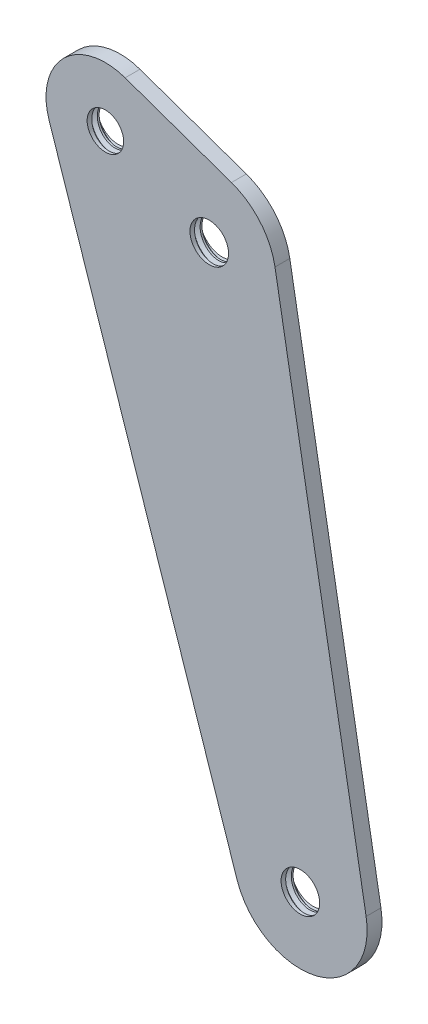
ISO-10303-21;
HEADER;
FILE_DESCRIPTION(('STEP AP214'),'2;1');
FILE_NAME('part.step','',(''),(''),'','','');
FILE_SCHEMA(('AUTOMOTIVE_DESIGN { 1 0 10303 214 1 1 1 1 }'));
ENDSEC;
DATA;
#1=APPLICATION_CONTEXT('core data for automotive mechanical design processes');
#2=APPLICATION_PROTOCOL_DEFINITION('international standard','automotive_design',2000,#1);
#3=PRODUCT_CONTEXT('',#1,'mechanical');
#4=PRODUCT('Part','Part','',(#3));
#5=PRODUCT_RELATED_PRODUCT_CATEGORY('part','',(#4));
#6=PRODUCT_DEFINITION_FORMATION('','',#4);
#7=PRODUCT_DEFINITION_CONTEXT('part definition',#1,'design');
#8=PRODUCT_DEFINITION('design','',#6,#7);
#9=PRODUCT_DEFINITION_SHAPE('','',#8);
#10=(LENGTH_UNIT() NAMED_UNIT(*) SI_UNIT(.MILLI.,.METRE.));
#11=(NAMED_UNIT(*) PLANE_ANGLE_UNIT() SI_UNIT($,.RADIAN.));
#12=(NAMED_UNIT(*) SI_UNIT($,.STERADIAN.) SOLID_ANGLE_UNIT());
#13=UNCERTAINTY_MEASURE_WITH_UNIT(LENGTH_MEASURE(1.E-05),#10,'distance_accuracy_value','');
#14=(GEOMETRIC_REPRESENTATION_CONTEXT(3) GLOBAL_UNCERTAINTY_ASSIGNED_CONTEXT((#13)) GLOBAL_UNIT_ASSIGNED_CONTEXT((#10,
#11,#12)) REPRESENTATION_CONTEXT('',''));
#15=CARTESIAN_POINT('',(0.,0.,0.));
#16=DIRECTION('',(0.,0.,1.));
#17=DIRECTION('',(1.,0.,0.));
#18=AXIS2_PLACEMENT_3D('',#15,#16,#17);
#19=CARTESIAN_POINT('',(-36.,-62.,4.2));
#20=DIRECTION('',(0.,0.,1.));
#21=DIRECTION('',(1.,0.,0.));
#22=AXIS2_PLACEMENT_3D('',#19,#20,#21);
#23=PLANE('',#22);
#24=CARTESIAN_POINT('',(-12.616542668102,-136.473038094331,4.2));
#25=CARTESIAN_POINT('',(-12.5757810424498,-136.395197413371,4.2));
#26=CARTESIAN_POINT('',(-12.5317230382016,-136.319083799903,4.2));
#27=CARTESIAN_POINT('',(-12.4373702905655,-136.170837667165,4.2));
#28=CARTESIAN_POINT('',(-12.3870762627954,-136.098704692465,4.2));
#29=CARTESIAN_POINT('',(-12.2804782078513,-135.958771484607,4.2));
#30=CARTESIAN_POINT('',(-12.2241609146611,-135.890981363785,4.2));
#31=CARTESIAN_POINT('',(-12.1059982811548,-135.760384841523,4.2));
#32=CARTESIAN_POINT('',(-12.0441527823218,-135.697578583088,4.2));
#33=CARTESIAN_POINT('',(-11.9475356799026,-135.607383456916,4.2));
#34=CARTESIAN_POINT('',(-11.9146465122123,-135.577954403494,4.2));
#35=CARTESIAN_POINT('',(-11.847647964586,-135.520539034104,4.2));
#36=CARTESIAN_POINT('',(-11.8135389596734,-135.492552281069,4.2));
#37=CARTESIAN_POINT('',(-11.7093459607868,-135.410977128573,4.2));
#38=CARTESIAN_POINT('',(-11.6373809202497,-135.35975964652,4.2));
#39=CARTESIAN_POINT('',(-11.4892434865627,-135.264128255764,4.2));
#40=CARTESIAN_POINT('',(-11.4130779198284,-135.219703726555,4.2));
#41=CARTESIAN_POINT('',(-11.2570221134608,-135.137932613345,4.2));
#42=CARTESIAN_POINT('',(-11.1771315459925,-135.100586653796,4.2));
#43=CARTESIAN_POINT('',(-11.0191384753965,-135.035288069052,4.2));
#44=CARTESIAN_POINT('',(-10.9412116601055,-135.006909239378,4.2));
#45=CARTESIAN_POINT('',(-10.7832226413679,-134.956900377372,4.2));
#46=CARTESIAN_POINT('',(-10.7031605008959,-134.93527014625,4.2));
#47=CARTESIAN_POINT('',(-10.5414067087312,-134.898899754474,4.2));
#48=CARTESIAN_POINT('',(-10.4597135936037,-134.88416610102,4.2));
#49=CARTESIAN_POINT('',(-10.2953600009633,-134.86172425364,4.2));
#50=CARTESIAN_POINT('',(-10.2126994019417,-134.854016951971,4.2));
#51=CARTESIAN_POINT('',(-10.0479556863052,-134.845734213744,4.2));
#52=CARTESIAN_POINT('',(-9.96587671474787,-134.84507855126,4.2));
#53=CARTESIAN_POINT('',(-9.84296113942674,-134.849285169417,4.2));
#54=CARTESIAN_POINT('',(-9.80202062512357,-134.851552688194,4.2));
#55=CARTESIAN_POINT('',(-9.72027216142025,-134.857813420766,4.2));
#56=CARTESIAN_POINT('',(-9.67946420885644,-134.861806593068,4.2));
#57=CARTESIAN_POINT('',(-9.55745155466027,-134.876580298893,4.2));
#58=CARTESIAN_POINT('',(-9.4765639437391,-134.890157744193,4.2));
#59=CARTESIAN_POINT('',(-9.31639097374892,-134.924583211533,4.2));
#60=CARTESIAN_POINT('',(-9.23710557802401,-134.94543106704,4.2));
#61=CARTESIAN_POINT('',(-9.00917706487,-135.016639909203,4.2));
#62=CARTESIAN_POINT('',(-8.86339619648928,-135.07655734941,4.2));
#63=CARTESIAN_POINT('',(-8.58451619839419,-135.22084222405,4.2));
#64=CARTESIAN_POINT('',(-8.45141725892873,-135.305210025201,4.2));
#65=CARTESIAN_POINT('',(-8.24334736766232,-135.464126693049,4.2));
#66=CARTESIAN_POINT('',(-8.1637246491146,-135.532672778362,4.2));
#67=CARTESIAN_POINT('',(-8.01314242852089,-135.678408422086,4.2));
#68=CARTESIAN_POINT('',(-7.94216561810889,-135.755580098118,4.2));
#69=CARTESIAN_POINT('',(-7.87591379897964,-135.836670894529,4.2));
#70=B_SPLINE_CURVE_WITH_KNOTS('',3,(#24,#25,#26,#27,#28,#29,#30,#31,#32,#33,#34,#35,#36,#37,#38,
#39,#40,#41,#42,#43,#44,#45,#46,#47,#48,#49,#50,#51,#52,#53,#54,#55,#56,#57,#58,#59,#60,#61,#62,
#63,#64,#65,#66,#67,#68,#69),.UNSPECIFIED.,.F.,.F.,(4,2,2,2,2,2,2,2,2,2,2,2,2,2,2,2,2,2,2,2,2,2,
4),(0.,0.26352396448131,0.52701771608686,0.791104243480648,1.0551983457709,1.1875650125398,
1.31989132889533,1.58448211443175,1.8486548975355,2.11285097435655,2.36135324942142,
2.60984820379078,2.85857715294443,3.10733768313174,3.35326505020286,3.47624360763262,
3.59921920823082,3.84488899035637,4.09055314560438,4.56082097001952,5.03109584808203,
5.34561345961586,5.65949070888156),.UNSPECIFIED.);
#71=CARTESIAN_POINT('',(-12.616542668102,-136.473038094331,4.2));
#72=VERTEX_POINT('',#71);
#73=CARTESIAN_POINT('',(-7.87591379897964,-135.836670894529,4.2));
#74=VERTEX_POINT('',#73);
#75=EDGE_CURVE('E275',#72,#74,#70,.T.);
#76=ORIENTED_EDGE('',*,*,#75,.F.);
#77=CARTESIAN_POINT('',(-12.6165426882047,-138.877258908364,4.2));
#78=CARTESIAN_POINT('',(-12.64847396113,-138.800195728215,4.20000000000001));
#79=CARTESIAN_POINT('',(-12.6773209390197,-138.721847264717,4.2));
#80=CARTESIAN_POINT('',(-12.7287607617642,-138.562901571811,4.2));
#81=CARTESIAN_POINT('',(-12.7513374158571,-138.482299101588,4.2));
#82=CARTESIAN_POINT('',(-12.7900110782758,-138.319461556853,4.2));
#83=CARTESIAN_POINT('',(-12.8060996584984,-138.237224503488,4.20000000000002));
#84=CARTESIAN_POINT('',(-12.8447410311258,-137.986867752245,4.20000000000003));
#85=CARTESIAN_POINT('',(-12.8570369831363,-137.817055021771,4.20000000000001));
#86=CARTESIAN_POINT('',(-12.8540323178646,-137.477723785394,4.19999999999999));
#87=CARTESIAN_POINT('',(-12.8387440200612,-137.308205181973,4.2));
#88=CARTESIAN_POINT('',(-12.8001300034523,-137.084284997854,4.2));
#89=CARTESIAN_POINT('',(-12.7887427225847,-137.027649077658,4.2));
#90=CARTESIAN_POINT('',(-12.7628757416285,-136.915136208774,4.2));
#91=CARTESIAN_POINT('',(-12.748399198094,-136.859258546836,4.2));
#92=CARTESIAN_POINT('',(-12.7161912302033,-136.747698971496,4.2));
#93=CARTESIAN_POINT('',(-12.6984215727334,-136.692028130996,4.2));
#94=CARTESIAN_POINT('',(-12.6597881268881,-136.581708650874,4.2));
#95=CARTESIAN_POINT('',(-12.6389212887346,-136.527061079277,4.2));
#96=CARTESIAN_POINT('',(-12.616542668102,-136.473038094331,4.2));
#97=B_SPLINE_CURVE_WITH_KNOTS('',3,(#77,#78,#79,#80,#81,#82,#83,#84,#85,#86,#87,#88,#89,#90,#91,
#92,#93,#94,#95,#96),.UNSPECIFIED.,.F.,.F.,(4,2,2,2,2,2,2,2,2,4),(0.,0.250198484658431,
0.501037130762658,0.752200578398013,1.26061318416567,1.76879878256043,1.94204752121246,
2.11512007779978,2.29034462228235,2.46574286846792),.UNSPECIFIED.);
#98=CARTESIAN_POINT('',(-12.6165426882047,-138.877258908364,4.2));
#99=VERTEX_POINT('',#98);
#100=EDGE_CURVE('E50',#99,#72,#97,.T.);
#101=ORIENTED_EDGE('',*,*,#100,.F.);
#102=CARTESIAN_POINT('',(-7.87591383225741,-139.513626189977,4.2));
#103=CARTESIAN_POINT('',(-7.92388464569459,-139.572320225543,4.2));
#104=CARTESIAN_POINT('',(-7.97431150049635,-139.628963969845,4.2));
#105=CARTESIAN_POINT('',(-8.07975242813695,-139.737805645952,4.2));
#106=CARTESIAN_POINT('',(-8.13476642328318,-139.790003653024,4.2));
#107=CARTESIAN_POINT('',(-8.30605381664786,-139.939282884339,4.2));
#108=CARTESIAN_POINT('',(-8.42870075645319,-140.029205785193,4.2));
#109=CARTESIAN_POINT('',(-8.68742817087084,-140.187178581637,4.2));
#110=CARTESIAN_POINT('',(-8.82351432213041,-140.255219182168,4.2));
#111=CARTESIAN_POINT('',(-9.03457070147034,-140.339385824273,4.2));
#112=CARTESIAN_POINT('',(-9.10608694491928,-140.364461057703,4.2));
#113=CARTESIAN_POINT('',(-9.25098179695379,-140.408507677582,4.2));
#114=CARTESIAN_POINT('',(-9.32436018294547,-140.427479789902,4.2));
#115=CARTESIAN_POINT('',(-9.47237089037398,-140.459183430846,4.2));
#116=CARTESIAN_POINT('',(-9.54700167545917,-140.471922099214,4.2));
#117=CARTESIAN_POINT('',(-9.65953761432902,-140.486258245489,4.2));
#118=CARTESIAN_POINT('',(-9.69715240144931,-140.490241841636,4.2));
#119=CARTESIAN_POINT('',(-9.77251624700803,-140.496716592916,4.2));
#120=CARTESIAN_POINT('',(-9.81026533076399,-140.499207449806,4.2));
#121=CARTESIAN_POINT('',(-9.92366611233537,-140.504479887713,4.2));
#122=CARTESIAN_POINT('',(-9.99943487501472,-140.505056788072,4.20000000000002));
#123=CARTESIAN_POINT('',(-10.1507820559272,-140.500306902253,4.19999999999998));
#124=CARTESIAN_POINT('',(-10.2263604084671,-140.494978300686,4.19999999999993));
#125=CARTESIAN_POINT('',(-10.4598231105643,-140.469309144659,4.19999999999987));
#126=CARTESIAN_POINT('',(-10.6167340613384,-140.438900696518,4.19999999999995));
#127=CARTESIAN_POINT('',(-10.9232196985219,-140.352939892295,4.20000000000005));
#128=CARTESIAN_POINT('',(-11.0728010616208,-140.297410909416,4.20000000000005));
#129=CARTESIAN_POINT('',(-11.3651032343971,-140.160704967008,4.20000000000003));
#130=CARTESIAN_POINT('',(-11.5075117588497,-140.078849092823,4.2));
#131=CARTESIAN_POINT('',(-11.6755349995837,-139.962495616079,4.2));
#132=CARTESIAN_POINT('',(-11.7087010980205,-139.938475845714,4.2));
#133=CARTESIAN_POINT('',(-11.7739916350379,-139.889058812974,4.2));
#134=CARTESIAN_POINT('',(-11.8061162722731,-139.863661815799,4.2));
#135=CARTESIAN_POINT('',(-11.8692847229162,-139.811550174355,4.2));
#136=CARTESIAN_POINT('',(-11.9003283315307,-139.784835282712,4.2));
#137=CARTESIAN_POINT('',(-11.9613588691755,-139.730224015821,4.2));
#138=CARTESIAN_POINT('',(-11.9913457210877,-139.702327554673,4.2));
#139=CARTESIAN_POINT('',(-12.0806566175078,-139.615902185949,4.2));
#140=CARTESIAN_POINT('',(-12.1382315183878,-139.555544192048,4.2));
#141=CARTESIAN_POINT('',(-12.2483711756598,-139.430442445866,4.2));
#142=CARTESIAN_POINT('',(-12.3009364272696,-139.36569912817,4.2));
#143=CARTESIAN_POINT('',(-12.4006241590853,-139.232362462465,4.2));
#144=CARTESIAN_POINT('',(-12.4477580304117,-139.163777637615,4.2));
#145=CARTESIAN_POINT('',(-12.5364264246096,-139.023063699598,4.2));
#146=CARTESIAN_POINT('',(-12.5779600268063,-138.950934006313,4.2));
#147=CARTESIAN_POINT('',(-12.6165426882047,-138.877258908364,4.2));
#148=B_SPLINE_CURVE_WITH_KNOTS('',3,(#102,#103,#104,#105,#106,#107,#108,#109,#110,#111,#112,
#113,#114,#115,#116,#117,#118,#119,#120,#121,#122,#123,#124,#125,#126,#127,#128,#129,#130,#131,
#132,#133,#134,#135,#136,#137,#138,#139,#140,#141,#142,#143,#144,#145,#146,#147),.UNSPECIFIED.,
.F.,.F.,(4,2,2,2,2,2,2,2,2,2,2,2,2,2,2,2,2,2,2,2,2,2,4),(0.,0.22727729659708,0.454550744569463,
0.908498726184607,1.36263927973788,1.58976767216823,1.81686904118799,2.04370967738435,
2.15715701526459,2.27062701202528,2.49767695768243,2.72479671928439,3.20191091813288,
3.67858210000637,4.16869118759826,4.29152662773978,4.41433849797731,4.53717350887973,
4.66001746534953,4.90996915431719,5.15989610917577,5.40928897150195,5.65872278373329),.UNSPECIFIED.);
#149=CARTESIAN_POINT('',(-7.87591383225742,-139.513626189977,4.2));
#150=VERTEX_POINT('',#149);
#151=EDGE_CURVE('E268',#150,#99,#148,.T.);
#152=ORIENTED_EDGE('',*,*,#151,.F.);
#153=CARTESIAN_POINT('',(-9.71439143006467,-137.675148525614,4.2));
#154=DIRECTION('',(0.,0.,1.));
#155=DIRECTION('',(1.,0.,0.));
#156=AXIS2_PLACEMENT_3D('',#153,#154,#155);
#157=CIRCLE('',#156,2.6);
#158=EDGE_CURVE('E491',#150,#74,#157,.T.);
#159=ORIENTED_EDGE('',*,*,#158,.T.);
#160=EDGE_LOOP('',(#76,#101,#152,#159));
#161=FACE_BOUND('',#160,.T.);
#162=CARTESIAN_POINT('',(-36.,-62.,4.2));
#163=DIRECTION('',(0.,0.,1.));
#164=DIRECTION('',(1.,0.,0.));
#165=AXIS2_PLACEMENT_3D('',#162,#163,#164);
#166=CIRCLE('',#165,8.);
#167=CARTESIAN_POINT('',(-33.3382032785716,-54.4558076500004,4.2));
#168=VERTEX_POINT('',#167);
#169=CARTESIAN_POINT('',(-43.5892726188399,-64.5304033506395,4.2));
#170=VERTEX_POINT('',#169);
#171=EDGE_CURVE('E435',#168,#170,#166,.T.);
#172=ORIENTED_EDGE('',*,*,#171,.F.);
#173=DIRECTION('',(-0.943024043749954,0.332724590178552,0.));
#174=VECTOR('',#173,1.);
#175=CARTESIAN_POINT('',(-19.005478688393,-59.5127836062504,4.2));
#176=LINE('',#175,#174);
#177=CARTESIAN_POINT('',(-19.005478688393,-59.5127836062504,4.2));
#178=VERTEX_POINT('',#177);
#179=EDGE_CURVE('E507',#178,#168,#176,.T.);
#180=ORIENTED_EDGE('',*,*,#179,.F.);
#181=CARTESIAN_POINT('',(-22.,-68.,4.2));
#182=DIRECTION('',(0.,0.,1.));
#183=DIRECTION('',(1.,0.,0.));
#184=AXIS2_PLACEMENT_3D('',#181,#182,#183);
#185=CIRCLE('',#184,9.00000000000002);
#186=CARTESIAN_POINT('',(-13.1367302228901,-66.4371664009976,4.2));
#187=VERTEX_POINT('',#186);
#188=EDGE_CURVE('E525',#187,#178,#185,.T.);
#189=ORIENTED_EDGE('',*,*,#188,.F.);
#190=DIRECTION('',(-0.17364817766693,0.984807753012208,0.));
#191=VECTOR('',#190,1.);
#192=CARTESIAN_POINT('',(-0.851121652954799,-136.112314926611,4.2));
#193=LINE('',#192,#191);
#194=CARTESIAN_POINT('',(-0.851121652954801,-136.112314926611,4.2));
#195=VERTEX_POINT('',#194);
#196=EDGE_CURVE('E523',#195,#187,#193,.T.);
#197=ORIENTED_EDGE('',*,*,#196,.F.);
#198=CARTESIAN_POINT('',(-9.71439143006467,-137.675148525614,4.2));
#199=DIRECTION('',(0.,0.,1.));
#200=DIRECTION('',(1.,0.,0.));
#201=AXIS2_PLACEMENT_3D('',#198,#199,#200);
#202=CIRCLE('',#201,9.);
#203=CARTESIAN_POINT('',(-18.2523231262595,-140.521852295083,4.2));
#204=VERTEX_POINT('',#203);
#205=EDGE_CURVE('E521',#204,#195,#202,.T.);
#206=ORIENTED_EDGE('',*,*,#205,.F.);
#207=DIRECTION('',(0.316300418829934,-0.948659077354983,0.));
#208=VECTOR('',#207,1.);
#209=CARTESIAN_POINT('',(-43.5892726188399,-64.5304033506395,4.2));
#210=LINE('',#209,#208);
#211=EDGE_CURVE('E519',#170,#204,#210,.T.);
#212=ORIENTED_EDGE('',*,*,#211,.F.);
#213=EDGE_LOOP('',(#172,#180,#189,#197,#206,#212));
#214=FACE_BOUND('',#213,.T.);
#215=CARTESIAN_POINT('',(-38.7728081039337,-60.8514652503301,4.2));
#216=CARTESIAN_POINT('',(-38.7335715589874,-60.7772903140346,4.2));
#217=CARTESIAN_POINT('',(-38.6911940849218,-60.7047777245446,4.2));
#218=CARTESIAN_POINT('',(-38.6004994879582,-60.5635792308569,4.2));
#219=CARTESIAN_POINT('',(-38.5521830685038,-60.4948928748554,4.2));
#220=CARTESIAN_POINT('',(-38.4498205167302,-60.3616711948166,4.2));
#221=CARTESIAN_POINT('',(-38.3957608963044,-60.2971462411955,4.2));
#222=CARTESIAN_POINT('',(-38.2823807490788,-60.1728788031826,4.2));
#223=CARTESIAN_POINT('',(-38.223060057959,-60.1131364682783,4.2));
#224=CARTESIAN_POINT('',(-38.1304119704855,-60.0273654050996,4.2));
#225=CARTESIAN_POINT('',(-38.0988739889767,-59.999381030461,4.2));
#226=CARTESIAN_POINT('',(-38.0346369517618,-59.9447968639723,4.2));
#227=CARTESIAN_POINT('',(-38.0019382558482,-59.9181966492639,4.2));
#228=CARTESIAN_POINT('',(-37.902062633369,-59.8406916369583,4.2));
#229=CARTESIAN_POINT('',(-37.8330912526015,-59.7920685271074,4.2));
#230=CARTESIAN_POINT('',(-37.6911497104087,-59.7013670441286,4.2));
#231=CARTESIAN_POINT('',(-37.6181863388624,-59.6592779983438,4.2));
#232=CARTESIAN_POINT('',(-37.4687215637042,-59.5819038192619,4.2));
#233=CARTESIAN_POINT('',(-37.3922198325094,-59.546619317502,4.2));
#234=CARTESIAN_POINT('',(-37.2411887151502,-59.4851335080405,4.2));
#235=CARTESIAN_POINT('',(-37.1668334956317,-59.458503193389,4.2));
#236=CARTESIAN_POINT('',(-37.0161226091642,-59.4116847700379,4.2));
#237=CARTESIAN_POINT('',(-36.9397670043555,-59.391496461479,4.2));
#238=CARTESIAN_POINT('',(-36.785535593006,-59.3576937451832,4.2));
#239=CARTESIAN_POINT('',(-36.7076583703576,-59.34408579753,4.2));
#240=CARTESIAN_POINT('',(-36.5510180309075,-59.3235704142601,4.2));
#241=CARTESIAN_POINT('',(-36.4722547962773,-59.3166638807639,4.2));
#242=CARTESIAN_POINT('',(-36.3153640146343,-59.3096474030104,4.2));
#243=CARTESIAN_POINT('',(-36.2372401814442,-59.3094568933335,4.2));
#244=CARTESIAN_POINT('',(-36.1202750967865,-59.3141089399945,4.2));
#245=CARTESIAN_POINT('',(-36.0813212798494,-59.316482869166,4.2));
#246=CARTESIAN_POINT('',(-36.0035491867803,-59.3228747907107,4.2));
#247=CARTESIAN_POINT('',(-35.9647309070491,-59.3268927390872,4.2));
#248=CARTESIAN_POINT('',(-35.8486874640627,-59.3416155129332,4.2));
#249=CARTESIAN_POINT('',(-35.7717806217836,-59.3549924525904,4.2));
#250=CARTESIAN_POINT('',(-35.6195398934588,-59.3886827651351,4.2));
#251=CARTESIAN_POINT('',(-35.5442059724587,-59.4089959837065,4.2));
#252=CARTESIAN_POINT('',(-35.3280635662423,-59.4780532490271,4.20000000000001));
#253=CARTESIAN_POINT('',(-35.1900305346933,-59.5358511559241,4.2));
#254=CARTESIAN_POINT('',(-34.9261804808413,-59.6746212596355,4.2));
#255=CARTESIAN_POINT('',(-34.8003637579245,-59.7555940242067,4.2));
#256=CARTESIAN_POINT('',(-34.6044899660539,-59.9073938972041,4.2));
#257=CARTESIAN_POINT('',(-34.5299119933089,-59.972472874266,4.2));
#258=CARTESIAN_POINT('',(-34.3889248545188,-60.1106701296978,4.2));
#259=CARTESIAN_POINT('',(-34.32249901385,-60.1837713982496,4.2));
#260=CARTESIAN_POINT('',(-34.2605173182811,-60.2605173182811,4.2));
#261=B_SPLINE_CURVE_WITH_KNOTS('',3,(#215,#216,#217,#218,#219,#220,#221,#222,#223,#224,#225,
#226,#227,#228,#229,#230,#231,#232,#233,#234,#235,#236,#237,#238,#239,#240,#241,#242,#243,#244,
#245,#246,#247,#248,#249,#250,#251,#252,#253,#254,#255,#256,#257,#258,#259,#260),.UNSPECIFIED.,
.F.,.F.,(4,2,2,2,2,2,2,2,2,2,2,2,2,2,2,2,2,2,2,2,2,2,4),(0.,0.251664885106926,0.503299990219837,
0.755539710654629,1.00778731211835,1.13424576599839,1.26066535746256,1.51344350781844,
1.76580432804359,2.01818855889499,2.25484530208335,2.49149470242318,2.72837595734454,
2.96528909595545,3.19935924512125,3.31640777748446,3.43345317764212,3.66726562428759,
3.90107286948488,4.34755748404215,4.79405303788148,5.09036913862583,5.38606866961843),.UNSPECIFIED.);
#262=CARTESIAN_POINT('',(-38.7728081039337,-60.8514652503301,4.2));
#263=VERTEX_POINT('',#262);
#264=CARTESIAN_POINT('',(-34.2605173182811,-60.2605173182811,4.2));
#265=VERTEX_POINT('',#264);
#266=EDGE_CURVE('E337',#263,#265,#261,.T.);
#267=ORIENTED_EDGE('',*,*,#266,.F.);
#268=CARTESIAN_POINT('',(-38.7728081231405,-63.1485347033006,4.2));
#269=CARTESIAN_POINT('',(-38.8047438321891,-63.071464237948,4.20000000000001));
#270=CARTESIAN_POINT('',(-38.8334491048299,-62.9930478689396,4.20000000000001));
#271=CARTESIAN_POINT('',(-38.8841385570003,-62.8344036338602,4.2));
#272=CARTESIAN_POINT('',(-38.9061481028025,-62.7541838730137,4.19999999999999));
#273=CARTESIAN_POINT('',(-38.9434599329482,-62.592097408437,4.20000000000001));
#274=CARTESIAN_POINT('',(-38.9587526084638,-62.5102285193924,4.20000000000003));
#275=CARTESIAN_POINT('',(-38.9946568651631,-62.2608476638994,4.20000000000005));
#276=CARTESIAN_POINT('',(-39.0046156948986,-62.0916843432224,4.20000000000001));
#277=CARTESIAN_POINT('',(-38.9959363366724,-61.7541639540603,4.19999999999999));
#278=CARTESIAN_POINT('',(-38.9773163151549,-61.5858064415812,4.2));
#279=CARTESIAN_POINT('',(-38.935233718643,-61.3719456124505,4.2));
#280=CARTESIAN_POINT('',(-38.924498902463,-61.323726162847,4.2));
#281=CARTESIAN_POINT('',(-38.9006741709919,-61.2279140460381,4.2));
#282=CARTESIAN_POINT('',(-38.8875866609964,-61.1803207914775,4.2));
#283=CARTESIAN_POINT('',(-38.8589395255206,-61.0853711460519,4.2));
#284=CARTESIAN_POINT('',(-38.843356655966,-61.0380217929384,4.2));
#285=CARTESIAN_POINT('',(-38.8098370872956,-60.944111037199,4.2));
#286=CARTESIAN_POINT('',(-38.7918980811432,-60.8975504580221,4.2));
#287=CARTESIAN_POINT('',(-38.7728081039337,-60.8514652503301,4.2));
#288=B_SPLINE_CURVE_WITH_KNOTS('',3,(#268,#269,#270,#271,#272,#273,#274,#275,#276,#277,#278,
#279,#280,#281,#282,#283,#284,#285,#286,#287),.UNSPECIFIED.,.F.,.F.,(4,2,2,2,2,2,2,2,2,4),(0.,
0.25021749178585,0.499474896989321,0.749087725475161,1.25491550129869,1.76042187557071,
1.90858593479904,2.05659936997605,2.20608167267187,2.35571144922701),.UNSPECIFIED.);
#289=CARTESIAN_POINT('',(-38.7728081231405,-63.1485347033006,4.2));
#290=VERTEX_POINT('',#289);
#291=EDGE_CURVE('E387',#290,#263,#288,.T.);
#292=ORIENTED_EDGE('',*,*,#291,.F.);
#293=CARTESIAN_POINT('',(-34.260517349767,-63.7394827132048,4.2));
#294=CARTESIAN_POINT('',(-34.3056641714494,-63.7953640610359,4.2));
#295=CARTESIAN_POINT('',(-34.3531493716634,-63.8493157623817,4.2));
#296=CARTESIAN_POINT('',(-34.4524907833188,-63.953030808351,4.2));
#297=CARTESIAN_POINT('',(-34.5043469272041,-64.0027942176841,4.2));
#298=CARTESIAN_POINT('',(-34.6658747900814,-64.145187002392,4.2));
#299=CARTESIAN_POINT('',(-34.7816253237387,-64.2310664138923,4.2));
#300=CARTESIAN_POINT('',(-35.0259782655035,-64.3821707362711,4.2));
#301=CARTESIAN_POINT('',(-35.1545864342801,-64.4473863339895,4.2));
#302=CARTESIAN_POINT('',(-35.3541571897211,-64.5282873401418,4.2));
#303=CARTESIAN_POINT('',(-35.4217988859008,-64.5524357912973,4.2));
#304=CARTESIAN_POINT('',(-35.5588809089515,-64.5949619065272,4.2));
#305=CARTESIAN_POINT('',(-35.6283210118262,-64.6133402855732,4.2));
#306=CARTESIAN_POINT('',(-35.7684204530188,-64.6441808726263,4.2));
#307=CARTESIAN_POINT('',(-35.8390783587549,-64.6566495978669,4.2));
#308=CARTESIAN_POINT('',(-35.9811931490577,-64.6756042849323,4.2));
#309=CARTESIAN_POINT('',(-36.0526501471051,-64.6820893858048,4.2));
#310=CARTESIAN_POINT('',(-36.1959184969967,-64.6895679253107,4.2));
#311=CARTESIAN_POINT('',(-36.2677301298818,-64.6905559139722,4.20000000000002));
#312=CARTESIAN_POINT('',(-36.4111965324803,-64.6869449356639,4.19999999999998));
#313=CARTESIAN_POINT('',(-36.482851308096,-64.6823461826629,4.19999999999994));
#314=CARTESIAN_POINT('',(-36.7046266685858,-64.6594211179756,4.19999999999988));
#315=CARTESIAN_POINT('',(-36.8538684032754,-64.6315369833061,4.19999999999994));
#316=CARTESIAN_POINT('',(-37.1456473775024,-64.5518108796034,4.20000000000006));
#317=CARTESIAN_POINT('',(-37.2881909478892,-64.4999920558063,4.20000000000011));
#318=CARTESIAN_POINT('',(-37.4962153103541,-64.4045154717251,4.20000000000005));
#319=CARTESIAN_POINT('',(-37.5655688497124,-64.3690700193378,4.20000000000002));
#320=CARTESIAN_POINT('',(-37.7010610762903,-64.2924752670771,4.19999999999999));
#321=CARTESIAN_POINT('',(-37.767200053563,-64.2513264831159,4.2));
#322=CARTESIAN_POINT('',(-37.8958785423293,-64.1635454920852,4.2));
#323=CARTESIAN_POINT('',(-37.9584127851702,-64.116905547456,4.2));
#324=CARTESIAN_POINT('',(-38.0491101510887,-64.0431547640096,4.2));
#325=CARTESIAN_POINT('',(-38.0788301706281,-64.0179346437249,4.2));
#326=CARTESIAN_POINT('',(-38.1372766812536,-63.9663676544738,4.2));
#327=CARTESIAN_POINT('',(-38.1660031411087,-63.9400207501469,4.2));
#328=CARTESIAN_POINT('',(-38.2523293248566,-63.8576706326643,4.2));
#329=CARTESIAN_POINT('',(-38.3082259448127,-63.7998610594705,4.2));
#330=CARTESIAN_POINT('',(-38.415172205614,-63.6799427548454,4.2));
#331=CARTESIAN_POINT('',(-38.4662222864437,-63.6178344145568,4.2));
#332=CARTESIAN_POINT('',(-38.5630457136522,-63.4898436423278,4.2));
#333=CARTESIAN_POINT('',(-38.6088303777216,-63.4239697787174,4.2));
#334=CARTESIAN_POINT('',(-38.6949682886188,-63.2887477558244,4.2));
#335=CARTESIAN_POINT('',(-38.7353206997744,-63.2193990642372,4.2));
#336=CARTESIAN_POINT('',(-38.7728081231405,-63.1485347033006,4.2));
#337=B_SPLINE_CURVE_WITH_KNOTS('',3,(#293,#294,#295,#296,#297,#298,#299,#300,#301,#302,#303,
#304,#305,#306,#307,#308,#309,#310,#311,#312,#313,#314,#315,#316,#317,#318,#319,#320,#321,#322,
#323,#324,#325,#326,#327,#328,#329,#330,#331,#332,#333,#334,#335,#336),.UNSPECIFIED.,.F.,.F.,(4,
2,2,2,2,2,2,2,2,2,2,2,2,2,2,2,2,2,2,2,2,4),(0.,0.21539300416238,0.430782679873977,
0.861000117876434,1.29141117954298,1.50666743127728,1.72189700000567,1.93688865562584,
2.15191124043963,2.36714696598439,2.58237444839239,3.0356740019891,3.48853612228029,
3.7219609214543,3.95536461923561,4.1891012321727,4.3060101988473,4.42292283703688,
4.66387853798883,4.90481234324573,5.14521819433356,5.38566098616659),.UNSPECIFIED.);
#338=CARTESIAN_POINT('',(-34.2605173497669,-63.7394827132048,4.2));
#339=VERTEX_POINT('',#338);
#340=EDGE_CURVE('E325',#339,#290,#337,.T.);
#341=ORIENTED_EDGE('',*,*,#340,.F.);
#342=CARTESIAN_POINT('',(-36.,-62.,4.2));
#343=DIRECTION('',(0.,0.,1.));
#344=DIRECTION('',(1.,0.,0.));
#345=AXIS2_PLACEMENT_3D('',#342,#343,#344);
#346=CIRCLE('',#345,2.46);
#347=EDGE_CURVE('E497',#339,#265,#346,.T.);
#348=ORIENTED_EDGE('',*,*,#347,.T.);
#349=EDGE_LOOP('',(#267,#292,#341,#348));
#350=FACE_BOUND('',#349,.T.);
#351=CARTESIAN_POINT('',(-24.9021512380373,-66.7978895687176,4.2));
#352=CARTESIAN_POINT('',(-24.8613896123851,-66.7200488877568,4.2));
#353=CARTESIAN_POINT('',(-24.817331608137,-66.6439352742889,4.2));
#354=CARTESIAN_POINT('',(-24.7229788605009,-66.495689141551,4.2));
#355=CARTESIAN_POINT('',(-24.6726848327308,-66.4235561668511,4.2));
#356=CARTESIAN_POINT('',(-24.5660867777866,-66.2836229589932,4.2));
#357=CARTESIAN_POINT('',(-24.5097694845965,-66.2158328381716,4.2));
#358=CARTESIAN_POINT('',(-24.3916068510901,-66.0852363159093,4.2));
#359=CARTESIAN_POINT('',(-24.3297613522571,-66.0224300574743,4.2));
#360=CARTESIAN_POINT('',(-24.2331442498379,-65.9322349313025,4.2));
#361=CARTESIAN_POINT('',(-24.2002550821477,-65.9028058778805,4.2));
#362=CARTESIAN_POINT('',(-24.1332565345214,-65.84539050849,4.2));
#363=CARTESIAN_POINT('',(-24.0991475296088,-65.8174037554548,4.2));
#364=CARTESIAN_POINT('',(-23.9949545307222,-65.7358286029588,4.2));
#365=CARTESIAN_POINT('',(-23.9229894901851,-65.6846111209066,4.2));
#366=CARTESIAN_POINT('',(-23.7748520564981,-65.5889797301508,4.2));
#367=CARTESIAN_POINT('',(-23.6986864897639,-65.5445552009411,4.2));
#368=CARTESIAN_POINT('',(-23.5426306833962,-65.4627840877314,4.2));
#369=CARTESIAN_POINT('',(-23.462740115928,-65.4254381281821,4.2));
#370=CARTESIAN_POINT('',(-23.3047470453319,-65.3601395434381,4.2));
#371=CARTESIAN_POINT('',(-23.226820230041,-65.3317607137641,4.2));
#372=CARTESIAN_POINT('',(-23.0688312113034,-65.2817518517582,4.2));
#373=CARTESIAN_POINT('',(-22.9887690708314,-65.2601216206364,4.2));
#374=CARTESIAN_POINT('',(-22.8270152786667,-65.2237512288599,4.2));
#375=CARTESIAN_POINT('',(-22.7453221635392,-65.2090175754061,4.2));
#376=CARTESIAN_POINT('',(-22.5809685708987,-65.1865757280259,4.2));
#377=CARTESIAN_POINT('',(-22.4983079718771,-65.1788684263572,4.2));
#378=CARTESIAN_POINT('',(-22.3335642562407,-65.1705856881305,4.2));
#379=CARTESIAN_POINT('',(-22.2514852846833,-65.1699300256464,4.2));
#380=CARTESIAN_POINT('',(-22.1285697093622,-65.1741366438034,4.2));
#381=CARTESIAN_POINT('',(-22.087629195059,-65.1764041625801,4.2));
#382=CARTESIAN_POINT('',(-22.0058807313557,-65.1826648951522,4.2));
#383=CARTESIAN_POINT('',(-21.9650727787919,-65.1866580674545,4.2));
#384=CARTESIAN_POINT('',(-21.8430601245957,-65.2014317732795,4.2));
#385=CARTESIAN_POINT('',(-21.7621725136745,-65.215009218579,4.2));
#386=CARTESIAN_POINT('',(-21.6019995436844,-65.2494346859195,4.2));
#387=CARTESIAN_POINT('',(-21.5227141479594,-65.2702825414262,4.2));
#388=CARTESIAN_POINT('',(-21.2947856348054,-65.3414913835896,4.2));
#389=CARTESIAN_POINT('',(-21.1490047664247,-65.4014088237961,4.2));
#390=CARTESIAN_POINT('',(-20.8701247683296,-65.5456936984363,4.2));
#391=CARTESIAN_POINT('',(-20.7370258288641,-65.6300614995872,4.2));
#392=CARTESIAN_POINT('',(-20.5289559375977,-65.7889781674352,4.2));
#393=CARTESIAN_POINT('',(-20.44933321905,-65.8575242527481,4.2));
#394=CARTESIAN_POINT('',(-20.2987509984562,-66.0032598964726,4.2));
#395=CARTESIAN_POINT('',(-20.2277741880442,-66.0804315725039,4.2));
#396=CARTESIAN_POINT('',(-20.161522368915,-66.161522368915,4.2));
#397=B_SPLINE_CURVE_WITH_KNOTS('',3,(#351,#352,#353,#354,#355,#356,#357,#358,#359,#360,#361,
#362,#363,#364,#365,#366,#367,#368,#369,#370,#371,#372,#373,#374,#375,#376,#377,#378,#379,#380,
#381,#382,#383,#384,#385,#386,#387,#388,#389,#390,#391,#392,#393,#394,#395,#396),.UNSPECIFIED.,
.F.,.F.,(4,2,2,2,2,2,2,2,2,2,2,2,2,2,2,2,2,2,2,2,2,2,4),(0.,0.263523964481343,0.527017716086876,
0.791104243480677,1.0551983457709,1.1875650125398,1.31989132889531,1.58448211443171,
1.84865489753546,2.11285097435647,2.36135324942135,2.60984820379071,2.85857715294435,
3.10733768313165,3.35326505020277,3.47624360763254,3.59921920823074,3.8448889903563,
4.09055314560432,4.56082097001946,5.03109584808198,5.34561345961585,5.65949070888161),.UNSPECIFIED.);
#398=CARTESIAN_POINT('',(-24.9021512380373,-66.7978895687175,4.2));
#399=VERTEX_POINT('',#398);
#400=CARTESIAN_POINT('',(-20.161522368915,-66.161522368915,4.2));
#401=VERTEX_POINT('',#400);
#402=EDGE_CURVE('E188',#399,#401,#397,.T.);
#403=ORIENTED_EDGE('',*,*,#402,.F.);
#404=CARTESIAN_POINT('',(-24.9021512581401,-69.2021103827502,4.2));
#405=CARTESIAN_POINT('',(-24.9340825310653,-69.1250472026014,4.2));
#406=CARTESIAN_POINT('',(-24.9629295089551,-69.0466987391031,4.2));
#407=CARTESIAN_POINT('',(-25.0143693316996,-68.8877530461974,4.2));
#408=CARTESIAN_POINT('',(-25.0369459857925,-68.807150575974,4.2));
#409=CARTESIAN_POINT('',(-25.0756196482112,-68.6443130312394,4.2));
#410=CARTESIAN_POINT('',(-25.0917082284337,-68.5620759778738,4.20000000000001));
#411=CARTESIAN_POINT('',(-25.1303496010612,-68.3117192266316,4.20000000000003));
#412=CARTESIAN_POINT('',(-25.1426455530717,-68.1419064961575,4.20000000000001));
#413=CARTESIAN_POINT('',(-25.1396408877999,-67.80257525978,4.19999999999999));
#414=CARTESIAN_POINT('',(-25.1243525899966,-67.6330566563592,4.2));
#415=CARTESIAN_POINT('',(-25.0857385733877,-67.4091364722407,4.2));
#416=CARTESIAN_POINT('',(-25.07435129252,-67.3525005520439,4.2));
#417=CARTESIAN_POINT('',(-25.0484843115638,-67.2399876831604,4.2));
#418=CARTESIAN_POINT('',(-25.0340077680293,-67.1841100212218,4.2));
#419=CARTESIAN_POINT('',(-25.0017998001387,-67.072550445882,4.2));
#420=CARTESIAN_POINT('',(-24.9840301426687,-67.0168796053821,4.2));
#421=CARTESIAN_POINT('',(-24.9453966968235,-66.9065601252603,4.2));
#422=CARTESIAN_POINT('',(-24.9245298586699,-66.8519125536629,4.2));
#423=CARTESIAN_POINT('',(-24.9021512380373,-66.7978895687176,4.2));
#424=B_SPLINE_CURVE_WITH_KNOTS('',3,(#404,#405,#406,#407,#408,#409,#410,#411,#412,#413,#414,
#415,#416,#417,#418,#419,#420,#421,#422,#423),.UNSPECIFIED.,.F.,.F.,(4,2,2,2,2,2,2,2,2,4),(0.,
0.250198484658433,0.501037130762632,0.752200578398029,1.26061318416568,1.76879878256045,
1.94204752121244,2.11512007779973,2.2903446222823,2.4657428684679),.UNSPECIFIED.);
#425=CARTESIAN_POINT('',(-24.9021512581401,-69.2021103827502,4.2));
#426=VERTEX_POINT('',#425);
#427=EDGE_CURVE('E11',#426,#399,#424,.T.);
#428=ORIENTED_EDGE('',*,*,#427,.F.);
#429=CARTESIAN_POINT('',(-20.1615224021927,-69.8384776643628,4.2));
#430=CARTESIAN_POINT('',(-20.2094932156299,-69.897171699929,4.2));
#431=CARTESIAN_POINT('',(-20.2599200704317,-69.9538154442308,4.2));
#432=CARTESIAN_POINT('',(-20.3653609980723,-70.0626571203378,4.2));
#433=CARTESIAN_POINT('',(-20.4203749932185,-70.1148551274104,4.2));
#434=CARTESIAN_POINT('',(-20.5916623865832,-70.264134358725,4.2));
#435=CARTESIAN_POINT('',(-20.7143093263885,-70.3540572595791,4.2));
#436=CARTESIAN_POINT('',(-20.9730367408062,-70.5120300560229,4.2));
#437=CARTESIAN_POINT('',(-21.1091228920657,-70.5800706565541,4.2));
#438=CARTESIAN_POINT('',(-21.3201792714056,-70.6642372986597,4.2));
#439=CARTESIAN_POINT('',(-21.3916955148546,-70.6893125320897,4.2));
#440=CARTESIAN_POINT('',(-21.5365903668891,-70.7333591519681,4.2));
#441=CARTESIAN_POINT('',(-21.6099687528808,-70.7523312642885,4.2));
#442=CARTESIAN_POINT('',(-21.7579794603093,-70.7840349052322,4.2));
#443=CARTESIAN_POINT('',(-21.8326102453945,-70.7967735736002,4.2));
#444=CARTESIAN_POINT('',(-21.9451461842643,-70.8111097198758,4.2));
#445=CARTESIAN_POINT('',(-21.9827609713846,-70.815093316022,4.2));
#446=CARTESIAN_POINT('',(-22.0581248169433,-70.8215680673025,4.2));
#447=CARTESIAN_POINT('',(-22.0958739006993,-70.8240589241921,4.2));
#448=CARTESIAN_POINT('',(-22.2092746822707,-70.829331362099,4.2));
#449=CARTESIAN_POINT('',(-22.28504344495,-70.8299082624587,4.20000000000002));
#450=CARTESIAN_POINT('',(-22.4363906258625,-70.8251583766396,4.19999999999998));
#451=CARTESIAN_POINT('',(-22.5119689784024,-70.8198297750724,4.19999999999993));
#452=CARTESIAN_POINT('',(-22.7454316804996,-70.7941606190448,4.19999999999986));
#453=CARTESIAN_POINT('',(-22.9023426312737,-70.7637521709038,4.19999999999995));
#454=CARTESIAN_POINT('',(-23.2088282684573,-70.6777913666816,4.20000000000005));
#455=CARTESIAN_POINT('',(-23.3584096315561,-70.6222623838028,4.20000000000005));
#456=CARTESIAN_POINT('',(-23.6507118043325,-70.4855564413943,4.20000000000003));
#457=CARTESIAN_POINT('',(-23.793120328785,-70.4037005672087,4.2));
#458=CARTESIAN_POINT('',(-23.9611435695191,-70.2873470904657,4.2));
#459=CARTESIAN_POINT('',(-23.9943096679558,-70.2633273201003,4.2));
#460=CARTESIAN_POINT('',(-24.0596002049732,-70.21391028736,4.2));
#461=CARTESIAN_POINT('',(-24.0917248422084,-70.1885132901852,4.2));
#462=CARTESIAN_POINT('',(-24.1548932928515,-70.1364016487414,4.2));
#463=CARTESIAN_POINT('',(-24.185936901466,-70.109686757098,4.2));
#464=CARTESIAN_POINT('',(-24.2469674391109,-70.0550754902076,4.2));
#465=CARTESIAN_POINT('',(-24.276954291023,-70.0271790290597,4.2));
#466=CARTESIAN_POINT('',(-24.3662651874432,-69.9407536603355,4.2));
#467=CARTESIAN_POINT('',(-24.4238400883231,-69.8803956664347,4.2));
#468=CARTESIAN_POINT('',(-24.5339797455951,-69.7552939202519,4.2));
#469=CARTESIAN_POINT('',(-24.5865449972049,-69.6905506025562,4.2));
#470=CARTESIAN_POINT('',(-24.6862327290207,-69.557213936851,4.2));
#471=CARTESIAN_POINT('',(-24.7333666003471,-69.4886291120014,4.2));
#472=CARTESIAN_POINT('',(-24.8220349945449,-69.3479151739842,4.2));
#473=CARTESIAN_POINT('',(-24.8635685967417,-69.2757854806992,4.2));
#474=CARTESIAN_POINT('',(-24.9021512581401,-69.2021103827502,4.2));
#475=B_SPLINE_CURVE_WITH_KNOTS('',3,(#429,#430,#431,#432,#433,#434,#435,#436,#437,#438,#439,
#440,#441,#442,#443,#444,#445,#446,#447,#448,#449,#450,#451,#452,#453,#454,#455,#456,#457,#458,
#459,#460,#461,#462,#463,#464,#465,#466,#467,#468,#469,#470,#471,#472,#473,#474),.UNSPECIFIED.,
.F.,.F.,(4,2,2,2,2,2,2,2,2,2,2,2,2,2,2,2,2,2,2,2,2,2,4),(0.,0.227277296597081,0.454550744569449,
0.908498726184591,1.36263927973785,1.58976767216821,1.81686904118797,2.04370967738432,
2.15715701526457,2.27062701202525,2.4976769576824,2.72479671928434,3.20191091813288,
3.67858210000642,4.16869118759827,4.29152662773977,4.4143384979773,4.5371735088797,
4.6600174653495,4.90996915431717,5.15989610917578,5.40928897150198,5.65872278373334),.UNSPECIFIED.);
#476=CARTESIAN_POINT('',(-20.1615224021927,-69.8384776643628,4.2));
#477=VERTEX_POINT('',#476);
#478=EDGE_CURVE('E179',#477,#426,#475,.T.);
#479=ORIENTED_EDGE('',*,*,#478,.F.);
#480=CARTESIAN_POINT('',(-22.,-68.,4.2));
#481=DIRECTION('',(0.,0.,1.));
#482=DIRECTION('',(1.,0.,0.));
#483=AXIS2_PLACEMENT_3D('',#480,#481,#482);
#484=CIRCLE('',#483,2.60000000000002);
#485=EDGE_CURVE('E443',#477,#401,#484,.T.);
#486=ORIENTED_EDGE('',*,*,#485,.T.);
#487=EDGE_LOOP('',(#403,#428,#479,#486));
#488=FACE_BOUND('',#487,.T.);
#489=ADVANCED_FACE('F36',(#161,#214,#350,#488),#23,.F.);
#490=CARTESIAN_POINT('',(-22.,-68.,6.2));
#491=DIRECTION('',(0.,0.,-1.));
#492=DIRECTION('',(-1.,0.,0.));
#493=AXIS2_PLACEMENT_3D('',#490,#491,#492);
#494=CYLINDRICAL_SURFACE('',#493,2.60000000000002);
#495=CARTESIAN_POINT('',(-22.,-68.,6.2));
#496=DIRECTION('',(0.,0.,1.));
#497=DIRECTION('',(1.,0.,0.));
#498=AXIS2_PLACEMENT_3D('',#495,#496,#497);
#499=CIRCLE('',#498,2.60000000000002);
#500=CARTESIAN_POINT('',(-20.161522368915,-66.161522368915,6.2));
#501=VERTEX_POINT('',#500);
#502=EDGE_CURVE('E494',#501,#501,#499,.T.);
#503=ORIENTED_EDGE('',*,*,#502,.T.);
#504=CARTESIAN_POINT('',(-20.161522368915,-66.161522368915,6.2));
#505=CARTESIAN_POINT('',(-19.4,-66.92304473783,6.1375));
#506=CARTESIAN_POINT('',(-19.4,-68.,6.075));
#507=CARTESIAN_POINT('',(-19.4,-69.0769552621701,6.0125));
#508=CARTESIAN_POINT('',(-20.161522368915,-69.8384776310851,5.95));
#509=CARTESIAN_POINT('',(-20.92304473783,-70.6,5.8875));
#510=CARTESIAN_POINT('',(-22.,-70.6,5.825));
#511=CARTESIAN_POINT('',(-23.0769552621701,-70.6,5.7625));
#512=CARTESIAN_POINT('',(-23.838477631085,-69.8384776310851,5.7));
#513=CARTESIAN_POINT('',(-24.6,-69.0769552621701,5.6375));
#514=CARTESIAN_POINT('',(-24.6,-68.,5.575));
#515=CARTESIAN_POINT('',(-24.6,-66.92304473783,5.5125));
#516=CARTESIAN_POINT('',(-23.838477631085,-66.161522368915,5.45));
#517=CARTESIAN_POINT('',(-23.0769552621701,-65.4,5.3875));
#518=CARTESIAN_POINT('',(-22.,-65.4,5.325));
#519=CARTESIAN_POINT('',(-20.92304473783,-65.4,5.2625));
#520=CARTESIAN_POINT('',(-20.161522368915,-66.161522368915,5.2));
#521=CARTESIAN_POINT('',(-19.4,-66.92304473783,5.1375));
#522=CARTESIAN_POINT('',(-19.4,-68.,5.075));
#523=CARTESIAN_POINT('',(-19.4,-69.0769552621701,5.0125));
#524=CARTESIAN_POINT('',(-20.161522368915,-69.8384776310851,4.95));
#525=CARTESIAN_POINT('',(-20.92304473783,-70.6,4.8875));
#526=CARTESIAN_POINT('',(-22.,-70.6,4.825));
#527=CARTESIAN_POINT('',(-23.0769552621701,-70.6,4.7625));
#528=CARTESIAN_POINT('',(-23.838477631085,-69.8384776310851,4.7));
#529=CARTESIAN_POINT('',(-24.6,-69.0769552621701,4.6375));
#530=CARTESIAN_POINT('',(-24.6,-68.,4.575));
#531=CARTESIAN_POINT('',(-24.6,-66.92304473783,4.5125));
#532=CARTESIAN_POINT('',(-23.838477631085,-66.161522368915,4.45));
#533=CARTESIAN_POINT('',(-23.0769552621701,-65.4,4.3875));
#534=CARTESIAN_POINT('',(-22.,-65.4,4.325));
#535=CARTESIAN_POINT('',(-20.92304473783,-65.4,4.2625));
#536=CARTESIAN_POINT('',(-20.161522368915,-66.161522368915,4.2));
#537=(BOUNDED_CURVE() B_SPLINE_CURVE(2,(#504,#505,#506,#507,#508,#509,#510,#511,#512,#513,#514,
#515,#516,#517,#518,#519,#520,#521,#522,#523,#524,#525,#526,#527,#528,#529,#530,#531,#532,#533,
#534,#535,#536),.UNSPECIFIED.,.F.,.F.) B_SPLINE_CURVE_WITH_KNOTS((3,2,2,2,2,2,2,2,2,2,2,2,2,2,2,
2,3),(0.,0.0625,0.125,0.1875,0.25,0.3125,0.375,0.4375,0.5,0.5625,0.625,0.6875,0.75,0.8125,0.875,
0.9375,1.),.UNSPECIFIED.) CURVE() GEOMETRIC_REPRESENTATION_ITEM() RATIONAL_B_SPLINE_CURVE((1.,
0.923879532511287,1.,0.923879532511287,1.,0.923879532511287,1.,0.923879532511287,1.,
0.923879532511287,1.,0.923879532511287,1.,0.923879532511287,1.,0.923879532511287,1.,
0.923879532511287,1.,0.923879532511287,1.,0.923879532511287,1.,0.923879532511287,1.,
0.923879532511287,1.,0.923879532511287,1.,0.923879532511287,1.,0.923879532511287,1.)) REPRESENTATION_ITEM(''));
#538=EDGE_CURVE('E197',#501,#401,#537,.T.);
#539=ORIENTED_EDGE('',*,*,#538,.T.);
#540=ORIENTED_EDGE('',*,*,#485,.F.);
#541=CARTESIAN_POINT('',(-20.161522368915,-66.161522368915,5.45000000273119));
#542=CARTESIAN_POINT('',(-19.4,-66.92304473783,5.38750000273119));
#543=CARTESIAN_POINT('',(-19.4,-68.,5.32500000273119));
#544=CARTESIAN_POINT('',(-19.4,-69.0769552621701,5.26250000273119));
#545=CARTESIAN_POINT('',(-20.161522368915,-69.8384776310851,5.20000000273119));
#546=CARTESIAN_POINT('',(-20.92304473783,-70.6,5.13750000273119));
#547=CARTESIAN_POINT('',(-22.,-70.6,5.07500000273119));
#548=CARTESIAN_POINT('',(-23.0769552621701,-70.6,5.01250000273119));
#549=CARTESIAN_POINT('',(-23.838477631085,-69.8384776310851,4.95000000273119));
#550=CARTESIAN_POINT('',(-24.6,-69.0769552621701,4.88750000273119));
#551=CARTESIAN_POINT('',(-24.6,-68.,4.82500000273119));
#552=CARTESIAN_POINT('',(-24.6,-66.92304473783,4.76250000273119));
#553=CARTESIAN_POINT('',(-23.838477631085,-66.161522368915,4.70000000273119));
#554=CARTESIAN_POINT('',(-23.0769552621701,-65.4,4.63750000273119));
#555=CARTESIAN_POINT('',(-22.,-65.4,4.57500000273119));
#556=CARTESIAN_POINT('',(-20.92304473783,-65.4,4.51250000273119));
#557=CARTESIAN_POINT('',(-20.161522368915,-66.161522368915,4.45000000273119));
#558=CARTESIAN_POINT('',(-19.4,-66.92304473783,4.38750000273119));
#559=CARTESIAN_POINT('',(-19.4,-68.,4.32500000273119));
#560=CARTESIAN_POINT('',(-19.4,-69.0769552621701,4.26250000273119));
#561=CARTESIAN_POINT('',(-20.161522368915,-69.8384776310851,4.20000000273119));
#562=CARTESIAN_POINT('',(-20.92304473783,-70.6,4.13750000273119));
#563=CARTESIAN_POINT('',(-22.,-70.6,4.07500000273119));
#564=CARTESIAN_POINT('',(-23.0769552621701,-70.6,4.01250000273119));
#565=CARTESIAN_POINT('',(-23.838477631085,-69.8384776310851,3.95000000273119));
#566=CARTESIAN_POINT('',(-24.6,-69.0769552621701,3.88750000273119));
#567=CARTESIAN_POINT('',(-24.6,-68.,3.82500000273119));
#568=CARTESIAN_POINT('',(-24.6,-66.92304473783,3.76250000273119));
#569=CARTESIAN_POINT('',(-23.838477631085,-66.161522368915,3.70000000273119));
#570=CARTESIAN_POINT('',(-23.0769552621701,-65.4,3.63750000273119));
#571=CARTESIAN_POINT('',(-22.,-65.4,3.57500000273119));
#572=CARTESIAN_POINT('',(-20.92304473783,-65.4,3.51250000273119));
#573=CARTESIAN_POINT('',(-20.161522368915,-66.161522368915,3.45000000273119));
#574=(BOUNDED_CURVE() B_SPLINE_CURVE(2,(#541,#542,#543,#544,#545,#546,#547,#548,#549,#550,#551,
#552,#553,#554,#555,#556,#557,#558,#559,#560,#561,#562,#563,#564,#565,#566,#567,#568,#569,#570,
#571,#572,#573),.UNSPECIFIED.,.F.,.F.) B_SPLINE_CURVE_WITH_KNOTS((3,2,2,2,2,2,2,2,2,2,2,2,2,2,2,
2,3),(0.,0.0625,0.125,0.1875,0.25,0.3125,0.375,0.4375,0.5,0.5625,0.625,0.6875,0.75,0.8125,0.875,
0.9375,1.),.UNSPECIFIED.) CURVE() GEOMETRIC_REPRESENTATION_ITEM() RATIONAL_B_SPLINE_CURVE((1.,
0.923879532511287,1.,0.923879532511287,1.,0.923879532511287,1.,0.923879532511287,1.,
0.923879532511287,1.,0.923879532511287,1.,0.923879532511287,1.,0.923879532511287,1.,
0.923879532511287,1.,0.923879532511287,1.,0.923879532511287,1.,0.923879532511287,1.,
0.923879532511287,1.,0.923879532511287,1.,0.923879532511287,1.,0.923879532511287,1.)) REPRESENTATION_ITEM(''));
#575=CARTESIAN_POINT('',(-20.161522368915,-66.161522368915,5.45000000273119));
#576=VERTEX_POINT('',#575);
#577=EDGE_CURVE('E173',#576,#477,#574,.T.);
#578=ORIENTED_EDGE('',*,*,#577,.F.);
#579=DIRECTION('',(0.,0.,1.));
#580=VECTOR('',#579,1.);
#581=CARTESIAN_POINT('',(-20.161522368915,-66.161522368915,5.82500000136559));
#582=LINE('',#581,#580);
#583=EDGE_CURVE('E57',#576,#501,#582,.T.);
#584=ORIENTED_EDGE('',*,*,#583,.T.);
#585=EDGE_LOOP('',(#503,#539,#540,#578,#584));
#586=FACE_BOUND('',#585,.T.);
#587=ADVANCED_FACE('F419',(#586),#494,.F.);
#588=CARTESIAN_POINT('',(-9.71439143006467,-137.675148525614,6.2));
#589=DIRECTION('',(0.,0.,-1.));
#590=DIRECTION('',(-1.,0.,0.));
#591=AXIS2_PLACEMENT_3D('',#588,#589,#590);
#592=CYLINDRICAL_SURFACE('',#591,2.6);
#593=CARTESIAN_POINT('',(-9.71439143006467,-137.675148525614,6.2));
#594=DIRECTION('',(0.,0.,1.));
#595=DIRECTION('',(1.,0.,0.));
#596=AXIS2_PLACEMENT_3D('',#593,#594,#595);
#597=CIRCLE('',#596,2.6);
#598=CARTESIAN_POINT('',(-7.87591379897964,-135.836670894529,6.2));
#599=VERTEX_POINT('',#598);
#600=EDGE_CURVE('E489',#599,#599,#597,.T.);
#601=ORIENTED_EDGE('',*,*,#600,.T.);
#602=CARTESIAN_POINT('',(-7.87591379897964,-135.836670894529,6.2));
#603=CARTESIAN_POINT('',(-7.11439143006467,-136.598193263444,6.1375));
#604=CARTESIAN_POINT('',(-7.11439143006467,-137.675148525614,6.075));
#605=CARTESIAN_POINT('',(-7.11439143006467,-138.752103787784,6.0125));
#606=CARTESIAN_POINT('',(-7.87591379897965,-139.513626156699,5.95));
#607=CARTESIAN_POINT('',(-8.63743616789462,-140.275148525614,5.8875));
#608=CARTESIAN_POINT('',(-9.71439143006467,-140.275148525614,5.825));
#609=CARTESIAN_POINT('',(-10.7913466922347,-140.275148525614,5.7625));
#610=CARTESIAN_POINT('',(-11.5528690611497,-139.513626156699,5.7));
#611=CARTESIAN_POINT('',(-12.3143914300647,-138.752103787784,5.6375));
#612=CARTESIAN_POINT('',(-12.3143914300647,-137.675148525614,5.575));
#613=CARTESIAN_POINT('',(-12.3143914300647,-136.598193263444,5.5125));
#614=CARTESIAN_POINT('',(-11.5528690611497,-135.836670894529,5.45));
#615=CARTESIAN_POINT('',(-10.7913466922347,-135.075148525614,5.3875));
#616=CARTESIAN_POINT('',(-9.71439143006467,-135.075148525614,5.325));
#617=CARTESIAN_POINT('',(-8.63743616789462,-135.075148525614,5.2625));
#618=CARTESIAN_POINT('',(-7.87591379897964,-135.836670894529,5.2));
#619=CARTESIAN_POINT('',(-7.11439143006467,-136.598193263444,5.1375));
#620=CARTESIAN_POINT('',(-7.11439143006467,-137.675148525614,5.075));
#621=CARTESIAN_POINT('',(-7.11439143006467,-138.752103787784,5.0125));
#622=CARTESIAN_POINT('',(-7.87591379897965,-139.513626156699,4.95));
#623=CARTESIAN_POINT('',(-8.63743616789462,-140.275148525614,4.8875));
#624=CARTESIAN_POINT('',(-9.71439143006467,-140.275148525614,4.825));
#625=CARTESIAN_POINT('',(-10.7913466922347,-140.275148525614,4.7625));
#626=CARTESIAN_POINT('',(-11.5528690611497,-139.513626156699,4.7));
#627=CARTESIAN_POINT('',(-12.3143914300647,-138.752103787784,4.6375));
#628=CARTESIAN_POINT('',(-12.3143914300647,-137.675148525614,4.575));
#629=CARTESIAN_POINT('',(-12.3143914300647,-136.598193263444,4.5125));
#630=CARTESIAN_POINT('',(-11.5528690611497,-135.836670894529,4.45));
#631=CARTESIAN_POINT('',(-10.7913466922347,-135.075148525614,4.3875));
#632=CARTESIAN_POINT('',(-9.71439143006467,-135.075148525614,4.325));
#633=CARTESIAN_POINT('',(-8.63743616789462,-135.075148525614,4.2625));
#634=CARTESIAN_POINT('',(-7.87591379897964,-135.836670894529,4.2));
#635=(BOUNDED_CURVE() B_SPLINE_CURVE(2,(#602,#603,#604,#605,#606,#607,#608,#609,#610,#611,#612,
#613,#614,#615,#616,#617,#618,#619,#620,#621,#622,#623,#624,#625,#626,#627,#628,#629,#630,#631,
#632,#633,#634),.UNSPECIFIED.,.F.,.F.) B_SPLINE_CURVE_WITH_KNOTS((3,2,2,2,2,2,2,2,2,2,2,2,2,2,2,
2,3),(0.,0.0625,0.125,0.1875,0.25,0.3125,0.375,0.4375,0.5,0.5625,0.625,0.6875,0.75,0.8125,0.875,
0.9375,1.),.UNSPECIFIED.) CURVE() GEOMETRIC_REPRESENTATION_ITEM() RATIONAL_B_SPLINE_CURVE((1.,
0.923879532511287,1.,0.923879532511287,1.,0.923879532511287,1.,0.923879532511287,1.,
0.923879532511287,1.,0.923879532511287,1.,0.923879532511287,1.,0.923879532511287,1.,
0.923879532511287,1.,0.923879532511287,1.,0.923879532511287,1.,0.923879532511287,1.,
0.923879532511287,1.,0.923879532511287,1.,0.923879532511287,1.,0.923879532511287,1.)) REPRESENTATION_ITEM(''));
#636=EDGE_CURVE('E461',#599,#74,#635,.T.);
#637=ORIENTED_EDGE('',*,*,#636,.T.);
#638=ORIENTED_EDGE('',*,*,#158,.F.);
#639=CARTESIAN_POINT('',(-7.87591379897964,-135.836670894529,5.45000000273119));
#640=CARTESIAN_POINT('',(-7.11439143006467,-136.598193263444,5.38750000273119));
#641=CARTESIAN_POINT('',(-7.11439143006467,-137.675148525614,5.32500000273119));
#642=CARTESIAN_POINT('',(-7.11439143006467,-138.752103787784,5.26250000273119));
#643=CARTESIAN_POINT('',(-7.87591379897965,-139.513626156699,5.20000000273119));
#644=CARTESIAN_POINT('',(-8.63743616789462,-140.275148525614,5.13750000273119));
#645=CARTESIAN_POINT('',(-9.71439143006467,-140.275148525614,5.07500000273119));
#646=CARTESIAN_POINT('',(-10.7913466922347,-140.275148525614,5.01250000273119));
#647=CARTESIAN_POINT('',(-11.5528690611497,-139.513626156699,4.95000000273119));
#648=CARTESIAN_POINT('',(-12.3143914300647,-138.752103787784,4.88750000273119));
#649=CARTESIAN_POINT('',(-12.3143914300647,-137.675148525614,4.82500000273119));
#650=CARTESIAN_POINT('',(-12.3143914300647,-136.598193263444,4.76250000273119));
#651=CARTESIAN_POINT('',(-11.5528690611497,-135.836670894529,4.70000000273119));
#652=CARTESIAN_POINT('',(-10.7913466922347,-135.075148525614,4.63750000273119));
#653=CARTESIAN_POINT('',(-9.71439143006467,-135.075148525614,4.57500000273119));
#654=CARTESIAN_POINT('',(-8.63743616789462,-135.075148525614,4.51250000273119));
#655=CARTESIAN_POINT('',(-7.87591379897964,-135.836670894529,4.45000000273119));
#656=CARTESIAN_POINT('',(-7.11439143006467,-136.598193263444,4.38750000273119));
#657=CARTESIAN_POINT('',(-7.11439143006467,-137.675148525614,4.32500000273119));
#658=CARTESIAN_POINT('',(-7.11439143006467,-138.752103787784,4.26250000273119));
#659=CARTESIAN_POINT('',(-7.87591379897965,-139.513626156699,4.20000000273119));
#660=CARTESIAN_POINT('',(-8.63743616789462,-140.275148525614,4.13750000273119));
#661=CARTESIAN_POINT('',(-9.71439143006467,-140.275148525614,4.07500000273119));
#662=CARTESIAN_POINT('',(-10.7913466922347,-140.275148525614,4.01250000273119));
#663=CARTESIAN_POINT('',(-11.5528690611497,-139.513626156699,3.95000000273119));
#664=CARTESIAN_POINT('',(-12.3143914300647,-138.752103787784,3.88750000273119));
#665=CARTESIAN_POINT('',(-12.3143914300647,-137.675148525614,3.82500000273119));
#666=CARTESIAN_POINT('',(-12.3143914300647,-136.598193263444,3.76250000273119));
#667=CARTESIAN_POINT('',(-11.5528690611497,-135.836670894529,3.70000000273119));
#668=CARTESIAN_POINT('',(-10.7913466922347,-135.075148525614,3.63750000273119));
#669=CARTESIAN_POINT('',(-9.71439143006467,-135.075148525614,3.57500000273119));
#670=CARTESIAN_POINT('',(-8.63743616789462,-135.075148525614,3.51250000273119));
#671=CARTESIAN_POINT('',(-7.87591379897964,-135.836670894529,3.45000000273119));
#672=(BOUNDED_CURVE() B_SPLINE_CURVE(2,(#639,#640,#641,#642,#643,#644,#645,#646,#647,#648,#649,
#650,#651,#652,#653,#654,#655,#656,#657,#658,#659,#660,#661,#662,#663,#664,#665,#666,#667,#668,
#669,#670,#671),.UNSPECIFIED.,.F.,.F.) B_SPLINE_CURVE_WITH_KNOTS((3,2,2,2,2,2,2,2,2,2,2,2,2,2,2,
2,3),(0.,0.0625,0.125,0.1875,0.25,0.3125,0.375,0.4375,0.5,0.5625,0.625,0.6875,0.75,0.8125,0.875,
0.9375,1.),.UNSPECIFIED.) CURVE() GEOMETRIC_REPRESENTATION_ITEM() RATIONAL_B_SPLINE_CURVE((1.,
0.923879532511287,1.,0.923879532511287,1.,0.923879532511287,1.,0.923879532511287,1.,
0.923879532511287,1.,0.923879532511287,1.,0.923879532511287,1.,0.923879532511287,1.,
0.923879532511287,1.,0.923879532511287,1.,0.923879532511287,1.,0.923879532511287,1.,
0.923879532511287,1.,0.923879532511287,1.,0.923879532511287,1.,0.923879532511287,1.)) REPRESENTATION_ITEM(''));
#673=CARTESIAN_POINT('',(-7.87591379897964,-135.836670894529,5.45000000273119));
#674=VERTEX_POINT('',#673);
#675=EDGE_CURVE('E445',#674,#150,#672,.T.);
#676=ORIENTED_EDGE('',*,*,#675,.F.);
#677=DIRECTION('',(0.,0.,1.));
#678=VECTOR('',#677,1.);
#679=CARTESIAN_POINT('',(-7.87591379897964,-135.836670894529,5.82500000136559));
#680=LINE('',#679,#678);
#681=EDGE_CURVE('E65',#674,#599,#680,.T.);
#682=ORIENTED_EDGE('',*,*,#681,.T.);
#683=EDGE_LOOP('',(#601,#637,#638,#676,#682));
#684=FACE_BOUND('',#683,.T.);
#685=ADVANCED_FACE('F424',(#684),#592,.F.);
#686=CARTESIAN_POINT('',(-36.,-62.,6.2));
#687=DIRECTION('',(0.,0.,-1.));
#688=DIRECTION('',(-1.,0.,0.));
#689=AXIS2_PLACEMENT_3D('',#686,#687,#688);
#690=CYLINDRICAL_SURFACE('',#689,2.46);
#691=CARTESIAN_POINT('',(-36.,-62.,6.2));
#692=DIRECTION('',(0.,0.,1.));
#693=DIRECTION('',(1.,0.,0.));
#694=AXIS2_PLACEMENT_3D('',#691,#692,#693);
#695=CIRCLE('',#694,2.46);
#696=CARTESIAN_POINT('',(-34.2605173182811,-60.2605173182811,6.2));
#697=VERTEX_POINT('',#696);
#698=EDGE_CURVE('E499',#697,#697,#695,.T.);
#699=ORIENTED_EDGE('',*,*,#698,.T.);
#700=CARTESIAN_POINT('',(-34.2605173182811,-60.2605173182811,6.2));
#701=CARTESIAN_POINT('',(-33.54,-60.9810346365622,6.1375));
#702=CARTESIAN_POINT('',(-33.54,-62.,6.075));
#703=CARTESIAN_POINT('',(-33.54,-63.0189653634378,6.0125));
#704=CARTESIAN_POINT('',(-34.2605173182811,-63.7394826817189,5.95));
#705=CARTESIAN_POINT('',(-34.9810346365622,-64.46,5.8875));
#706=CARTESIAN_POINT('',(-36.,-64.46,5.825));
#707=CARTESIAN_POINT('',(-37.0189653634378,-64.46,5.7625));
#708=CARTESIAN_POINT('',(-37.7394826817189,-63.7394826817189,5.7));
#709=CARTESIAN_POINT('',(-38.46,-63.0189653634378,5.6375));
#710=CARTESIAN_POINT('',(-38.46,-62.,5.575));
#711=CARTESIAN_POINT('',(-38.46,-60.9810346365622,5.5125));
#712=CARTESIAN_POINT('',(-37.7394826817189,-60.2605173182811,5.45));
#713=CARTESIAN_POINT('',(-37.0189653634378,-59.54,5.3875));
#714=CARTESIAN_POINT('',(-36.,-59.54,5.325));
#715=CARTESIAN_POINT('',(-34.9810346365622,-59.54,5.2625));
#716=CARTESIAN_POINT('',(-34.2605173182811,-60.2605173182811,5.2));
#717=CARTESIAN_POINT('',(-33.54,-60.9810346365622,5.1375));
#718=CARTESIAN_POINT('',(-33.54,-62.,5.075));
#719=CARTESIAN_POINT('',(-33.54,-63.0189653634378,5.0125));
#720=CARTESIAN_POINT('',(-34.2605173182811,-63.7394826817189,4.95));
#721=CARTESIAN_POINT('',(-34.9810346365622,-64.46,4.8875));
#722=CARTESIAN_POINT('',(-36.,-64.46,4.825));
#723=CARTESIAN_POINT('',(-37.0189653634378,-64.46,4.7625));
#724=CARTESIAN_POINT('',(-37.7394826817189,-63.7394826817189,4.7));
#725=CARTESIAN_POINT('',(-38.46,-63.0189653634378,4.6375));
#726=CARTESIAN_POINT('',(-38.46,-62.,4.575));
#727=CARTESIAN_POINT('',(-38.46,-60.9810346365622,4.5125));
#728=CARTESIAN_POINT('',(-37.7394826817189,-60.2605173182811,4.45));
#729=CARTESIAN_POINT('',(-37.0189653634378,-59.54,4.3875));
#730=CARTESIAN_POINT('',(-36.,-59.54,4.325));
#731=CARTESIAN_POINT('',(-34.9810346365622,-59.54,4.2625));
#732=CARTESIAN_POINT('',(-34.2605173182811,-60.2605173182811,4.2));
#733=(BOUNDED_CURVE() B_SPLINE_CURVE(2,(#700,#701,#702,#703,#704,#705,#706,#707,#708,#709,#710,
#711,#712,#713,#714,#715,#716,#717,#718,#719,#720,#721,#722,#723,#724,#725,#726,#727,#728,#729,
#730,#731,#732),.UNSPECIFIED.,.F.,.F.) B_SPLINE_CURVE_WITH_KNOTS((3,2,2,2,2,2,2,2,2,2,2,2,2,2,2,
2,3),(0.,0.0625,0.125,0.1875,0.25,0.3125,0.375,0.4375,0.5,0.5625,0.625,0.6875,0.75,0.8125,0.875,
0.9375,1.),.UNSPECIFIED.) CURVE() GEOMETRIC_REPRESENTATION_ITEM() RATIONAL_B_SPLINE_CURVE((1.,
0.923879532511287,1.,0.923879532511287,1.,0.923879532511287,1.,0.923879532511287,1.,
0.923879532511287,1.,0.923879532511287,1.,0.923879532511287,1.,0.923879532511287,1.,
0.923879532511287,1.,0.923879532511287,1.,0.923879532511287,1.,0.923879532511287,1.,
0.923879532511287,1.,0.923879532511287,1.,0.923879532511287,1.,0.923879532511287,1.)) REPRESENTATION_ITEM(''));
#734=EDGE_CURVE('E299',#697,#265,#733,.T.);
#735=ORIENTED_EDGE('',*,*,#734,.T.);
#736=ORIENTED_EDGE('',*,*,#347,.F.);
#737=CARTESIAN_POINT('',(-34.2605173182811,-60.2605173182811,5.45000000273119));
#738=CARTESIAN_POINT('',(-33.54,-60.9810346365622,5.38750000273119));
#739=CARTESIAN_POINT('',(-33.54,-62.,5.32500000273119));
#740=CARTESIAN_POINT('',(-33.54,-63.0189653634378,5.26250000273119));
#741=CARTESIAN_POINT('',(-34.2605173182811,-63.7394826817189,5.20000000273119));
#742=CARTESIAN_POINT('',(-34.9810346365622,-64.46,5.13750000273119));
#743=CARTESIAN_POINT('',(-36.,-64.46,5.07500000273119));
#744=CARTESIAN_POINT('',(-37.0189653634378,-64.46,5.01250000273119));
#745=CARTESIAN_POINT('',(-37.7394826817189,-63.7394826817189,4.95000000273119));
#746=CARTESIAN_POINT('',(-38.46,-63.0189653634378,4.88750000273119));
#747=CARTESIAN_POINT('',(-38.46,-62.,4.82500000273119));
#748=CARTESIAN_POINT('',(-38.46,-60.9810346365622,4.76250000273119));
#749=CARTESIAN_POINT('',(-37.7394826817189,-60.2605173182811,4.70000000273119));
#750=CARTESIAN_POINT('',(-37.0189653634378,-59.54,4.63750000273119));
#751=CARTESIAN_POINT('',(-36.,-59.54,4.57500000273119));
#752=CARTESIAN_POINT('',(-34.9810346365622,-59.54,4.51250000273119));
#753=CARTESIAN_POINT('',(-34.2605173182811,-60.2605173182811,4.45000000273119));
#754=CARTESIAN_POINT('',(-33.54,-60.9810346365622,4.38750000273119));
#755=CARTESIAN_POINT('',(-33.54,-62.,4.32500000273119));
#756=CARTESIAN_POINT('',(-33.54,-63.0189653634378,4.26250000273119));
#757=CARTESIAN_POINT('',(-34.2605173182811,-63.7394826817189,4.20000000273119));
#758=CARTESIAN_POINT('',(-34.9810346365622,-64.46,4.13750000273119));
#759=CARTESIAN_POINT('',(-36.,-64.46,4.07500000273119));
#760=CARTESIAN_POINT('',(-37.0189653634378,-64.46,4.01250000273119));
#761=CARTESIAN_POINT('',(-37.7394826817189,-63.7394826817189,3.95000000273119));
#762=CARTESIAN_POINT('',(-38.46,-63.0189653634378,3.88750000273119));
#763=CARTESIAN_POINT('',(-38.46,-62.,3.82500000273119));
#764=CARTESIAN_POINT('',(-38.46,-60.9810346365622,3.76250000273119));
#765=CARTESIAN_POINT('',(-37.7394826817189,-60.2605173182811,3.70000000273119));
#766=CARTESIAN_POINT('',(-37.0189653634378,-59.54,3.63750000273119));
#767=CARTESIAN_POINT('',(-36.,-59.54,3.57500000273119));
#768=CARTESIAN_POINT('',(-34.9810346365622,-59.54,3.51250000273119));
#769=CARTESIAN_POINT('',(-34.2605173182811,-60.2605173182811,3.45000000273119));
#770=(BOUNDED_CURVE() B_SPLINE_CURVE(2,(#737,#738,#739,#740,#741,#742,#743,#744,#745,#746,#747,
#748,#749,#750,#751,#752,#753,#754,#755,#756,#757,#758,#759,#760,#761,#762,#763,#764,#765,#766,
#767,#768,#769),.UNSPECIFIED.,.F.,.F.) B_SPLINE_CURVE_WITH_KNOTS((3,2,2,2,2,2,2,2,2,2,2,2,2,2,2,
2,3),(0.,0.0625,0.125,0.1875,0.25,0.3125,0.375,0.4375,0.5,0.5625,0.625,0.6875,0.75,0.8125,0.875,
0.9375,1.),.UNSPECIFIED.) CURVE() GEOMETRIC_REPRESENTATION_ITEM() RATIONAL_B_SPLINE_CURVE((1.,
0.923879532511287,1.,0.923879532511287,1.,0.923879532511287,1.,0.923879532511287,1.,
0.923879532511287,1.,0.923879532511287,1.,0.923879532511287,1.,0.923879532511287,1.,
0.923879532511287,1.,0.923879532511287,1.,0.923879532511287,1.,0.923879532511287,1.,
0.923879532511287,1.,0.923879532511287,1.,0.923879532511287,1.,0.923879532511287,1.)) REPRESENTATION_ITEM(''));
#771=CARTESIAN_POINT('',(-34.2605173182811,-60.2605173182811,5.45000000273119));
#772=VERTEX_POINT('',#771);
#773=EDGE_CURVE('E285',#772,#339,#770,.T.);
#774=ORIENTED_EDGE('',*,*,#773,.F.);
#775=DIRECTION('',(0.,0.,1.));
#776=VECTOR('',#775,1.);
#777=CARTESIAN_POINT('',(-34.2605173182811,-60.2605173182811,5.82500000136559));
#778=LINE('',#777,#776);
#779=EDGE_CURVE('E298',#772,#697,#778,.T.);
#780=ORIENTED_EDGE('',*,*,#779,.T.);
#781=EDGE_LOOP('',(#699,#735,#736,#774,#780));
#782=FACE_BOUND('',#781,.T.);
#783=ADVANCED_FACE('F569',(#782),#690,.F.);
#784=CARTESIAN_POINT('',(-36.,-62.,6.2));
#785=DIRECTION('',(0.,0.,1.));
#786=DIRECTION('',(1.,0.,0.));
#787=AXIS2_PLACEMENT_3D('',#784,#785,#786);
#788=PLANE('',#787);
#789=ORIENTED_EDGE('',*,*,#502,.F.);
#790=EDGE_LOOP('',(#789));
#791=FACE_BOUND('',#790,.T.);
#792=CARTESIAN_POINT('',(-36.,-62.,6.2));
#793=DIRECTION('',(0.,0.,1.));
#794=DIRECTION('',(1.,0.,0.));
#795=AXIS2_PLACEMENT_3D('',#792,#793,#794);
#796=CIRCLE('',#795,8.);
#797=CARTESIAN_POINT('',(-33.3382032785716,-54.4558076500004,6.2));
#798=VERTEX_POINT('',#797);
#799=CARTESIAN_POINT('',(-43.5892726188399,-64.5304033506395,6.2));
#800=VERTEX_POINT('',#799);
#801=EDGE_CURVE('E503',#798,#800,#796,.T.);
#802=ORIENTED_EDGE('',*,*,#801,.T.);
#803=DIRECTION('',(0.316300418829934,-0.948659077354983,0.));
#804=VECTOR('',#803,1.);
#805=CARTESIAN_POINT('',(-43.5892726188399,-64.5304033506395,6.2));
#806=LINE('',#805,#804);
#807=CARTESIAN_POINT('',(-18.2523231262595,-140.521852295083,6.2));
#808=VERTEX_POINT('',#807);
#809=EDGE_CURVE('E506',#800,#808,#806,.T.);
#810=ORIENTED_EDGE('',*,*,#809,.T.);
#811=CARTESIAN_POINT('',(-9.71439143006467,-137.675148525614,6.2));
#812=DIRECTION('',(0.,0.,1.));
#813=DIRECTION('',(1.,0.,0.));
#814=AXIS2_PLACEMENT_3D('',#811,#812,#813);
#815=CIRCLE('',#814,9.);
#816=CARTESIAN_POINT('',(-0.851121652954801,-136.112314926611,6.2));
#817=VERTEX_POINT('',#816);
#818=EDGE_CURVE('E509',#808,#817,#815,.T.);
#819=ORIENTED_EDGE('',*,*,#818,.T.);
#820=DIRECTION('',(-0.17364817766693,0.984807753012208,0.));
#821=VECTOR('',#820,1.);
#822=CARTESIAN_POINT('',(-0.851121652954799,-136.112314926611,6.2));
#823=LINE('',#822,#821);
#824=CARTESIAN_POINT('',(-13.1367302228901,-66.4371664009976,6.2));
#825=VERTEX_POINT('',#824);
#826=EDGE_CURVE('E511',#817,#825,#823,.T.);
#827=ORIENTED_EDGE('',*,*,#826,.T.);
#828=CARTESIAN_POINT('',(-22.,-68.,6.2));
#829=DIRECTION('',(0.,0.,1.));
#830=DIRECTION('',(1.,0.,0.));
#831=AXIS2_PLACEMENT_3D('',#828,#829,#830);
#832=CIRCLE('',#831,9.00000000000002);
#833=CARTESIAN_POINT('',(-19.005478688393,-59.5127836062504,6.2));
#834=VERTEX_POINT('',#833);
#835=EDGE_CURVE('E513',#825,#834,#832,.T.);
#836=ORIENTED_EDGE('',*,*,#835,.T.);
#837=DIRECTION('',(-0.943024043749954,0.332724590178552,0.));
#838=VECTOR('',#837,1.);
#839=CARTESIAN_POINT('',(-19.005478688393,-59.5127836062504,6.2));
#840=LINE('',#839,#838);
#841=EDGE_CURVE('E515',#834,#798,#840,.T.);
#842=ORIENTED_EDGE('',*,*,#841,.T.);
#843=EDGE_LOOP('',(#802,#810,#819,#827,#836,#842));
#844=FACE_BOUND('',#843,.T.);
#845=ORIENTED_EDGE('',*,*,#698,.F.);
#846=EDGE_LOOP('',(#845));
#847=FACE_BOUND('',#846,.T.);
#848=ORIENTED_EDGE('',*,*,#600,.F.);
#849=EDGE_LOOP('',(#848));
#850=FACE_BOUND('',#849,.T.);
#851=ADVANCED_FACE('F566',(#791,#844,#847,#850),#788,.T.);
#852=CARTESIAN_POINT('',(-36.,-62.,6.2));
#853=DIRECTION('',(0.,0.,-1.));
#854=DIRECTION('',(-1.,0.,0.));
#855=AXIS2_PLACEMENT_3D('',#852,#853,#854);
#856=CYLINDRICAL_SURFACE('',#855,8.);
#857=ORIENTED_EDGE('',*,*,#171,.T.);
#858=DIRECTION('',(0.,0.,-1.));
#859=VECTOR('',#858,1.);
#860=CARTESIAN_POINT('',(-43.5892726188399,-64.5304033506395,6.2));
#861=LINE('',#860,#859);
#862=EDGE_CURVE('E393',#800,#170,#861,.T.);
#863=ORIENTED_EDGE('',*,*,#862,.F.);
#864=ORIENTED_EDGE('',*,*,#801,.F.);
#865=DIRECTION('',(0.,0.,-1.));
#866=VECTOR('',#865,1.);
#867=CARTESIAN_POINT('',(-33.3382032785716,-54.4558076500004,6.2));
#868=LINE('',#867,#866);
#869=EDGE_CURVE('E517',#798,#168,#868,.T.);
#870=ORIENTED_EDGE('',*,*,#869,.T.);
#871=EDGE_LOOP('',(#857,#863,#864,#870));
#872=FACE_BOUND('',#871,.T.);
#873=ADVANCED_FACE('F38',(#872),#856,.T.);
#874=CARTESIAN_POINT('',(-43.5892726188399,-64.5304033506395,6.2));
#875=DIRECTION('',(0.948659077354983,0.316300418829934,0.));
#876=DIRECTION('',(-0.316300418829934,0.948659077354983,0.));
#877=AXIS2_PLACEMENT_3D('',#874,#875,#876);
#878=PLANE('',#877);
#879=ORIENTED_EDGE('',*,*,#211,.T.);
#880=DIRECTION('',(0.,0.,-1.));
#881=VECTOR('',#880,1.);
#882=CARTESIAN_POINT('',(-18.2523231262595,-140.521852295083,6.2));
#883=LINE('',#882,#881);
#884=EDGE_CURVE('E538',#808,#204,#883,.T.);
#885=ORIENTED_EDGE('',*,*,#884,.F.);
#886=ORIENTED_EDGE('',*,*,#809,.F.);
#887=ORIENTED_EDGE('',*,*,#862,.T.);
#888=EDGE_LOOP('',(#879,#885,#886,#887));
#889=FACE_BOUND('',#888,.T.);
#890=ADVANCED_FACE('F547',(#889),#878,.F.);
#891=CARTESIAN_POINT('',(-9.71439143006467,-137.675148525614,6.2));
#892=DIRECTION('',(0.,0.,-1.));
#893=DIRECTION('',(-1.,0.,0.));
#894=AXIS2_PLACEMENT_3D('',#891,#892,#893);
#895=CYLINDRICAL_SURFACE('',#894,9.);
#896=ORIENTED_EDGE('',*,*,#205,.T.);
#897=DIRECTION('',(0.,0.,-1.));
#898=VECTOR('',#897,1.);
#899=CARTESIAN_POINT('',(-0.851121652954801,-136.112314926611,6.2));
#900=LINE('',#899,#898);
#901=EDGE_CURVE('E536',#817,#195,#900,.T.);
#902=ORIENTED_EDGE('',*,*,#901,.F.);
#903=ORIENTED_EDGE('',*,*,#818,.F.);
#904=ORIENTED_EDGE('',*,*,#884,.T.);
#905=EDGE_LOOP('',(#896,#902,#903,#904));
#906=FACE_BOUND('',#905,.T.);
#907=ADVANCED_FACE('F564',(#906),#895,.T.);
#908=CARTESIAN_POINT('',(-0.851121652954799,-136.112314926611,6.2));
#909=DIRECTION('',(-0.984807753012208,-0.17364817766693,0.));
#910=DIRECTION('',(0.17364817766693,-0.984807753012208,0.));
#911=AXIS2_PLACEMENT_3D('',#908,#909,#910);
#912=PLANE('',#911);
#913=ORIENTED_EDGE('',*,*,#196,.T.);
#914=DIRECTION('',(0.,0.,-1.));
#915=VECTOR('',#914,1.);
#916=CARTESIAN_POINT('',(-13.1367302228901,-66.4371664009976,6.2));
#917=LINE('',#916,#915);
#918=EDGE_CURVE('E533',#825,#187,#917,.T.);
#919=ORIENTED_EDGE('',*,*,#918,.F.);
#920=ORIENTED_EDGE('',*,*,#826,.F.);
#921=ORIENTED_EDGE('',*,*,#901,.T.);
#922=EDGE_LOOP('',(#913,#919,#920,#921));
#923=FACE_BOUND('',#922,.T.);
#924=ADVANCED_FACE('F562',(#923),#912,.F.);
#925=CARTESIAN_POINT('',(-22.,-68.,6.2));
#926=DIRECTION('',(0.,0.,-1.));
#927=DIRECTION('',(-1.,0.,0.));
#928=AXIS2_PLACEMENT_3D('',#925,#926,#927);
#929=CYLINDRICAL_SURFACE('',#928,9.00000000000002);
#930=ORIENTED_EDGE('',*,*,#188,.T.);
#931=DIRECTION('',(0.,0.,-1.));
#932=VECTOR('',#931,1.);
#933=CARTESIAN_POINT('',(-19.005478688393,-59.5127836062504,6.2));
#934=LINE('',#933,#932);
#935=EDGE_CURVE('E530',#834,#178,#934,.T.);
#936=ORIENTED_EDGE('',*,*,#935,.F.);
#937=ORIENTED_EDGE('',*,*,#835,.F.);
#938=ORIENTED_EDGE('',*,*,#918,.T.);
#939=EDGE_LOOP('',(#930,#936,#937,#938));
#940=FACE_BOUND('',#939,.T.);
#941=ADVANCED_FACE('F557',(#940),#929,.T.);
#942=CARTESIAN_POINT('',(-19.005478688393,-59.5127836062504,6.2));
#943=DIRECTION('',(-0.332724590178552,-0.943024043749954,0.));
#944=DIRECTION('',(0.943024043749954,-0.332724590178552,0.));
#945=AXIS2_PLACEMENT_3D('',#942,#943,#944);
#946=PLANE('',#945);
#947=ORIENTED_EDGE('',*,*,#179,.T.);
#948=ORIENTED_EDGE('',*,*,#869,.F.);
#949=ORIENTED_EDGE('',*,*,#841,.F.);
#950=ORIENTED_EDGE('',*,*,#935,.T.);
#951=EDGE_LOOP('',(#947,#948,#949,#950));
#952=FACE_BOUND('',#951,.T.);
#953=ADVANCED_FACE('F377',(#952),#946,.F.);
#954=CARTESIAN_POINT('',(-33.8777845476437,-59.8777845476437,5.88750000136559));
#955=CARTESIAN_POINT('',(-32.998734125,-60.7568349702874,5.82500000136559));
#956=CARTESIAN_POINT('',(-32.998734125,-62.,5.76250000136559));
#957=CARTESIAN_POINT('',(-32.998734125,-63.2431650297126,5.70000000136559));
#958=CARTESIAN_POINT('',(-33.8777845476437,-64.1222154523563,5.63750000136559));
#959=CARTESIAN_POINT('',(-34.7568349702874,-65.001265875,5.57500000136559));
#960=CARTESIAN_POINT('',(-36.,-65.001265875,5.51250000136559));
#961=CARTESIAN_POINT('',(-37.2431650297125,-65.001265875,5.45000000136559));
#962=CARTESIAN_POINT('',(-38.1222154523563,-64.1222154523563,5.38750000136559));
#963=CARTESIAN_POINT('',(-39.001265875,-63.2431650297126,5.32500000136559));
#964=CARTESIAN_POINT('',(-39.001265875,-62.,5.26250000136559));
#965=CARTESIAN_POINT('',(-39.001265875,-60.7568349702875,5.20000000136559));
#966=CARTESIAN_POINT('',(-38.1222154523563,-59.8777845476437,5.13750000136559));
#967=CARTESIAN_POINT('',(-37.2431650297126,-58.998734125,5.07500000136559));
#968=CARTESIAN_POINT('',(-36.,-58.998734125,5.01250000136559));
#969=CARTESIAN_POINT('',(-34.7568349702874,-58.998734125,4.95000000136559));
#970=CARTESIAN_POINT('',(-33.8777845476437,-59.8777845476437,4.88750000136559));
#971=CARTESIAN_POINT('',(-32.998734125,-60.7568349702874,4.82500000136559));
#972=CARTESIAN_POINT('',(-32.998734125,-62.,4.76250000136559));
#973=CARTESIAN_POINT('',(-32.998734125,-63.2431650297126,4.70000000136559));
#974=CARTESIAN_POINT('',(-33.8777845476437,-64.1222154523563,4.63750000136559));
#975=CARTESIAN_POINT('',(-34.7568349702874,-65.001265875,4.57500000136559));
#976=CARTESIAN_POINT('',(-36.,-65.001265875,4.51250000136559));
#977=CARTESIAN_POINT('',(-37.2431650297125,-65.001265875,4.45000000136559));
#978=CARTESIAN_POINT('',(-38.1222154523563,-64.1222154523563,4.38750000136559));
#979=CARTESIAN_POINT('',(-39.001265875,-63.2431650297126,4.32500000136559));
#980=CARTESIAN_POINT('',(-39.001265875,-62.,4.26250000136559));
#981=CARTESIAN_POINT('',(-39.001265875,-60.7568349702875,4.20000000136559));
#982=CARTESIAN_POINT('',(-38.1222154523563,-59.8777845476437,4.13750000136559));
#983=CARTESIAN_POINT('',(-37.2431650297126,-58.998734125,4.07500000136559));
#984=CARTESIAN_POINT('',(-36.,-58.998734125,4.01250000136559));
#985=CARTESIAN_POINT('',(-34.7568349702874,-58.998734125,3.95000000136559));
#986=CARTESIAN_POINT('',(-33.8777845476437,-59.8777845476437,3.88750000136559));
#987=CARTESIAN_POINT('',(-33.8777845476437,-59.8777845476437,5.76250000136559));
#988=CARTESIAN_POINT('',(-32.998734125,-60.7568349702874,5.70000000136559));
#989=CARTESIAN_POINT('',(-32.998734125,-62.,5.63750000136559));
#990=CARTESIAN_POINT('',(-32.998734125,-63.2431650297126,5.57500000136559));
#991=CARTESIAN_POINT('',(-33.8777845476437,-64.1222154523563,5.51250000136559));
#992=CARTESIAN_POINT('',(-34.7568349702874,-65.001265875,5.45000000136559));
#993=CARTESIAN_POINT('',(-36.,-65.001265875,5.38750000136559));
#994=CARTESIAN_POINT('',(-37.2431650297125,-65.001265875,5.32500000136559));
#995=CARTESIAN_POINT('',(-38.1222154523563,-64.1222154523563,5.26250000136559));
#996=CARTESIAN_POINT('',(-39.001265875,-63.2431650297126,5.20000000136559));
#997=CARTESIAN_POINT('',(-39.001265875,-62.,5.13750000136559));
#998=CARTESIAN_POINT('',(-39.001265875,-60.7568349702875,5.07500000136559));
#999=CARTESIAN_POINT('',(-38.1222154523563,-59.8777845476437,5.01250000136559));
#1000=CARTESIAN_POINT('',(-37.2431650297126,-58.998734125,4.95000000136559));
#1001=CARTESIAN_POINT('',(-36.,-58.998734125,4.88750000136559));
#1002=CARTESIAN_POINT('',(-34.7568349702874,-58.998734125,4.82500000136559));
#1003=CARTESIAN_POINT('',(-33.8777845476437,-59.8777845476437,4.76250000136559));
#1004=CARTESIAN_POINT('',(-32.998734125,-60.7568349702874,4.70000000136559));
#1005=CARTESIAN_POINT('',(-32.998734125,-62.,4.63750000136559));
#1006=CARTESIAN_POINT('',(-32.998734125,-63.2431650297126,4.57500000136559));
#1007=CARTESIAN_POINT('',(-33.8777845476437,-64.1222154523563,4.51250000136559));
#1008=CARTESIAN_POINT('',(-34.7568349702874,-65.001265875,4.45000000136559));
#1009=CARTESIAN_POINT('',(-36.,-65.001265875,4.38750000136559));
#1010=CARTESIAN_POINT('',(-37.2431650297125,-65.001265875,4.32500000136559));
#1011=CARTESIAN_POINT('',(-38.1222154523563,-64.1222154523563,4.26250000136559));
#1012=CARTESIAN_POINT('',(-39.001265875,-63.2431650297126,4.20000000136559));
#1013=CARTESIAN_POINT('',(-39.001265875,-62.,4.13750000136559));
#1014=CARTESIAN_POINT('',(-39.001265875,-60.7568349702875,4.07500000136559));
#1015=CARTESIAN_POINT('',(-38.1222154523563,-59.8777845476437,4.01250000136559));
#1016=CARTESIAN_POINT('',(-37.2431650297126,-58.998734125,3.95000000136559));
#1017=CARTESIAN_POINT('',(-36.,-58.998734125,3.88750000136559));
#1018=CARTESIAN_POINT('',(-34.7568349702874,-58.998734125,3.82500000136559));
#1019=CARTESIAN_POINT('',(-33.8777845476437,-59.8777845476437,3.76250000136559));
#1020=(BOUNDED_SURFACE() B_SPLINE_SURFACE(1,2,((#954,#955,#956,#957,#958,#959,#960,#961,#962,
#963,#964,#965,#966,#967,#968,#969,#970,#971,#972,#973,#974,#975,#976,#977,#978,#979,#980,#981,
#982,#983,#984,#985,#986),(#987,#988,#989,#990,#991,#992,#993,#994,#995,#996,#997,#998,#999,
#1000,#1001,#1002,#1003,#1004,#1005,#1006,#1007,#1008,#1009,#1010,#1011,#1012,#1013,#1014,#1015,
#1016,#1017,#1018,#1019)),.UNSPECIFIED.,.F.,.F.,.F.) B_SPLINE_SURFACE_WITH_KNOTS((2,2),(3,2,2,2,
2,2,2,2,2,2,2,2,2,2,2,2,3),(0.,1.),(0.,0.0625,0.125,0.1875,0.25,0.3125,0.375,0.4375,0.5,0.5625,
0.625,0.6875,0.75,0.8125,0.875,0.9375,1.),
.UNSPECIFIED.) GEOMETRIC_REPRESENTATION_ITEM() RATIONAL_B_SPLINE_SURFACE(((1.,0.923879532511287,
1.,0.923879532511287,1.,0.923879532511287,1.,0.923879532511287,1.,0.923879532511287,1.,
0.923879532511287,1.,0.923879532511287,1.,0.923879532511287,1.,0.923879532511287,1.,
0.923879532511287,1.,0.923879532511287,1.,0.923879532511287,1.,0.923879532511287,1.,
0.923879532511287,1.,0.923879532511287,1.,0.923879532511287,1.),(1.,0.923879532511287,1.,
0.923879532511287,1.,0.923879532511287,1.,0.923879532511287,1.,0.923879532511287,1.,
0.923879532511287,1.,0.923879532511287,1.,0.923879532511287,1.,0.923879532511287,1.,
0.923879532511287,1.,0.923879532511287,1.,0.923879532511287,1.,0.923879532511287,1.,
0.923879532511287,1.,0.923879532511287,1.,0.923879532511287,1.))) REPRESENTATION_ITEM('') SURFACE());
#1021=CARTESIAN_POINT('',(-33.8777845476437,-59.8777845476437,5.88750000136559));
#1022=CARTESIAN_POINT('',(-32.998734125,-60.7568349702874,5.82500000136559));
#1023=CARTESIAN_POINT('',(-32.998734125,-62.,5.76250000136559));
#1024=CARTESIAN_POINT('',(-32.998734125,-63.2431650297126,5.70000000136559));
#1025=CARTESIAN_POINT('',(-33.8777845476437,-64.1222154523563,5.63750000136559));
#1026=CARTESIAN_POINT('',(-34.7568349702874,-65.001265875,5.57500000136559));
#1027=CARTESIAN_POINT('',(-36.,-65.001265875,5.51250000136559));
#1028=CARTESIAN_POINT('',(-37.2431650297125,-65.001265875,5.45000000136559));
#1029=CARTESIAN_POINT('',(-38.1222154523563,-64.1222154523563,5.38750000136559));
#1030=CARTESIAN_POINT('',(-39.001265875,-63.2431650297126,5.32500000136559));
#1031=CARTESIAN_POINT('',(-39.001265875,-62.,5.26250000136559));
#1032=CARTESIAN_POINT('',(-39.001265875,-60.7568349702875,5.20000000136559));
#1033=CARTESIAN_POINT('',(-38.1222154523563,-59.8777845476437,5.13750000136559));
#1034=CARTESIAN_POINT('',(-37.2431650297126,-58.998734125,5.07500000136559));
#1035=CARTESIAN_POINT('',(-36.,-58.998734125,5.01250000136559));
#1036=CARTESIAN_POINT('',(-34.7568349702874,-58.998734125,4.95000000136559));
#1037=CARTESIAN_POINT('',(-33.8777845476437,-59.8777845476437,4.88750000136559));
#1038=CARTESIAN_POINT('',(-32.998734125,-60.7568349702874,4.82500000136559));
#1039=CARTESIAN_POINT('',(-32.998734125,-62.,4.76250000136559));
#1040=CARTESIAN_POINT('',(-32.998734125,-63.2431650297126,4.70000000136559));
#1041=CARTESIAN_POINT('',(-33.8777845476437,-64.1222154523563,4.63750000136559));
#1042=CARTESIAN_POINT('',(-34.7568349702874,-65.001265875,4.57500000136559));
#1043=CARTESIAN_POINT('',(-36.,-65.001265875,4.51250000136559));
#1044=CARTESIAN_POINT('',(-37.2431650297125,-65.001265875,4.45000000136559));
#1045=CARTESIAN_POINT('',(-38.1222154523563,-64.1222154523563,4.38750000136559));
#1046=CARTESIAN_POINT('',(-39.001265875,-63.2431650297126,4.32500000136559));
#1047=CARTESIAN_POINT('',(-39.001265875,-62.,4.26250000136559));
#1048=CARTESIAN_POINT('',(-39.001265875,-60.7568349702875,4.20000000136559));
#1049=CARTESIAN_POINT('',(-38.1222154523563,-59.8777845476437,4.13750000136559));
#1050=CARTESIAN_POINT('',(-37.2431650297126,-58.998734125,4.07500000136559));
#1051=CARTESIAN_POINT('',(-36.,-58.998734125,4.01250000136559));
#1052=CARTESIAN_POINT('',(-34.7568349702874,-58.998734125,3.95000000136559));
#1053=CARTESIAN_POINT('',(-33.8777845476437,-59.8777845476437,3.88750000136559));
#1054=(BOUNDED_CURVE() B_SPLINE_CURVE(2,(#1021,#1022,#1023,#1024,#1025,#1026,#1027,#1028,#1029,
#1030,#1031,#1032,#1033,#1034,#1035,#1036,#1037,#1038,#1039,#1040,#1041,#1042,#1043,#1044,#1045,
#1046,#1047,#1048,#1049,#1050,#1051,#1052,#1053),.UNSPECIFIED.,.F.,
.F.) B_SPLINE_CURVE_WITH_KNOTS((3,2,2,2,2,2,2,2,2,2,2,2,2,2,2,2,3),(0.,0.0625,0.125,0.1875,0.25,
0.3125,0.375,0.4375,0.5,0.5625,0.625,0.6875,0.75,0.8125,0.875,0.9375,1.),
.UNSPECIFIED.) CURVE() GEOMETRIC_REPRESENTATION_ITEM() RATIONAL_B_SPLINE_CURVE((1.,
0.923879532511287,1.,0.923879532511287,1.,0.923879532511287,1.,0.923879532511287,1.,
0.923879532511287,1.,0.923879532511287,1.,0.923879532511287,1.,0.923879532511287,1.,
0.923879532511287,1.,0.923879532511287,1.,0.923879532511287,1.,0.923879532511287,1.,
0.923879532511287,1.,0.923879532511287,1.,0.923879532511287,1.,0.923879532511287,1.)) REPRESENTATION_ITEM(''));
#1055=CARTESIAN_POINT('',(-33.8777845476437,-59.8777845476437,5.88750000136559));
#1056=VERTEX_POINT('',#1055);
#1057=EDGE_CURVE('E309',#1056,#263,#1054,.T.);
#1058=DIRECTION('',(0.,0.,-1.));
#1059=VECTOR('',#1058,1.);
#1060=CARTESIAN_POINT('',(-33.8777845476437,-59.8777845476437,5.82500000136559));
#1061=LINE('',#1060,#1059);
#1062=CARTESIAN_POINT('',(-33.8777845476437,-59.8777845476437,5.76250000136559));
#1063=VERTEX_POINT('',#1062);
#1064=EDGE_CURVE('E318',#1056,#1063,#1061,.T.);
#1065=CARTESIAN_POINT('',(-33.8777845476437,-59.8777845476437,5.76250000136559));
#1066=CARTESIAN_POINT('',(-32.998734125,-60.7568349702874,5.70000000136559));
#1067=CARTESIAN_POINT('',(-32.998734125,-62.,5.63750000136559));
#1068=CARTESIAN_POINT('',(-32.998734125,-63.2431650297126,5.57500000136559));
#1069=CARTESIAN_POINT('',(-33.8777845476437,-64.1222154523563,5.51250000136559));
#1070=CARTESIAN_POINT('',(-34.7568349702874,-65.001265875,5.45000000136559));
#1071=CARTESIAN_POINT('',(-36.,-65.001265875,5.38750000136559));
#1072=CARTESIAN_POINT('',(-37.2431650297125,-65.001265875,5.32500000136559));
#1073=CARTESIAN_POINT('',(-38.1222154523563,-64.1222154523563,5.26250000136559));
#1074=CARTESIAN_POINT('',(-39.001265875,-63.2431650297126,5.20000000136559));
#1075=CARTESIAN_POINT('',(-39.001265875,-62.,5.13750000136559));
#1076=CARTESIAN_POINT('',(-39.001265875,-60.7568349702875,5.07500000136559));
#1077=CARTESIAN_POINT('',(-38.1222154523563,-59.8777845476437,5.01250000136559));
#1078=CARTESIAN_POINT('',(-37.2431650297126,-58.998734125,4.95000000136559));
#1079=CARTESIAN_POINT('',(-36.,-58.998734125,4.88750000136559));
#1080=CARTESIAN_POINT('',(-34.7568349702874,-58.998734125,4.82500000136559));
#1081=CARTESIAN_POINT('',(-33.8777845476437,-59.8777845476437,4.76250000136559));
#1082=CARTESIAN_POINT('',(-32.998734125,-60.7568349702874,4.70000000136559));
#1083=CARTESIAN_POINT('',(-32.998734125,-62.,4.63750000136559));
#1084=CARTESIAN_POINT('',(-32.998734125,-63.2431650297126,4.57500000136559));
#1085=CARTESIAN_POINT('',(-33.8777845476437,-64.1222154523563,4.51250000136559));
#1086=CARTESIAN_POINT('',(-34.7568349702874,-65.001265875,4.45000000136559));
#1087=CARTESIAN_POINT('',(-36.,-65.001265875,4.38750000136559));
#1088=CARTESIAN_POINT('',(-37.2431650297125,-65.001265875,4.32500000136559));
#1089=CARTESIAN_POINT('',(-38.1222154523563,-64.1222154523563,4.26250000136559));
#1090=CARTESIAN_POINT('',(-39.001265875,-63.2431650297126,4.20000000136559));
#1091=CARTESIAN_POINT('',(-39.001265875,-62.,4.13750000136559));
#1092=CARTESIAN_POINT('',(-39.001265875,-60.7568349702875,4.07500000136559));
#1093=CARTESIAN_POINT('',(-38.1222154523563,-59.8777845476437,4.01250000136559));
#1094=CARTESIAN_POINT('',(-37.2431650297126,-58.998734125,3.95000000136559));
#1095=CARTESIAN_POINT('',(-36.,-58.998734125,3.88750000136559));
#1096=CARTESIAN_POINT('',(-34.7568349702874,-58.998734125,3.82500000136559));
#1097=CARTESIAN_POINT('',(-33.8777845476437,-59.8777845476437,3.76250000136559));
#1098=(BOUNDED_CURVE() B_SPLINE_CURVE(2,(#1065,#1066,#1067,#1068,#1069,#1070,#1071,#1072,#1073,
#1074,#1075,#1076,#1077,#1078,#1079,#1080,#1081,#1082,#1083,#1084,#1085,#1086,#1087,#1088,#1089,
#1090,#1091,#1092,#1093,#1094,#1095,#1096,#1097),.UNSPECIFIED.,.F.,
.F.) B_SPLINE_CURVE_WITH_KNOTS((3,2,2,2,2,2,2,2,2,2,2,2,2,2,2,2,3),(0.,0.0625,0.125,0.1875,0.25,
0.3125,0.375,0.4375,0.5,0.5625,0.625,0.6875,0.75,0.8125,0.875,0.9375,1.),
.UNSPECIFIED.) CURVE() GEOMETRIC_REPRESENTATION_ITEM() RATIONAL_B_SPLINE_CURVE((1.,
0.923879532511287,1.,0.923879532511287,1.,0.923879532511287,1.,0.923879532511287,1.,
0.923879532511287,1.,0.923879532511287,1.,0.923879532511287,1.,0.923879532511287,1.,
0.923879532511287,1.,0.923879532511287,1.,0.923879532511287,1.,0.923879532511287,1.,
0.923879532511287,1.,0.923879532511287,1.,0.923879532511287,1.,0.923879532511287,1.)) REPRESENTATION_ITEM(''));
#1099=EDGE_CURVE('E289',#1063,#290,#1098,.T.);
#1100=ORIENTED_EDGE('',*,*,#291,.T.);
#1101=ORIENTED_EDGE('',*,*,#1057,.F.);
#1102=ORIENTED_EDGE('',*,*,#1064,.T.);
#1103=ORIENTED_EDGE('',*,*,#1099,.T.);
#1104=EDGE_LOOP('',(#1100,#1101,#1102,#1103));
#1105=FACE_BOUND('',#1104,.T.);
#1106=ADVANCED_FACE('F364',(#1105),#1020,.T.);
#1107=CARTESIAN_POINT('',(-34.2605173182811,-60.2605173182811,6.2));
#1108=CARTESIAN_POINT('',(-33.54,-60.9810346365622,6.1375));
#1109=CARTESIAN_POINT('',(-33.54,-62.,6.075));
#1110=CARTESIAN_POINT('',(-33.54,-63.0189653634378,6.0125));
#1111=CARTESIAN_POINT('',(-34.2605173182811,-63.7394826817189,5.95));
#1112=CARTESIAN_POINT('',(-34.9810346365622,-64.46,5.8875));
#1113=CARTESIAN_POINT('',(-36.,-64.46,5.825));
#1114=CARTESIAN_POINT('',(-37.0189653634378,-64.46,5.7625));
#1115=CARTESIAN_POINT('',(-37.7394826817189,-63.7394826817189,5.7));
#1116=CARTESIAN_POINT('',(-38.46,-63.0189653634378,5.6375));
#1117=CARTESIAN_POINT('',(-38.46,-62.,5.575));
#1118=CARTESIAN_POINT('',(-38.46,-60.9810346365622,5.5125));
#1119=CARTESIAN_POINT('',(-37.7394826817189,-60.2605173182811,5.45));
#1120=CARTESIAN_POINT('',(-37.0189653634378,-59.54,5.3875));
#1121=CARTESIAN_POINT('',(-36.,-59.54,5.325));
#1122=CARTESIAN_POINT('',(-34.9810346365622,-59.54,5.2625));
#1123=CARTESIAN_POINT('',(-34.2605173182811,-60.2605173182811,5.2));
#1124=CARTESIAN_POINT('',(-33.54,-60.9810346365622,5.1375));
#1125=CARTESIAN_POINT('',(-33.54,-62.,5.075));
#1126=CARTESIAN_POINT('',(-33.54,-63.0189653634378,5.0125));
#1127=CARTESIAN_POINT('',(-34.2605173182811,-63.7394826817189,4.95));
#1128=CARTESIAN_POINT('',(-34.9810346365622,-64.46,4.8875));
#1129=CARTESIAN_POINT('',(-36.,-64.46,4.825));
#1130=CARTESIAN_POINT('',(-37.0189653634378,-64.46,4.7625));
#1131=CARTESIAN_POINT('',(-37.7394826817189,-63.7394826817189,4.7));
#1132=CARTESIAN_POINT('',(-38.46,-63.0189653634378,4.6375));
#1133=CARTESIAN_POINT('',(-38.46,-62.,4.575));
#1134=CARTESIAN_POINT('',(-38.46,-60.9810346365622,4.5125));
#1135=CARTESIAN_POINT('',(-37.7394826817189,-60.2605173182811,4.45));
#1136=CARTESIAN_POINT('',(-37.0189653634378,-59.54,4.3875));
#1137=CARTESIAN_POINT('',(-36.,-59.54,4.325));
#1138=CARTESIAN_POINT('',(-34.9810346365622,-59.54,4.2625));
#1139=CARTESIAN_POINT('',(-34.2605173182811,-60.2605173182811,4.2));
#1140=CARTESIAN_POINT('',(-33.8777845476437,-59.8777845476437,5.88750000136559));
#1141=CARTESIAN_POINT('',(-32.998734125,-60.7568349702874,5.82500000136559));
#1142=CARTESIAN_POINT('',(-32.998734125,-62.,5.76250000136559));
#1143=CARTESIAN_POINT('',(-32.998734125,-63.2431650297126,5.70000000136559));
#1144=CARTESIAN_POINT('',(-33.8777845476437,-64.1222154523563,5.63750000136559));
#1145=CARTESIAN_POINT('',(-34.7568349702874,-65.001265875,5.57500000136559));
#1146=CARTESIAN_POINT('',(-36.,-65.001265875,5.51250000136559));
#1147=CARTESIAN_POINT('',(-37.2431650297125,-65.001265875,5.45000000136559));
#1148=CARTESIAN_POINT('',(-38.1222154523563,-64.1222154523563,5.38750000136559));
#1149=CARTESIAN_POINT('',(-39.001265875,-63.2431650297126,5.32500000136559));
#1150=CARTESIAN_POINT('',(-39.001265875,-62.,5.26250000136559));
#1151=CARTESIAN_POINT('',(-39.001265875,-60.7568349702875,5.20000000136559));
#1152=CARTESIAN_POINT('',(-38.1222154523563,-59.8777845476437,5.13750000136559));
#1153=CARTESIAN_POINT('',(-37.2431650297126,-58.998734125,5.07500000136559));
#1154=CARTESIAN_POINT('',(-36.,-58.998734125,5.01250000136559));
#1155=CARTESIAN_POINT('',(-34.7568349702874,-58.998734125,4.95000000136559));
#1156=CARTESIAN_POINT('',(-33.8777845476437,-59.8777845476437,4.88750000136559));
#1157=CARTESIAN_POINT('',(-32.998734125,-60.7568349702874,4.82500000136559));
#1158=CARTESIAN_POINT('',(-32.998734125,-62.,4.76250000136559));
#1159=CARTESIAN_POINT('',(-32.998734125,-63.2431650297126,4.70000000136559));
#1160=CARTESIAN_POINT('',(-33.8777845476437,-64.1222154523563,4.63750000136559));
#1161=CARTESIAN_POINT('',(-34.7568349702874,-65.001265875,4.57500000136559));
#1162=CARTESIAN_POINT('',(-36.,-65.001265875,4.51250000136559));
#1163=CARTESIAN_POINT('',(-37.2431650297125,-65.001265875,4.45000000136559));
#1164=CARTESIAN_POINT('',(-38.1222154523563,-64.1222154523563,4.38750000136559));
#1165=CARTESIAN_POINT('',(-39.001265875,-63.2431650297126,4.32500000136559));
#1166=CARTESIAN_POINT('',(-39.001265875,-62.,4.26250000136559));
#1167=CARTESIAN_POINT('',(-39.001265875,-60.7568349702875,4.20000000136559));
#1168=CARTESIAN_POINT('',(-38.1222154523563,-59.8777845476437,4.13750000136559));
#1169=CARTESIAN_POINT('',(-37.2431650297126,-58.998734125,4.07500000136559));
#1170=CARTESIAN_POINT('',(-36.,-58.998734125,4.01250000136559));
#1171=CARTESIAN_POINT('',(-34.7568349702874,-58.998734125,3.95000000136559));
#1172=CARTESIAN_POINT('',(-33.8777845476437,-59.8777845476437,3.88750000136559));
#1173=(BOUNDED_SURFACE() B_SPLINE_SURFACE(1,2,((#1107,#1108,#1109,#1110,#1111,#1112,#1113,#1114,
#1115,#1116,#1117,#1118,#1119,#1120,#1121,#1122,#1123,#1124,#1125,#1126,#1127,#1128,#1129,#1130,
#1131,#1132,#1133,#1134,#1135,#1136,#1137,#1138,#1139),(#1140,#1141,#1142,#1143,#1144,#1145,
#1146,#1147,#1148,#1149,#1150,#1151,#1152,#1153,#1154,#1155,#1156,#1157,#1158,#1159,#1160,#1161,
#1162,#1163,#1164,#1165,#1166,#1167,#1168,#1169,#1170,#1171,#1172)),.UNSPECIFIED.,.F.,.F.,
.F.) B_SPLINE_SURFACE_WITH_KNOTS((2,2),(3,2,2,2,2,2,2,2,2,2,2,2,2,2,2,2,3),(0.,1.),(0.,0.0625,
0.125,0.1875,0.25,0.3125,0.375,0.4375,0.5,0.5625,0.625,0.6875,0.75,0.8125,0.875,0.9375,1.),
.UNSPECIFIED.) GEOMETRIC_REPRESENTATION_ITEM() RATIONAL_B_SPLINE_SURFACE(((1.,0.923879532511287,
1.,0.923879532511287,1.,0.923879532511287,1.,0.923879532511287,1.,0.923879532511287,1.,
0.923879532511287,1.,0.923879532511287,1.,0.923879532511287,1.,0.923879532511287,1.,
0.923879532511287,1.,0.923879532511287,1.,0.923879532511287,1.,0.923879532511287,1.,
0.923879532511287,1.,0.923879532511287,1.,0.923879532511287,1.),(1.,0.923879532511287,1.,
0.923879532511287,1.,0.923879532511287,1.,0.923879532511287,1.,0.923879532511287,1.,
0.923879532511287,1.,0.923879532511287,1.,0.923879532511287,1.,0.923879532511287,1.,
0.923879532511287,1.,0.923879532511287,1.,0.923879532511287,1.,0.923879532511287,1.,
0.923879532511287,1.,0.923879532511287,1.,0.923879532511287,1.))) REPRESENTATION_ITEM('') SURFACE());
#1174=DIRECTION('',(0.612372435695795,0.612372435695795,-0.499999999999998));
#1175=VECTOR('',#1174,1.);
#1176=CARTESIAN_POINT('',(-34.0691509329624,-60.0691509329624,6.0437500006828));
#1177=LINE('',#1176,#1175);
#1178=EDGE_CURVE('E308',#697,#1056,#1177,.T.);
#1179=ORIENTED_EDGE('',*,*,#266,.T.);
#1180=ORIENTED_EDGE('',*,*,#734,.F.);
#1181=ORIENTED_EDGE('',*,*,#1178,.T.);
#1182=ORIENTED_EDGE('',*,*,#1057,.T.);
#1183=EDGE_LOOP('',(#1179,#1180,#1181,#1182));
#1184=FACE_BOUND('',#1183,.T.);
#1185=ADVANCED_FACE('F351',(#1184),#1173,.T.);
#1186=CARTESIAN_POINT('',(-33.8777845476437,-59.8777845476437,5.76250000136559));
#1187=CARTESIAN_POINT('',(-32.998734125,-60.7568349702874,5.70000000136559));
#1188=CARTESIAN_POINT('',(-32.998734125,-62.,5.63750000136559));
#1189=CARTESIAN_POINT('',(-32.998734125,-63.2431650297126,5.57500000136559));
#1190=CARTESIAN_POINT('',(-33.8777845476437,-64.1222154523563,5.51250000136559));
#1191=CARTESIAN_POINT('',(-34.7568349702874,-65.001265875,5.45000000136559));
#1192=CARTESIAN_POINT('',(-36.,-65.001265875,5.38750000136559));
#1193=CARTESIAN_POINT('',(-37.2431650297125,-65.001265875,5.32500000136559));
#1194=CARTESIAN_POINT('',(-38.1222154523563,-64.1222154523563,5.26250000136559));
#1195=CARTESIAN_POINT('',(-39.001265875,-63.2431650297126,5.20000000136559));
#1196=CARTESIAN_POINT('',(-39.001265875,-62.,5.13750000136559));
#1197=CARTESIAN_POINT('',(-39.001265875,-60.7568349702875,5.07500000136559));
#1198=CARTESIAN_POINT('',(-38.1222154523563,-59.8777845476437,5.01250000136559));
#1199=CARTESIAN_POINT('',(-37.2431650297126,-58.998734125,4.95000000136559));
#1200=CARTESIAN_POINT('',(-36.,-58.998734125,4.88750000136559));
#1201=CARTESIAN_POINT('',(-34.7568349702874,-58.998734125,4.82500000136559));
#1202=CARTESIAN_POINT('',(-33.8777845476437,-59.8777845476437,4.76250000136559));
#1203=CARTESIAN_POINT('',(-32.998734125,-60.7568349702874,4.70000000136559));
#1204=CARTESIAN_POINT('',(-32.998734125,-62.,4.63750000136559));
#1205=CARTESIAN_POINT('',(-32.998734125,-63.2431650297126,4.57500000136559));
#1206=CARTESIAN_POINT('',(-33.8777845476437,-64.1222154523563,4.51250000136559));
#1207=CARTESIAN_POINT('',(-34.7568349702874,-65.001265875,4.45000000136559));
#1208=CARTESIAN_POINT('',(-36.,-65.001265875,4.38750000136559));
#1209=CARTESIAN_POINT('',(-37.2431650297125,-65.001265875,4.32500000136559));
#1210=CARTESIAN_POINT('',(-38.1222154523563,-64.1222154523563,4.26250000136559));
#1211=CARTESIAN_POINT('',(-39.001265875,-63.2431650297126,4.20000000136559));
#1212=CARTESIAN_POINT('',(-39.001265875,-62.,4.13750000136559));
#1213=CARTESIAN_POINT('',(-39.001265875,-60.7568349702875,4.07500000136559));
#1214=CARTESIAN_POINT('',(-38.1222154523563,-59.8777845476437,4.01250000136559));
#1215=CARTESIAN_POINT('',(-37.2431650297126,-58.998734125,3.95000000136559));
#1216=CARTESIAN_POINT('',(-36.,-58.998734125,3.88750000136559));
#1217=CARTESIAN_POINT('',(-34.7568349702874,-58.998734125,3.82500000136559));
#1218=CARTESIAN_POINT('',(-33.8777845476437,-59.8777845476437,3.76250000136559));
#1219=CARTESIAN_POINT('',(-34.2605173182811,-60.2605173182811,5.45000000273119));
#1220=CARTESIAN_POINT('',(-33.54,-60.9810346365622,5.38750000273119));
#1221=CARTESIAN_POINT('',(-33.54,-62.,5.32500000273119));
#1222=CARTESIAN_POINT('',(-33.54,-63.0189653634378,5.26250000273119));
#1223=CARTESIAN_POINT('',(-34.2605173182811,-63.7394826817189,5.20000000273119));
#1224=CARTESIAN_POINT('',(-34.9810346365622,-64.46,5.13750000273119));
#1225=CARTESIAN_POINT('',(-36.,-64.46,5.07500000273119));
#1226=CARTESIAN_POINT('',(-37.0189653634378,-64.46,5.01250000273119));
#1227=CARTESIAN_POINT('',(-37.7394826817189,-63.7394826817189,4.95000000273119));
#1228=CARTESIAN_POINT('',(-38.46,-63.0189653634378,4.88750000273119));
#1229=CARTESIAN_POINT('',(-38.46,-62.,4.82500000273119));
#1230=CARTESIAN_POINT('',(-38.46,-60.9810346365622,4.76250000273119));
#1231=CARTESIAN_POINT('',(-37.7394826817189,-60.2605173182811,4.70000000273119));
#1232=CARTESIAN_POINT('',(-37.0189653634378,-59.54,4.63750000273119));
#1233=CARTESIAN_POINT('',(-36.,-59.54,4.57500000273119));
#1234=CARTESIAN_POINT('',(-34.9810346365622,-59.54,4.51250000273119));
#1235=CARTESIAN_POINT('',(-34.2605173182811,-60.2605173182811,4.45000000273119));
#1236=CARTESIAN_POINT('',(-33.54,-60.9810346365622,4.38750000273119));
#1237=CARTESIAN_POINT('',(-33.54,-62.,4.32500000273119));
#1238=CARTESIAN_POINT('',(-33.54,-63.0189653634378,4.26250000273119));
#1239=CARTESIAN_POINT('',(-34.2605173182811,-63.7394826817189,4.20000000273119));
#1240=CARTESIAN_POINT('',(-34.9810346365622,-64.46,4.13750000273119));
#1241=CARTESIAN_POINT('',(-36.,-64.46,4.07500000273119));
#1242=CARTESIAN_POINT('',(-37.0189653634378,-64.46,4.01250000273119));
#1243=CARTESIAN_POINT('',(-37.7394826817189,-63.7394826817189,3.95000000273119));
#1244=CARTESIAN_POINT('',(-38.46,-63.0189653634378,3.88750000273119));
#1245=CARTESIAN_POINT('',(-38.46,-62.,3.82500000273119));
#1246=CARTESIAN_POINT('',(-38.46,-60.9810346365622,3.76250000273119));
#1247=CARTESIAN_POINT('',(-37.7394826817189,-60.2605173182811,3.70000000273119));
#1248=CARTESIAN_POINT('',(-37.0189653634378,-59.54,3.63750000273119));
#1249=CARTESIAN_POINT('',(-36.,-59.54,3.57500000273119));
#1250=CARTESIAN_POINT('',(-34.9810346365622,-59.54,3.51250000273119));
#1251=CARTESIAN_POINT('',(-34.2605173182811,-60.2605173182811,3.45000000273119));
#1252=(BOUNDED_SURFACE() B_SPLINE_SURFACE(1,2,((#1186,#1187,#1188,#1189,#1190,#1191,#1192,#1193,
#1194,#1195,#1196,#1197,#1198,#1199,#1200,#1201,#1202,#1203,#1204,#1205,#1206,#1207,#1208,#1209,
#1210,#1211,#1212,#1213,#1214,#1215,#1216,#1217,#1218),(#1219,#1220,#1221,#1222,#1223,#1224,
#1225,#1226,#1227,#1228,#1229,#1230,#1231,#1232,#1233,#1234,#1235,#1236,#1237,#1238,#1239,#1240,
#1241,#1242,#1243,#1244,#1245,#1246,#1247,#1248,#1249,#1250,#1251)),.UNSPECIFIED.,.F.,.F.,
.F.) B_SPLINE_SURFACE_WITH_KNOTS((2,2),(3,2,2,2,2,2,2,2,2,2,2,2,2,2,2,2,3),(0.,1.),(0.,0.0625,
0.125,0.1875,0.25,0.3125,0.375,0.4375,0.5,0.5625,0.625,0.6875,0.75,0.8125,0.875,0.9375,1.),
.UNSPECIFIED.) GEOMETRIC_REPRESENTATION_ITEM() RATIONAL_B_SPLINE_SURFACE(((1.,0.923879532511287,
1.,0.923879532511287,1.,0.923879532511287,1.,0.923879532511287,1.,0.923879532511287,1.,
0.923879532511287,1.,0.923879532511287,1.,0.923879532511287,1.,0.923879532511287,1.,
0.923879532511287,1.,0.923879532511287,1.,0.923879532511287,1.,0.923879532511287,1.,
0.923879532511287,1.,0.923879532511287,1.,0.923879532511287,1.),(1.,0.923879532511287,1.,
0.923879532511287,1.,0.923879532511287,1.,0.923879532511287,1.,0.923879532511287,1.,
0.923879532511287,1.,0.923879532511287,1.,0.923879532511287,1.,0.923879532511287,1.,
0.923879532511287,1.,0.923879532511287,1.,0.923879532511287,1.,0.923879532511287,1.,
0.923879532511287,1.,0.923879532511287,1.,0.923879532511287,1.))) REPRESENTATION_ITEM('') SURFACE());
#1253=DIRECTION('',(-0.612372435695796,-0.612372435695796,-0.499999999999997));
#1254=VECTOR('',#1253,1.);
#1255=CARTESIAN_POINT('',(-34.0691509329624,-60.0691509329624,5.60625000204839));
#1256=LINE('',#1255,#1254);
#1257=EDGE_CURVE('E284',#1063,#772,#1256,.T.);
#1258=ORIENTED_EDGE('',*,*,#340,.T.);
#1259=ORIENTED_EDGE('',*,*,#1099,.F.);
#1260=ORIENTED_EDGE('',*,*,#1257,.T.);
#1261=ORIENTED_EDGE('',*,*,#773,.T.);
#1262=EDGE_LOOP('',(#1258,#1259,#1260,#1261));
#1263=FACE_BOUND('',#1262,.T.);
#1264=ADVANCED_FACE('F344',(#1263),#1252,.T.);
#1265=CARTESIAN_POINT('',(-33.8777845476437,-59.8777845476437,5.82500000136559));
#1266=DIRECTION('',(-0.707106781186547,0.707106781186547,0.));
#1267=DIRECTION('',(-0.707106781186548,-0.707106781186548,0.));
#1268=AXIS2_PLACEMENT_3D('',#1265,#1266,#1267);
#1269=PLANE('',#1268);
#1270=ORIENTED_EDGE('',*,*,#1064,.F.);
#1271=ORIENTED_EDGE('',*,*,#1178,.F.);
#1272=ORIENTED_EDGE('',*,*,#779,.F.);
#1273=ORIENTED_EDGE('',*,*,#1257,.F.);
#1274=EDGE_LOOP('',(#1270,#1271,#1272,#1273));
#1275=FACE_BOUND('',#1274,.T.);
#1276=ADVANCED_FACE('F350',(#1275),#1269,.F.);
#1277=CARTESIAN_POINT('',(-7.49318102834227,-135.453938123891,5.88750000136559));
#1278=CARTESIAN_POINT('',(-6.57312555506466,-136.373993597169,5.82500000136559));
#1279=CARTESIAN_POINT('',(-6.57312555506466,-137.675148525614,5.76250000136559));
#1280=CARTESIAN_POINT('',(-6.57312555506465,-138.976303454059,5.70000000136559));
#1281=CARTESIAN_POINT('',(-7.49318102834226,-139.896358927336,5.63750000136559));
#1282=CARTESIAN_POINT('',(-8.41323650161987,-140.816414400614,5.57500000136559));
#1283=CARTESIAN_POINT('',(-9.71439143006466,-140.816414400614,5.51250000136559));
#1284=CARTESIAN_POINT('',(-11.0155463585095,-140.816414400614,5.45000000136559));
#1285=CARTESIAN_POINT('',(-11.9356018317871,-139.896358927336,5.38750000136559));
#1286=CARTESIAN_POINT('',(-12.8556573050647,-138.976303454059,5.32500000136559));
#1287=CARTESIAN_POINT('',(-12.8556573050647,-137.675148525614,5.26250000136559));
#1288=CARTESIAN_POINT('',(-12.8556573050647,-136.373993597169,5.20000000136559));
#1289=CARTESIAN_POINT('',(-11.9356018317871,-135.453938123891,5.13750000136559));
#1290=CARTESIAN_POINT('',(-11.0155463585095,-134.533882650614,5.07500000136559));
#1291=CARTESIAN_POINT('',(-9.71439143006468,-134.533882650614,5.01250000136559));
#1292=CARTESIAN_POINT('',(-8.41323650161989,-134.533882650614,4.95000000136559));
#1293=CARTESIAN_POINT('',(-7.49318102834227,-135.453938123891,4.88750000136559));
#1294=CARTESIAN_POINT('',(-6.57312555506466,-136.373993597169,4.82500000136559));
#1295=CARTESIAN_POINT('',(-6.57312555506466,-137.675148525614,4.76250000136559));
#1296=CARTESIAN_POINT('',(-6.57312555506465,-138.976303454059,4.70000000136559));
#1297=CARTESIAN_POINT('',(-7.49318102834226,-139.896358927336,4.63750000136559));
#1298=CARTESIAN_POINT('',(-8.41323650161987,-140.816414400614,4.57500000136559));
#1299=CARTESIAN_POINT('',(-9.71439143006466,-140.816414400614,4.51250000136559));
#1300=CARTESIAN_POINT('',(-11.0155463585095,-140.816414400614,4.45000000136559));
#1301=CARTESIAN_POINT('',(-11.9356018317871,-139.896358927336,4.38750000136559));
#1302=CARTESIAN_POINT('',(-12.8556573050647,-138.976303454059,4.32500000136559));
#1303=CARTESIAN_POINT('',(-12.8556573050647,-137.675148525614,4.26250000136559));
#1304=CARTESIAN_POINT('',(-12.8556573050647,-136.373993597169,4.20000000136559));
#1305=CARTESIAN_POINT('',(-11.9356018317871,-135.453938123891,4.13750000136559));
#1306=CARTESIAN_POINT('',(-11.0155463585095,-134.533882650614,4.07500000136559));
#1307=CARTESIAN_POINT('',(-9.71439143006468,-134.533882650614,4.01250000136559));
#1308=CARTESIAN_POINT('',(-8.41323650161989,-134.533882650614,3.95000000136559));
#1309=CARTESIAN_POINT('',(-7.49318102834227,-135.453938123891,3.88750000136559));
#1310=CARTESIAN_POINT('',(-7.49318102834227,-135.453938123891,5.76250000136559));
#1311=CARTESIAN_POINT('',(-6.57312555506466,-136.373993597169,5.70000000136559));
#1312=CARTESIAN_POINT('',(-6.57312555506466,-137.675148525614,5.63750000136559));
#1313=CARTESIAN_POINT('',(-6.57312555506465,-138.976303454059,5.57500000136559));
#1314=CARTESIAN_POINT('',(-7.49318102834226,-139.896358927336,5.51250000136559));
#1315=CARTESIAN_POINT('',(-8.41323650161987,-140.816414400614,5.45000000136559));
#1316=CARTESIAN_POINT('',(-9.71439143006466,-140.816414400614,5.38750000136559));
#1317=CARTESIAN_POINT('',(-11.0155463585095,-140.816414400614,5.32500000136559));
#1318=CARTESIAN_POINT('',(-11.9356018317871,-139.896358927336,5.26250000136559));
#1319=CARTESIAN_POINT('',(-12.8556573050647,-138.976303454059,5.20000000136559));
#1320=CARTESIAN_POINT('',(-12.8556573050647,-137.675148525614,5.13750000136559));
#1321=CARTESIAN_POINT('',(-12.8556573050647,-136.373993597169,5.07500000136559));
#1322=CARTESIAN_POINT('',(-11.9356018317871,-135.453938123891,5.01250000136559));
#1323=CARTESIAN_POINT('',(-11.0155463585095,-134.533882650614,4.95000000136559));
#1324=CARTESIAN_POINT('',(-9.71439143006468,-134.533882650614,4.88750000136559));
#1325=CARTESIAN_POINT('',(-8.41323650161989,-134.533882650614,4.82500000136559));
#1326=CARTESIAN_POINT('',(-7.49318102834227,-135.453938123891,4.76250000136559));
#1327=CARTESIAN_POINT('',(-6.57312555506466,-136.373993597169,4.70000000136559));
#1328=CARTESIAN_POINT('',(-6.57312555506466,-137.675148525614,4.63750000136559));
#1329=CARTESIAN_POINT('',(-6.57312555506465,-138.976303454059,4.57500000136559));
#1330=CARTESIAN_POINT('',(-7.49318102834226,-139.896358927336,4.51250000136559));
#1331=CARTESIAN_POINT('',(-8.41323650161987,-140.816414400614,4.45000000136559));
#1332=CARTESIAN_POINT('',(-9.71439143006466,-140.816414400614,4.38750000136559));
#1333=CARTESIAN_POINT('',(-11.0155463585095,-140.816414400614,4.32500000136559));
#1334=CARTESIAN_POINT('',(-11.9356018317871,-139.896358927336,4.26250000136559));
#1335=CARTESIAN_POINT('',(-12.8556573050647,-138.976303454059,4.20000000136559));
#1336=CARTESIAN_POINT('',(-12.8556573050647,-137.675148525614,4.13750000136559));
#1337=CARTESIAN_POINT('',(-12.8556573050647,-136.373993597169,4.07500000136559));
#1338=CARTESIAN_POINT('',(-11.9356018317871,-135.453938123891,4.01250000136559));
#1339=CARTESIAN_POINT('',(-11.0155463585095,-134.533882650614,3.95000000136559));
#1340=CARTESIAN_POINT('',(-9.71439143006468,-134.533882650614,3.88750000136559));
#1341=CARTESIAN_POINT('',(-8.41323650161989,-134.533882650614,3.82500000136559));
#1342=CARTESIAN_POINT('',(-7.49318102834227,-135.453938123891,3.76250000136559));
#1343=(BOUNDED_SURFACE() B_SPLINE_SURFACE(1,2,((#1277,#1278,#1279,#1280,#1281,#1282,#1283,#1284,
#1285,#1286,#1287,#1288,#1289,#1290,#1291,#1292,#1293,#1294,#1295,#1296,#1297,#1298,#1299,#1300,
#1301,#1302,#1303,#1304,#1305,#1306,#1307,#1308,#1309),(#1310,#1311,#1312,#1313,#1314,#1315,
#1316,#1317,#1318,#1319,#1320,#1321,#1322,#1323,#1324,#1325,#1326,#1327,#1328,#1329,#1330,#1331,
#1332,#1333,#1334,#1335,#1336,#1337,#1338,#1339,#1340,#1341,#1342)),.UNSPECIFIED.,.F.,.F.,
.F.) B_SPLINE_SURFACE_WITH_KNOTS((2,2),(3,2,2,2,2,2,2,2,2,2,2,2,2,2,2,2,3),(0.,1.),(0.,0.0625,
0.125,0.1875,0.25,0.3125,0.375,0.4375,0.5,0.5625,0.625,0.6875,0.75,0.8125,0.875,0.9375,1.),
.UNSPECIFIED.) GEOMETRIC_REPRESENTATION_ITEM() RATIONAL_B_SPLINE_SURFACE(((1.,0.923879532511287,
1.,0.923879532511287,1.,0.923879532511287,1.,0.923879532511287,1.,0.923879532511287,1.,
0.923879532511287,1.,0.923879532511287,1.,0.923879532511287,1.,0.923879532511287,1.,
0.923879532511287,1.,0.923879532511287,1.,0.923879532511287,1.,0.923879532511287,1.,
0.923879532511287,1.,0.923879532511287,1.,0.923879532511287,1.),(1.,0.923879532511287,1.,
0.923879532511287,1.,0.923879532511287,1.,0.923879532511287,1.,0.923879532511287,1.,
0.923879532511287,1.,0.923879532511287,1.,0.923879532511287,1.,0.923879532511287,1.,
0.923879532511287,1.,0.923879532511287,1.,0.923879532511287,1.,0.923879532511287,1.,
0.923879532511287,1.,0.923879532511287,1.,0.923879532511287,1.))) REPRESENTATION_ITEM('') SURFACE());
#1344=CARTESIAN_POINT('',(-7.49318102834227,-135.453938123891,5.88750000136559));
#1345=CARTESIAN_POINT('',(-6.57312555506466,-136.373993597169,5.82500000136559));
#1346=CARTESIAN_POINT('',(-6.57312555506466,-137.675148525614,5.76250000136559));
#1347=CARTESIAN_POINT('',(-6.57312555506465,-138.976303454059,5.70000000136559));
#1348=CARTESIAN_POINT('',(-7.49318102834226,-139.896358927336,5.63750000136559));
#1349=CARTESIAN_POINT('',(-8.41323650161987,-140.816414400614,5.57500000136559));
#1350=CARTESIAN_POINT('',(-9.71439143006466,-140.816414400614,5.51250000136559));
#1351=CARTESIAN_POINT('',(-11.0155463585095,-140.816414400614,5.45000000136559));
#1352=CARTESIAN_POINT('',(-11.9356018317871,-139.896358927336,5.38750000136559));
#1353=CARTESIAN_POINT('',(-12.8556573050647,-138.976303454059,5.32500000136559));
#1354=CARTESIAN_POINT('',(-12.8556573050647,-137.675148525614,5.26250000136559));
#1355=CARTESIAN_POINT('',(-12.8556573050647,-136.373993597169,5.20000000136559));
#1356=CARTESIAN_POINT('',(-11.9356018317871,-135.453938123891,5.13750000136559));
#1357=CARTESIAN_POINT('',(-11.0155463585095,-134.533882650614,5.07500000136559));
#1358=CARTESIAN_POINT('',(-9.71439143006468,-134.533882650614,5.01250000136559));
#1359=CARTESIAN_POINT('',(-8.41323650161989,-134.533882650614,4.95000000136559));
#1360=CARTESIAN_POINT('',(-7.49318102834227,-135.453938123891,4.88750000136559));
#1361=CARTESIAN_POINT('',(-6.57312555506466,-136.373993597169,4.82500000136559));
#1362=CARTESIAN_POINT('',(-6.57312555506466,-137.675148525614,4.76250000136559));
#1363=CARTESIAN_POINT('',(-6.57312555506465,-138.976303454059,4.70000000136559));
#1364=CARTESIAN_POINT('',(-7.49318102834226,-139.896358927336,4.63750000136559));
#1365=CARTESIAN_POINT('',(-8.41323650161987,-140.816414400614,4.57500000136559));
#1366=CARTESIAN_POINT('',(-9.71439143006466,-140.816414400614,4.51250000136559));
#1367=CARTESIAN_POINT('',(-11.0155463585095,-140.816414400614,4.45000000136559));
#1368=CARTESIAN_POINT('',(-11.9356018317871,-139.896358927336,4.38750000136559));
#1369=CARTESIAN_POINT('',(-12.8556573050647,-138.976303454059,4.32500000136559));
#1370=CARTESIAN_POINT('',(-12.8556573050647,-137.675148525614,4.26250000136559));
#1371=CARTESIAN_POINT('',(-12.8556573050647,-136.373993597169,4.20000000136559));
#1372=CARTESIAN_POINT('',(-11.9356018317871,-135.453938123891,4.13750000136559));
#1373=CARTESIAN_POINT('',(-11.0155463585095,-134.533882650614,4.07500000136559));
#1374=CARTESIAN_POINT('',(-9.71439143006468,-134.533882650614,4.01250000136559));
#1375=CARTESIAN_POINT('',(-8.41323650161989,-134.533882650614,3.95000000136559));
#1376=CARTESIAN_POINT('',(-7.49318102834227,-135.453938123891,3.88750000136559));
#1377=(BOUNDED_CURVE() B_SPLINE_CURVE(2,(#1344,#1345,#1346,#1347,#1348,#1349,#1350,#1351,#1352,
#1353,#1354,#1355,#1356,#1357,#1358,#1359,#1360,#1361,#1362,#1363,#1364,#1365,#1366,#1367,#1368,
#1369,#1370,#1371,#1372,#1373,#1374,#1375,#1376),.UNSPECIFIED.,.F.,
.F.) B_SPLINE_CURVE_WITH_KNOTS((3,2,2,2,2,2,2,2,2,2,2,2,2,2,2,2,3),(0.,0.0625,0.125,0.1875,0.25,
0.3125,0.375,0.4375,0.5,0.5625,0.625,0.6875,0.75,0.8125,0.875,0.9375,1.),
.UNSPECIFIED.) CURVE() GEOMETRIC_REPRESENTATION_ITEM() RATIONAL_B_SPLINE_CURVE((1.,
0.923879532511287,1.,0.923879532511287,1.,0.923879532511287,1.,0.923879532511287,1.,
0.923879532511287,1.,0.923879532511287,1.,0.923879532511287,1.,0.923879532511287,1.,
0.923879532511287,1.,0.923879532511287,1.,0.923879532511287,1.,0.923879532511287,1.,
0.923879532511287,1.,0.923879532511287,1.,0.923879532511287,1.,0.923879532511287,1.)) REPRESENTATION_ITEM(''));
#1378=CARTESIAN_POINT('',(-7.49318102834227,-135.453938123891,5.88750000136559));
#1379=VERTEX_POINT('',#1378);
#1380=EDGE_CURVE('E471',#1379,#72,#1377,.T.);
#1381=DIRECTION('',(0.,0.,-1.));
#1382=VECTOR('',#1381,1.);
#1383=CARTESIAN_POINT('',(-7.49318102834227,-135.453938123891,5.82500000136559));
#1384=LINE('',#1383,#1382);
#1385=CARTESIAN_POINT('',(-7.49318102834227,-135.453938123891,5.76250000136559));
#1386=VERTEX_POINT('',#1385);
#1387=EDGE_CURVE('E276',#1379,#1386,#1384,.T.);
#1388=CARTESIAN_POINT('',(-7.49318102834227,-135.453938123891,5.76250000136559));
#1389=CARTESIAN_POINT('',(-6.57312555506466,-136.373993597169,5.70000000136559));
#1390=CARTESIAN_POINT('',(-6.57312555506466,-137.675148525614,5.63750000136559));
#1391=CARTESIAN_POINT('',(-6.57312555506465,-138.976303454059,5.57500000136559));
#1392=CARTESIAN_POINT('',(-7.49318102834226,-139.896358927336,5.51250000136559));
#1393=CARTESIAN_POINT('',(-8.41323650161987,-140.816414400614,5.45000000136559));
#1394=CARTESIAN_POINT('',(-9.71439143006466,-140.816414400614,5.38750000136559));
#1395=CARTESIAN_POINT('',(-11.0155463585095,-140.816414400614,5.32500000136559));
#1396=CARTESIAN_POINT('',(-11.9356018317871,-139.896358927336,5.26250000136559));
#1397=CARTESIAN_POINT('',(-12.8556573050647,-138.976303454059,5.20000000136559));
#1398=CARTESIAN_POINT('',(-12.8556573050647,-137.675148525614,5.13750000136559));
#1399=CARTESIAN_POINT('',(-12.8556573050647,-136.373993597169,5.07500000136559));
#1400=CARTESIAN_POINT('',(-11.9356018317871,-135.453938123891,5.01250000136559));
#1401=CARTESIAN_POINT('',(-11.0155463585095,-134.533882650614,4.95000000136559));
#1402=CARTESIAN_POINT('',(-9.71439143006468,-134.533882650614,4.88750000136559));
#1403=CARTESIAN_POINT('',(-8.41323650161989,-134.533882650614,4.82500000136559));
#1404=CARTESIAN_POINT('',(-7.49318102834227,-135.453938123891,4.76250000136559));
#1405=CARTESIAN_POINT('',(-6.57312555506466,-136.373993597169,4.70000000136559));
#1406=CARTESIAN_POINT('',(-6.57312555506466,-137.675148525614,4.63750000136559));
#1407=CARTESIAN_POINT('',(-6.57312555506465,-138.976303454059,4.57500000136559));
#1408=CARTESIAN_POINT('',(-7.49318102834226,-139.896358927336,4.51250000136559));
#1409=CARTESIAN_POINT('',(-8.41323650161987,-140.816414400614,4.45000000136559));
#1410=CARTESIAN_POINT('',(-9.71439143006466,-140.816414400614,4.38750000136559));
#1411=CARTESIAN_POINT('',(-11.0155463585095,-140.816414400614,4.32500000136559));
#1412=CARTESIAN_POINT('',(-11.9356018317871,-139.896358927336,4.26250000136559));
#1413=CARTESIAN_POINT('',(-12.8556573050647,-138.976303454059,4.20000000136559));
#1414=CARTESIAN_POINT('',(-12.8556573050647,-137.675148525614,4.13750000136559));
#1415=CARTESIAN_POINT('',(-12.8556573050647,-136.373993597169,4.07500000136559));
#1416=CARTESIAN_POINT('',(-11.9356018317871,-135.453938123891,4.01250000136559));
#1417=CARTESIAN_POINT('',(-11.0155463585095,-134.533882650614,3.95000000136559));
#1418=CARTESIAN_POINT('',(-9.71439143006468,-134.533882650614,3.88750000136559));
#1419=CARTESIAN_POINT('',(-8.41323650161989,-134.533882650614,3.82500000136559));
#1420=CARTESIAN_POINT('',(-7.49318102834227,-135.453938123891,3.76250000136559));
#1421=(BOUNDED_CURVE() B_SPLINE_CURVE(2,(#1388,#1389,#1390,#1391,#1392,#1393,#1394,#1395,#1396,
#1397,#1398,#1399,#1400,#1401,#1402,#1403,#1404,#1405,#1406,#1407,#1408,#1409,#1410,#1411,#1412,
#1413,#1414,#1415,#1416,#1417,#1418,#1419,#1420),.UNSPECIFIED.,.F.,
.F.) B_SPLINE_CURVE_WITH_KNOTS((3,2,2,2,2,2,2,2,2,2,2,2,2,2,2,2,3),(0.,0.0625,0.125,0.1875,0.25,
0.3125,0.375,0.4375,0.5,0.5625,0.625,0.6875,0.75,0.8125,0.875,0.9375,1.),
.UNSPECIFIED.) CURVE() GEOMETRIC_REPRESENTATION_ITEM() RATIONAL_B_SPLINE_CURVE((1.,
0.923879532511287,1.,0.923879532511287,1.,0.923879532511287,1.,0.923879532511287,1.,
0.923879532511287,1.,0.923879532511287,1.,0.923879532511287,1.,0.923879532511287,1.,
0.923879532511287,1.,0.923879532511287,1.,0.923879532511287,1.,0.923879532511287,1.,
0.923879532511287,1.,0.923879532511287,1.,0.923879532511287,1.,0.923879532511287,1.)) REPRESENTATION_ITEM(''));
#1422=EDGE_CURVE('E448',#1386,#99,#1421,.T.);
#1423=ORIENTED_EDGE('',*,*,#100,.T.);
#1424=ORIENTED_EDGE('',*,*,#1380,.F.);
#1425=ORIENTED_EDGE('',*,*,#1387,.T.);
#1426=ORIENTED_EDGE('',*,*,#1422,.T.);
#1427=EDGE_LOOP('',(#1423,#1424,#1425,#1426));
#1428=FACE_BOUND('',#1427,.T.);
#1429=ADVANCED_FACE('F399',(#1428),#1343,.T.);
#1430=CARTESIAN_POINT('',(-7.87591379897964,-135.836670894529,6.2));
#1431=CARTESIAN_POINT('',(-7.11439143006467,-136.598193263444,6.1375));
#1432=CARTESIAN_POINT('',(-7.11439143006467,-137.675148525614,6.075));
#1433=CARTESIAN_POINT('',(-7.11439143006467,-138.752103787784,6.0125));
#1434=CARTESIAN_POINT('',(-7.87591379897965,-139.513626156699,5.95));
#1435=CARTESIAN_POINT('',(-8.63743616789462,-140.275148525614,5.8875));
#1436=CARTESIAN_POINT('',(-9.71439143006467,-140.275148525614,5.825));
#1437=CARTESIAN_POINT('',(-10.7913466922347,-140.275148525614,5.7625));
#1438=CARTESIAN_POINT('',(-11.5528690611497,-139.513626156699,5.7));
#1439=CARTESIAN_POINT('',(-12.3143914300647,-138.752103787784,5.6375));
#1440=CARTESIAN_POINT('',(-12.3143914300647,-137.675148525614,5.575));
#1441=CARTESIAN_POINT('',(-12.3143914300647,-136.598193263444,5.5125));
#1442=CARTESIAN_POINT('',(-11.5528690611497,-135.836670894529,5.45));
#1443=CARTESIAN_POINT('',(-10.7913466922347,-135.075148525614,5.3875));
#1444=CARTESIAN_POINT('',(-9.71439143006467,-135.075148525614,5.325));
#1445=CARTESIAN_POINT('',(-8.63743616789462,-135.075148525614,5.2625));
#1446=CARTESIAN_POINT('',(-7.87591379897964,-135.836670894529,5.2));
#1447=CARTESIAN_POINT('',(-7.11439143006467,-136.598193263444,5.1375));
#1448=CARTESIAN_POINT('',(-7.11439143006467,-137.675148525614,5.075));
#1449=CARTESIAN_POINT('',(-7.11439143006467,-138.752103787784,5.0125));
#1450=CARTESIAN_POINT('',(-7.87591379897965,-139.513626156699,4.95));
#1451=CARTESIAN_POINT('',(-8.63743616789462,-140.275148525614,4.8875));
#1452=CARTESIAN_POINT('',(-9.71439143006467,-140.275148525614,4.825));
#1453=CARTESIAN_POINT('',(-10.7913466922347,-140.275148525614,4.7625));
#1454=CARTESIAN_POINT('',(-11.5528690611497,-139.513626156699,4.7));
#1455=CARTESIAN_POINT('',(-12.3143914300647,-138.752103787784,4.6375));
#1456=CARTESIAN_POINT('',(-12.3143914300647,-137.675148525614,4.575));
#1457=CARTESIAN_POINT('',(-12.3143914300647,-136.598193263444,4.5125));
#1458=CARTESIAN_POINT('',(-11.5528690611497,-135.836670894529,4.45));
#1459=CARTESIAN_POINT('',(-10.7913466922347,-135.075148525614,4.3875));
#1460=CARTESIAN_POINT('',(-9.71439143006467,-135.075148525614,4.325));
#1461=CARTESIAN_POINT('',(-8.63743616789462,-135.075148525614,4.2625));
#1462=CARTESIAN_POINT('',(-7.87591379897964,-135.836670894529,4.2));
#1463=CARTESIAN_POINT('',(-7.49318102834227,-135.453938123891,5.88750000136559));
#1464=CARTESIAN_POINT('',(-6.57312555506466,-136.373993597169,5.82500000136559));
#1465=CARTESIAN_POINT('',(-6.57312555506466,-137.675148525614,5.76250000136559));
#1466=CARTESIAN_POINT('',(-6.57312555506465,-138.976303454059,5.70000000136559));
#1467=CARTESIAN_POINT('',(-7.49318102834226,-139.896358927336,5.63750000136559));
#1468=CARTESIAN_POINT('',(-8.41323650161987,-140.816414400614,5.57500000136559));
#1469=CARTESIAN_POINT('',(-9.71439143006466,-140.816414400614,5.51250000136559));
#1470=CARTESIAN_POINT('',(-11.0155463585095,-140.816414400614,5.45000000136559));
#1471=CARTESIAN_POINT('',(-11.9356018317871,-139.896358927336,5.38750000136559));
#1472=CARTESIAN_POINT('',(-12.8556573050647,-138.976303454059,5.32500000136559));
#1473=CARTESIAN_POINT('',(-12.8556573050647,-137.675148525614,5.26250000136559));
#1474=CARTESIAN_POINT('',(-12.8556573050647,-136.373993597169,5.20000000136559));
#1475=CARTESIAN_POINT('',(-11.9356018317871,-135.453938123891,5.13750000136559));
#1476=CARTESIAN_POINT('',(-11.0155463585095,-134.533882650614,5.07500000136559));
#1477=CARTESIAN_POINT('',(-9.71439143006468,-134.533882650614,5.01250000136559));
#1478=CARTESIAN_POINT('',(-8.41323650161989,-134.533882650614,4.95000000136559));
#1479=CARTESIAN_POINT('',(-7.49318102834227,-135.453938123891,4.88750000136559));
#1480=CARTESIAN_POINT('',(-6.57312555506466,-136.373993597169,4.82500000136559));
#1481=CARTESIAN_POINT('',(-6.57312555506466,-137.675148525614,4.76250000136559));
#1482=CARTESIAN_POINT('',(-6.57312555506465,-138.976303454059,4.70000000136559));
#1483=CARTESIAN_POINT('',(-7.49318102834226,-139.896358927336,4.63750000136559));
#1484=CARTESIAN_POINT('',(-8.41323650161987,-140.816414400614,4.57500000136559));
#1485=CARTESIAN_POINT('',(-9.71439143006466,-140.816414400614,4.51250000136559));
#1486=CARTESIAN_POINT('',(-11.0155463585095,-140.816414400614,4.45000000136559));
#1487=CARTESIAN_POINT('',(-11.9356018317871,-139.896358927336,4.38750000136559));
#1488=CARTESIAN_POINT('',(-12.8556573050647,-138.976303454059,4.32500000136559));
#1489=CARTESIAN_POINT('',(-12.8556573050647,-137.675148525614,4.26250000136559));
#1490=CARTESIAN_POINT('',(-12.8556573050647,-136.373993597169,4.20000000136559));
#1491=CARTESIAN_POINT('',(-11.9356018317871,-135.453938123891,4.13750000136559));
#1492=CARTESIAN_POINT('',(-11.0155463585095,-134.533882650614,4.07500000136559));
#1493=CARTESIAN_POINT('',(-9.71439143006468,-134.533882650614,4.01250000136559));
#1494=CARTESIAN_POINT('',(-8.41323650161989,-134.533882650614,3.95000000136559));
#1495=CARTESIAN_POINT('',(-7.49318102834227,-135.453938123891,3.88750000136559));
#1496=(BOUNDED_SURFACE() B_SPLINE_SURFACE(1,2,((#1430,#1431,#1432,#1433,#1434,#1435,#1436,#1437,
#1438,#1439,#1440,#1441,#1442,#1443,#1444,#1445,#1446,#1447,#1448,#1449,#1450,#1451,#1452,#1453,
#1454,#1455,#1456,#1457,#1458,#1459,#1460,#1461,#1462),(#1463,#1464,#1465,#1466,#1467,#1468,
#1469,#1470,#1471,#1472,#1473,#1474,#1475,#1476,#1477,#1478,#1479,#1480,#1481,#1482,#1483,#1484,
#1485,#1486,#1487,#1488,#1489,#1490,#1491,#1492,#1493,#1494,#1495)),.UNSPECIFIED.,.F.,.F.,
.F.) B_SPLINE_SURFACE_WITH_KNOTS((2,2),(3,2,2,2,2,2,2,2,2,2,2,2,2,2,2,2,3),(0.,1.),(0.,0.0625,
0.125,0.1875,0.25,0.3125,0.375,0.4375,0.5,0.5625,0.625,0.6875,0.75,0.8125,0.875,0.9375,1.),
.UNSPECIFIED.) GEOMETRIC_REPRESENTATION_ITEM() RATIONAL_B_SPLINE_SURFACE(((1.,0.923879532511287,
1.,0.923879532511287,1.,0.923879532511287,1.,0.923879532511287,1.,0.923879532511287,1.,
0.923879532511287,1.,0.923879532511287,1.,0.923879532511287,1.,0.923879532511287,1.,
0.923879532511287,1.,0.923879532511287,1.,0.923879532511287,1.,0.923879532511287,1.,
0.923879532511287,1.,0.923879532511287,1.,0.923879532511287,1.),(1.,0.923879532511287,1.,
0.923879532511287,1.,0.923879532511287,1.,0.923879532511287,1.,0.923879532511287,1.,
0.923879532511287,1.,0.923879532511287,1.,0.923879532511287,1.,0.923879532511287,1.,
0.923879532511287,1.,0.923879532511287,1.,0.923879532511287,1.,0.923879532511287,1.,
0.923879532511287,1.,0.923879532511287,1.,0.923879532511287,1.))) REPRESENTATION_ITEM('') SURFACE());
#1497=DIRECTION('',(0.612372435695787,0.612372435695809,-0.499999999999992));
#1498=VECTOR('',#1497,1.);
#1499=CARTESIAN_POINT('',(-7.68454741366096,-135.64530450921,6.0437500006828));
#1500=LINE('',#1499,#1498);
#1501=EDGE_CURVE('E470',#599,#1379,#1500,.T.);
#1502=ORIENTED_EDGE('',*,*,#75,.T.);
#1503=ORIENTED_EDGE('',*,*,#636,.F.);
#1504=ORIENTED_EDGE('',*,*,#1501,.T.);
#1505=ORIENTED_EDGE('',*,*,#1380,.T.);
#1506=EDGE_LOOP('',(#1502,#1503,#1504,#1505));
#1507=FACE_BOUND('',#1506,.T.);
#1508=ADVANCED_FACE('F255',(#1507),#1496,.T.);
#1509=CARTESIAN_POINT('',(-7.49318102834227,-135.453938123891,5.76250000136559));
#1510=CARTESIAN_POINT('',(-6.57312555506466,-136.373993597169,5.70000000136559));
#1511=CARTESIAN_POINT('',(-6.57312555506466,-137.675148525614,5.63750000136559));
#1512=CARTESIAN_POINT('',(-6.57312555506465,-138.976303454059,5.57500000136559));
#1513=CARTESIAN_POINT('',(-7.49318102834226,-139.896358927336,5.51250000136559));
#1514=CARTESIAN_POINT('',(-8.41323650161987,-140.816414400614,5.45000000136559));
#1515=CARTESIAN_POINT('',(-9.71439143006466,-140.816414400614,5.38750000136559));
#1516=CARTESIAN_POINT('',(-11.0155463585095,-140.816414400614,5.32500000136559));
#1517=CARTESIAN_POINT('',(-11.9356018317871,-139.896358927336,5.26250000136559));
#1518=CARTESIAN_POINT('',(-12.8556573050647,-138.976303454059,5.20000000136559));
#1519=CARTESIAN_POINT('',(-12.8556573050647,-137.675148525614,5.13750000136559));
#1520=CARTESIAN_POINT('',(-12.8556573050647,-136.373993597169,5.07500000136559));
#1521=CARTESIAN_POINT('',(-11.9356018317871,-135.453938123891,5.01250000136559));
#1522=CARTESIAN_POINT('',(-11.0155463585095,-134.533882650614,4.95000000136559));
#1523=CARTESIAN_POINT('',(-9.71439143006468,-134.533882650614,4.88750000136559));
#1524=CARTESIAN_POINT('',(-8.41323650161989,-134.533882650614,4.82500000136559));
#1525=CARTESIAN_POINT('',(-7.49318102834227,-135.453938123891,4.76250000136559));
#1526=CARTESIAN_POINT('',(-6.57312555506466,-136.373993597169,4.70000000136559));
#1527=CARTESIAN_POINT('',(-6.57312555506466,-137.675148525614,4.63750000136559));
#1528=CARTESIAN_POINT('',(-6.57312555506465,-138.976303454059,4.57500000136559));
#1529=CARTESIAN_POINT('',(-7.49318102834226,-139.896358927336,4.51250000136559));
#1530=CARTESIAN_POINT('',(-8.41323650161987,-140.816414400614,4.45000000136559));
#1531=CARTESIAN_POINT('',(-9.71439143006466,-140.816414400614,4.38750000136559));
#1532=CARTESIAN_POINT('',(-11.0155463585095,-140.816414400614,4.32500000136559));
#1533=CARTESIAN_POINT('',(-11.9356018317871,-139.896358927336,4.26250000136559));
#1534=CARTESIAN_POINT('',(-12.8556573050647,-138.976303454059,4.20000000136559));
#1535=CARTESIAN_POINT('',(-12.8556573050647,-137.675148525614,4.13750000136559));
#1536=CARTESIAN_POINT('',(-12.8556573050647,-136.373993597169,4.07500000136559));
#1537=CARTESIAN_POINT('',(-11.9356018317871,-135.453938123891,4.01250000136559));
#1538=CARTESIAN_POINT('',(-11.0155463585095,-134.533882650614,3.95000000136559));
#1539=CARTESIAN_POINT('',(-9.71439143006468,-134.533882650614,3.88750000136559));
#1540=CARTESIAN_POINT('',(-8.41323650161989,-134.533882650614,3.82500000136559));
#1541=CARTESIAN_POINT('',(-7.49318102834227,-135.453938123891,3.76250000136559));
#1542=CARTESIAN_POINT('',(-7.87591379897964,-135.836670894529,5.45000000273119));
#1543=CARTESIAN_POINT('',(-7.11439143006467,-136.598193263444,5.38750000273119));
#1544=CARTESIAN_POINT('',(-7.11439143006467,-137.675148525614,5.32500000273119));
#1545=CARTESIAN_POINT('',(-7.11439143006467,-138.752103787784,5.26250000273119));
#1546=CARTESIAN_POINT('',(-7.87591379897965,-139.513626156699,5.20000000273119));
#1547=CARTESIAN_POINT('',(-8.63743616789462,-140.275148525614,5.13750000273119));
#1548=CARTESIAN_POINT('',(-9.71439143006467,-140.275148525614,5.07500000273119));
#1549=CARTESIAN_POINT('',(-10.7913466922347,-140.275148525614,5.01250000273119));
#1550=CARTESIAN_POINT('',(-11.5528690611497,-139.513626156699,4.95000000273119));
#1551=CARTESIAN_POINT('',(-12.3143914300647,-138.752103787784,4.88750000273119));
#1552=CARTESIAN_POINT('',(-12.3143914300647,-137.675148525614,4.82500000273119));
#1553=CARTESIAN_POINT('',(-12.3143914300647,-136.598193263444,4.76250000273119));
#1554=CARTESIAN_POINT('',(-11.5528690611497,-135.836670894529,4.70000000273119));
#1555=CARTESIAN_POINT('',(-10.7913466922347,-135.075148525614,4.63750000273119));
#1556=CARTESIAN_POINT('',(-9.71439143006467,-135.075148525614,4.57500000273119));
#1557=CARTESIAN_POINT('',(-8.63743616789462,-135.075148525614,4.51250000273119));
#1558=CARTESIAN_POINT('',(-7.87591379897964,-135.836670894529,4.45000000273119));
#1559=CARTESIAN_POINT('',(-7.11439143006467,-136.598193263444,4.38750000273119));
#1560=CARTESIAN_POINT('',(-7.11439143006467,-137.675148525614,4.32500000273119));
#1561=CARTESIAN_POINT('',(-7.11439143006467,-138.752103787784,4.26250000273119));
#1562=CARTESIAN_POINT('',(-7.87591379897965,-139.513626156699,4.20000000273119));
#1563=CARTESIAN_POINT('',(-8.63743616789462,-140.275148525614,4.13750000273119));
#1564=CARTESIAN_POINT('',(-9.71439143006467,-140.275148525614,4.07500000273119));
#1565=CARTESIAN_POINT('',(-10.7913466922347,-140.275148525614,4.01250000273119));
#1566=CARTESIAN_POINT('',(-11.5528690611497,-139.513626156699,3.95000000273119));
#1567=CARTESIAN_POINT('',(-12.3143914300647,-138.752103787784,3.88750000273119));
#1568=CARTESIAN_POINT('',(-12.3143914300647,-137.675148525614,3.82500000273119));
#1569=CARTESIAN_POINT('',(-12.3143914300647,-136.598193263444,3.76250000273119));
#1570=CARTESIAN_POINT('',(-11.5528690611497,-135.836670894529,3.70000000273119));
#1571=CARTESIAN_POINT('',(-10.7913466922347,-135.075148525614,3.63750000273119));
#1572=CARTESIAN_POINT('',(-9.71439143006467,-135.075148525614,3.57500000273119));
#1573=CARTESIAN_POINT('',(-8.63743616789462,-135.075148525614,3.51250000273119));
#1574=CARTESIAN_POINT('',(-7.87591379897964,-135.836670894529,3.45000000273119));
#1575=(BOUNDED_SURFACE() B_SPLINE_SURFACE(1,2,((#1509,#1510,#1511,#1512,#1513,#1514,#1515,#1516,
#1517,#1518,#1519,#1520,#1521,#1522,#1523,#1524,#1525,#1526,#1527,#1528,#1529,#1530,#1531,#1532,
#1533,#1534,#1535,#1536,#1537,#1538,#1539,#1540,#1541),(#1542,#1543,#1544,#1545,#1546,#1547,
#1548,#1549,#1550,#1551,#1552,#1553,#1554,#1555,#1556,#1557,#1558,#1559,#1560,#1561,#1562,#1563,
#1564,#1565,#1566,#1567,#1568,#1569,#1570,#1571,#1572,#1573,#1574)),.UNSPECIFIED.,.F.,.F.,
.F.) B_SPLINE_SURFACE_WITH_KNOTS((2,2),(3,2,2,2,2,2,2,2,2,2,2,2,2,2,2,2,3),(0.,1.),(0.,0.0625,
0.125,0.1875,0.25,0.3125,0.375,0.4375,0.5,0.5625,0.625,0.6875,0.75,0.8125,0.875,0.9375,1.),
.UNSPECIFIED.) GEOMETRIC_REPRESENTATION_ITEM() RATIONAL_B_SPLINE_SURFACE(((1.,0.923879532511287,
1.,0.923879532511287,1.,0.923879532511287,1.,0.923879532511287,1.,0.923879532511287,1.,
0.923879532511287,1.,0.923879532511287,1.,0.923879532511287,1.,0.923879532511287,1.,
0.923879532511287,1.,0.923879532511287,1.,0.923879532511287,1.,0.923879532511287,1.,
0.923879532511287,1.,0.923879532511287,1.,0.923879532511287,1.),(1.,0.923879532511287,1.,
0.923879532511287,1.,0.923879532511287,1.,0.923879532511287,1.,0.923879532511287,1.,
0.923879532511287,1.,0.923879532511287,1.,0.923879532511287,1.,0.923879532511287,1.,
0.923879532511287,1.,0.923879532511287,1.,0.923879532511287,1.,0.923879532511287,1.,
0.923879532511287,1.,0.923879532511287,1.,0.923879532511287,1.))) REPRESENTATION_ITEM('') SURFACE());
#1576=DIRECTION('',(-0.612372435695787,-0.612372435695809,-0.49999999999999));
#1577=VECTOR('',#1576,1.);
#1578=CARTESIAN_POINT('',(-7.68454741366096,-135.64530450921,5.60625000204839));
#1579=LINE('',#1578,#1577);
#1580=EDGE_CURVE('E277',#1386,#674,#1579,.T.);
#1581=ORIENTED_EDGE('',*,*,#151,.T.);
#1582=ORIENTED_EDGE('',*,*,#1422,.F.);
#1583=ORIENTED_EDGE('',*,*,#1580,.T.);
#1584=ORIENTED_EDGE('',*,*,#675,.T.);
#1585=EDGE_LOOP('',(#1581,#1582,#1583,#1584));
#1586=FACE_BOUND('',#1585,.T.);
#1587=ADVANCED_FACE('F249',(#1586),#1575,.T.);
#1588=CARTESIAN_POINT('',(-7.49318102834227,-135.453938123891,5.82500000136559));
#1589=DIRECTION('',(-0.70710678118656,0.707106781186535,0.));
#1590=DIRECTION('',(-0.707106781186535,-0.70710678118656,0.));
#1591=AXIS2_PLACEMENT_3D('',#1588,#1589,#1590);
#1592=PLANE('',#1591);
#1593=ORIENTED_EDGE('',*,*,#1387,.F.);
#1594=ORIENTED_EDGE('',*,*,#1501,.F.);
#1595=ORIENTED_EDGE('',*,*,#681,.F.);
#1596=ORIENTED_EDGE('',*,*,#1580,.F.);
#1597=EDGE_LOOP('',(#1593,#1594,#1595,#1596));
#1598=FACE_BOUND('',#1597,.T.);
#1599=ADVANCED_FACE('F240',(#1598),#1592,.F.);
#1600=CARTESIAN_POINT('',(-19.7787895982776,-65.7787895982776,5.88750000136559));
#1601=CARTESIAN_POINT('',(-18.858734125,-66.6988450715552,5.82500000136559));
#1602=CARTESIAN_POINT('',(-18.858734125,-68.,5.76250000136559));
#1603=CARTESIAN_POINT('',(-18.858734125,-69.3011549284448,5.70000000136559));
#1604=CARTESIAN_POINT('',(-19.7787895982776,-70.2212104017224,5.63750000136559));
#1605=CARTESIAN_POINT('',(-20.6988450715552,-71.141265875,5.57500000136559));
#1606=CARTESIAN_POINT('',(-22.,-71.141265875,5.51250000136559));
#1607=CARTESIAN_POINT('',(-23.3011549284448,-71.141265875,5.45000000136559));
#1608=CARTESIAN_POINT('',(-24.2212104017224,-70.2212104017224,5.38750000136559));
#1609=CARTESIAN_POINT('',(-25.141265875,-69.3011549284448,5.32500000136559));
#1610=CARTESIAN_POINT('',(-25.141265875,-68.,5.26250000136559));
#1611=CARTESIAN_POINT('',(-25.141265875,-66.6988450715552,5.20000000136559));
#1612=CARTESIAN_POINT('',(-24.2212104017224,-65.7787895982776,5.13750000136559));
#1613=CARTESIAN_POINT('',(-23.3011549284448,-64.858734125,5.07500000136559));
#1614=CARTESIAN_POINT('',(-22.,-64.858734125,5.01250000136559));
#1615=CARTESIAN_POINT('',(-20.6988450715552,-64.858734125,4.95000000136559));
#1616=CARTESIAN_POINT('',(-19.7787895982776,-65.7787895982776,4.88750000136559));
#1617=CARTESIAN_POINT('',(-18.858734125,-66.6988450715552,4.82500000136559));
#1618=CARTESIAN_POINT('',(-18.858734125,-68.,4.76250000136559));
#1619=CARTESIAN_POINT('',(-18.858734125,-69.3011549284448,4.70000000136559));
#1620=CARTESIAN_POINT('',(-19.7787895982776,-70.2212104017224,4.63750000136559));
#1621=CARTESIAN_POINT('',(-20.6988450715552,-71.141265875,4.57500000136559));
#1622=CARTESIAN_POINT('',(-22.,-71.141265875,4.51250000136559));
#1623=CARTESIAN_POINT('',(-23.3011549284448,-71.141265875,4.45000000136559));
#1624=CARTESIAN_POINT('',(-24.2212104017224,-70.2212104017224,4.38750000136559));
#1625=CARTESIAN_POINT('',(-25.141265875,-69.3011549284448,4.32500000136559));
#1626=CARTESIAN_POINT('',(-25.141265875,-68.,4.26250000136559));
#1627=CARTESIAN_POINT('',(-25.141265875,-66.6988450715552,4.20000000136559));
#1628=CARTESIAN_POINT('',(-24.2212104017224,-65.7787895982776,4.13750000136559));
#1629=CARTESIAN_POINT('',(-23.3011549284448,-64.858734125,4.07500000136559));
#1630=CARTESIAN_POINT('',(-22.,-64.858734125,4.01250000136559));
#1631=CARTESIAN_POINT('',(-20.6988450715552,-64.858734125,3.95000000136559));
#1632=CARTESIAN_POINT('',(-19.7787895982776,-65.7787895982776,3.88750000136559));
#1633=CARTESIAN_POINT('',(-19.7787895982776,-65.7787895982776,5.76250000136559));
#1634=CARTESIAN_POINT('',(-18.858734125,-66.6988450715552,5.70000000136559));
#1635=CARTESIAN_POINT('',(-18.858734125,-68.,5.63750000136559));
#1636=CARTESIAN_POINT('',(-18.858734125,-69.3011549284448,5.57500000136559));
#1637=CARTESIAN_POINT('',(-19.7787895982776,-70.2212104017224,5.51250000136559));
#1638=CARTESIAN_POINT('',(-20.6988450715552,-71.141265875,5.45000000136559));
#1639=CARTESIAN_POINT('',(-22.,-71.141265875,5.38750000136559));
#1640=CARTESIAN_POINT('',(-23.3011549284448,-71.141265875,5.32500000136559));
#1641=CARTESIAN_POINT('',(-24.2212104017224,-70.2212104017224,5.26250000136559));
#1642=CARTESIAN_POINT('',(-25.141265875,-69.3011549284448,5.20000000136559));
#1643=CARTESIAN_POINT('',(-25.141265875,-68.,5.13750000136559));
#1644=CARTESIAN_POINT('',(-25.141265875,-66.6988450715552,5.07500000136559));
#1645=CARTESIAN_POINT('',(-24.2212104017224,-65.7787895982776,5.01250000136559));
#1646=CARTESIAN_POINT('',(-23.3011549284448,-64.858734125,4.95000000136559));
#1647=CARTESIAN_POINT('',(-22.,-64.858734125,4.88750000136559));
#1648=CARTESIAN_POINT('',(-20.6988450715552,-64.858734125,4.82500000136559));
#1649=CARTESIAN_POINT('',(-19.7787895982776,-65.7787895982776,4.76250000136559));
#1650=CARTESIAN_POINT('',(-18.858734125,-66.6988450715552,4.70000000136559));
#1651=CARTESIAN_POINT('',(-18.858734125,-68.,4.63750000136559));
#1652=CARTESIAN_POINT('',(-18.858734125,-69.3011549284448,4.57500000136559));
#1653=CARTESIAN_POINT('',(-19.7787895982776,-70.2212104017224,4.51250000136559));
#1654=CARTESIAN_POINT('',(-20.6988450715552,-71.141265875,4.45000000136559));
#1655=CARTESIAN_POINT('',(-22.,-71.141265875,4.38750000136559));
#1656=CARTESIAN_POINT('',(-23.3011549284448,-71.141265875,4.32500000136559));
#1657=CARTESIAN_POINT('',(-24.2212104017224,-70.2212104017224,4.26250000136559));
#1658=CARTESIAN_POINT('',(-25.141265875,-69.3011549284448,4.20000000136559));
#1659=CARTESIAN_POINT('',(-25.141265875,-68.,4.13750000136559));
#1660=CARTESIAN_POINT('',(-25.141265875,-66.6988450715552,4.07500000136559));
#1661=CARTESIAN_POINT('',(-24.2212104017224,-65.7787895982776,4.01250000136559));
#1662=CARTESIAN_POINT('',(-23.3011549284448,-64.858734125,3.95000000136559));
#1663=CARTESIAN_POINT('',(-22.,-64.858734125,3.88750000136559));
#1664=CARTESIAN_POINT('',(-20.6988450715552,-64.858734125,3.82500000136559));
#1665=CARTESIAN_POINT('',(-19.7787895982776,-65.7787895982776,3.76250000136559));
#1666=(BOUNDED_SURFACE() B_SPLINE_SURFACE(1,2,((#1600,#1601,#1602,#1603,#1604,#1605,#1606,#1607,
#1608,#1609,#1610,#1611,#1612,#1613,#1614,#1615,#1616,#1617,#1618,#1619,#1620,#1621,#1622,#1623,
#1624,#1625,#1626,#1627,#1628,#1629,#1630,#1631,#1632),(#1633,#1634,#1635,#1636,#1637,#1638,
#1639,#1640,#1641,#1642,#1643,#1644,#1645,#1646,#1647,#1648,#1649,#1650,#1651,#1652,#1653,#1654,
#1655,#1656,#1657,#1658,#1659,#1660,#1661,#1662,#1663,#1664,#1665)),.UNSPECIFIED.,.F.,.F.,
.F.) B_SPLINE_SURFACE_WITH_KNOTS((2,2),(3,2,2,2,2,2,2,2,2,2,2,2,2,2,2,2,3),(0.,1.),(0.,0.0625,
0.125,0.1875,0.25,0.3125,0.375,0.4375,0.5,0.5625,0.625,0.6875,0.75,0.8125,0.875,0.9375,1.),
.UNSPECIFIED.) GEOMETRIC_REPRESENTATION_ITEM() RATIONAL_B_SPLINE_SURFACE(((1.,0.923879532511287,
1.,0.923879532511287,1.,0.923879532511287,1.,0.923879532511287,1.,0.923879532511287,1.,
0.923879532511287,1.,0.923879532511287,1.,0.923879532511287,1.,0.923879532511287,1.,
0.923879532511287,1.,0.923879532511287,1.,0.923879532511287,1.,0.923879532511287,1.,
0.923879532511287,1.,0.923879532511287,1.,0.923879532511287,1.),(1.,0.923879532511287,1.,
0.923879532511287,1.,0.923879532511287,1.,0.923879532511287,1.,0.923879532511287,1.,
0.923879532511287,1.,0.923879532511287,1.,0.923879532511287,1.,0.923879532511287,1.,
0.923879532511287,1.,0.923879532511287,1.,0.923879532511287,1.,0.923879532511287,1.,
0.923879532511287,1.,0.923879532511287,1.,0.923879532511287,1.))) REPRESENTATION_ITEM('') SURFACE());
#1667=CARTESIAN_POINT('',(-19.7787895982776,-65.7787895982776,5.88750000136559));
#1668=CARTESIAN_POINT('',(-18.858734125,-66.6988450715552,5.82500000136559));
#1669=CARTESIAN_POINT('',(-18.858734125,-68.,5.76250000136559));
#1670=CARTESIAN_POINT('',(-18.858734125,-69.3011549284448,5.70000000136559));
#1671=CARTESIAN_POINT('',(-19.7787895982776,-70.2212104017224,5.63750000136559));
#1672=CARTESIAN_POINT('',(-20.6988450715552,-71.141265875,5.57500000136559));
#1673=CARTESIAN_POINT('',(-22.,-71.141265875,5.51250000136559));
#1674=CARTESIAN_POINT('',(-23.3011549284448,-71.141265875,5.45000000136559));
#1675=CARTESIAN_POINT('',(-24.2212104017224,-70.2212104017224,5.38750000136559));
#1676=CARTESIAN_POINT('',(-25.141265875,-69.3011549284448,5.32500000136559));
#1677=CARTESIAN_POINT('',(-25.141265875,-68.,5.26250000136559));
#1678=CARTESIAN_POINT('',(-25.141265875,-66.6988450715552,5.20000000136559));
#1679=CARTESIAN_POINT('',(-24.2212104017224,-65.7787895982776,5.13750000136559));
#1680=CARTESIAN_POINT('',(-23.3011549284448,-64.858734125,5.07500000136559));
#1681=CARTESIAN_POINT('',(-22.,-64.858734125,5.01250000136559));
#1682=CARTESIAN_POINT('',(-20.6988450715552,-64.858734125,4.95000000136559));
#1683=CARTESIAN_POINT('',(-19.7787895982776,-65.7787895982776,4.88750000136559));
#1684=CARTESIAN_POINT('',(-18.858734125,-66.6988450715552,4.82500000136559));
#1685=CARTESIAN_POINT('',(-18.858734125,-68.,4.76250000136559));
#1686=CARTESIAN_POINT('',(-18.858734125,-69.3011549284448,4.70000000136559));
#1687=CARTESIAN_POINT('',(-19.7787895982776,-70.2212104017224,4.63750000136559));
#1688=CARTESIAN_POINT('',(-20.6988450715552,-71.141265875,4.57500000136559));
#1689=CARTESIAN_POINT('',(-22.,-71.141265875,4.51250000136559));
#1690=CARTESIAN_POINT('',(-23.3011549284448,-71.141265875,4.45000000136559));
#1691=CARTESIAN_POINT('',(-24.2212104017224,-70.2212104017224,4.38750000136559));
#1692=CARTESIAN_POINT('',(-25.141265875,-69.3011549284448,4.32500000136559));
#1693=CARTESIAN_POINT('',(-25.141265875,-68.,4.26250000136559));
#1694=CARTESIAN_POINT('',(-25.141265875,-66.6988450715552,4.20000000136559));
#1695=CARTESIAN_POINT('',(-24.2212104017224,-65.7787895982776,4.13750000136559));
#1696=CARTESIAN_POINT('',(-23.3011549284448,-64.858734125,4.07500000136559));
#1697=CARTESIAN_POINT('',(-22.,-64.858734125,4.01250000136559));
#1698=CARTESIAN_POINT('',(-20.6988450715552,-64.858734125,3.95000000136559));
#1699=CARTESIAN_POINT('',(-19.7787895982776,-65.7787895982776,3.88750000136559));
#1700=(BOUNDED_CURVE() B_SPLINE_CURVE(2,(#1667,#1668,#1669,#1670,#1671,#1672,#1673,#1674,#1675,
#1676,#1677,#1678,#1679,#1680,#1681,#1682,#1683,#1684,#1685,#1686,#1687,#1688,#1689,#1690,#1691,
#1692,#1693,#1694,#1695,#1696,#1697,#1698,#1699),.UNSPECIFIED.,.F.,
.F.) B_SPLINE_CURVE_WITH_KNOTS((3,2,2,2,2,2,2,2,2,2,2,2,2,2,2,2,3),(0.,0.0625,0.125,0.1875,0.25,
0.3125,0.375,0.4375,0.5,0.5625,0.625,0.6875,0.75,0.8125,0.875,0.9375,1.),
.UNSPECIFIED.) CURVE() GEOMETRIC_REPRESENTATION_ITEM() RATIONAL_B_SPLINE_CURVE((1.,
0.923879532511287,1.,0.923879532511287,1.,0.923879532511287,1.,0.923879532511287,1.,
0.923879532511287,1.,0.923879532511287,1.,0.923879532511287,1.,0.923879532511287,1.,
0.923879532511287,1.,0.923879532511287,1.,0.923879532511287,1.,0.923879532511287,1.,
0.923879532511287,1.,0.923879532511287,1.,0.923879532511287,1.,0.923879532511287,1.)) REPRESENTATION_ITEM(''));
#1701=CARTESIAN_POINT('',(-19.7787895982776,-65.7787895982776,5.88750000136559));
#1702=VERTEX_POINT('',#1701);
#1703=EDGE_CURVE('E186',#1702,#399,#1700,.T.);
#1704=DIRECTION('',(0.,0.,-1.));
#1705=VECTOR('',#1704,1.);
#1706=CARTESIAN_POINT('',(-19.7787895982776,-65.7787895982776,5.82500000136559));
#1707=LINE('',#1706,#1705);
#1708=CARTESIAN_POINT('',(-19.7787895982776,-65.7787895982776,5.76250000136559));
#1709=VERTEX_POINT('',#1708);
#1710=EDGE_CURVE('E170',#1702,#1709,#1707,.T.);
#1711=CARTESIAN_POINT('',(-19.7787895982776,-65.7787895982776,5.76250000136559));
#1712=CARTESIAN_POINT('',(-18.858734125,-66.6988450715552,5.70000000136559));
#1713=CARTESIAN_POINT('',(-18.858734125,-68.,5.63750000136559));
#1714=CARTESIAN_POINT('',(-18.858734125,-69.3011549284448,5.57500000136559));
#1715=CARTESIAN_POINT('',(-19.7787895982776,-70.2212104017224,5.51250000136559));
#1716=CARTESIAN_POINT('',(-20.6988450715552,-71.141265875,5.45000000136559));
#1717=CARTESIAN_POINT('',(-22.,-71.141265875,5.38750000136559));
#1718=CARTESIAN_POINT('',(-23.3011549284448,-71.141265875,5.32500000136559));
#1719=CARTESIAN_POINT('',(-24.2212104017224,-70.2212104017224,5.26250000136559));
#1720=CARTESIAN_POINT('',(-25.141265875,-69.3011549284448,5.20000000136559));
#1721=CARTESIAN_POINT('',(-25.141265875,-68.,5.13750000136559));
#1722=CARTESIAN_POINT('',(-25.141265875,-66.6988450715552,5.07500000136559));
#1723=CARTESIAN_POINT('',(-24.2212104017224,-65.7787895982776,5.01250000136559));
#1724=CARTESIAN_POINT('',(-23.3011549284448,-64.858734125,4.95000000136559));
#1725=CARTESIAN_POINT('',(-22.,-64.858734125,4.88750000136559));
#1726=CARTESIAN_POINT('',(-20.6988450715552,-64.858734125,4.82500000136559));
#1727=CARTESIAN_POINT('',(-19.7787895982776,-65.7787895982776,4.76250000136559));
#1728=CARTESIAN_POINT('',(-18.858734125,-66.6988450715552,4.70000000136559));
#1729=CARTESIAN_POINT('',(-18.858734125,-68.,4.63750000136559));
#1730=CARTESIAN_POINT('',(-18.858734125,-69.3011549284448,4.57500000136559));
#1731=CARTESIAN_POINT('',(-19.7787895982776,-70.2212104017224,4.51250000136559));
#1732=CARTESIAN_POINT('',(-20.6988450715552,-71.141265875,4.45000000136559));
#1733=CARTESIAN_POINT('',(-22.,-71.141265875,4.38750000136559));
#1734=CARTESIAN_POINT('',(-23.3011549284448,-71.141265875,4.32500000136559));
#1735=CARTESIAN_POINT('',(-24.2212104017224,-70.2212104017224,4.26250000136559));
#1736=CARTESIAN_POINT('',(-25.141265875,-69.3011549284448,4.20000000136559));
#1737=CARTESIAN_POINT('',(-25.141265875,-68.,4.13750000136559));
#1738=CARTESIAN_POINT('',(-25.141265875,-66.6988450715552,4.07500000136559));
#1739=CARTESIAN_POINT('',(-24.2212104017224,-65.7787895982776,4.01250000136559));
#1740=CARTESIAN_POINT('',(-23.3011549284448,-64.858734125,3.95000000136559));
#1741=CARTESIAN_POINT('',(-22.,-64.858734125,3.88750000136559));
#1742=CARTESIAN_POINT('',(-20.6988450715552,-64.858734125,3.82500000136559));
#1743=CARTESIAN_POINT('',(-19.7787895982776,-65.7787895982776,3.76250000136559));
#1744=(BOUNDED_CURVE() B_SPLINE_CURVE(2,(#1711,#1712,#1713,#1714,#1715,#1716,#1717,#1718,#1719,
#1720,#1721,#1722,#1723,#1724,#1725,#1726,#1727,#1728,#1729,#1730,#1731,#1732,#1733,#1734,#1735,
#1736,#1737,#1738,#1739,#1740,#1741,#1742,#1743),.UNSPECIFIED.,.F.,
.F.) B_SPLINE_CURVE_WITH_KNOTS((3,2,2,2,2,2,2,2,2,2,2,2,2,2,2,2,3),(0.,0.0625,0.125,0.1875,0.25,
0.3125,0.375,0.4375,0.5,0.5625,0.625,0.6875,0.75,0.8125,0.875,0.9375,1.),
.UNSPECIFIED.) CURVE() GEOMETRIC_REPRESENTATION_ITEM() RATIONAL_B_SPLINE_CURVE((1.,
0.923879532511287,1.,0.923879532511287,1.,0.923879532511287,1.,0.923879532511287,1.,
0.923879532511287,1.,0.923879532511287,1.,0.923879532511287,1.,0.923879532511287,1.,
0.923879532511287,1.,0.923879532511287,1.,0.923879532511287,1.,0.923879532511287,1.,
0.923879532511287,1.,0.923879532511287,1.,0.923879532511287,1.,0.923879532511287,1.)) REPRESENTATION_ITEM(''));
#1745=EDGE_CURVE('E176',#1709,#426,#1744,.T.);
#1746=ORIENTED_EDGE('',*,*,#427,.T.);
#1747=ORIENTED_EDGE('',*,*,#1703,.F.);
#1748=ORIENTED_EDGE('',*,*,#1710,.T.);
#1749=ORIENTED_EDGE('',*,*,#1745,.T.);
#1750=EDGE_LOOP('',(#1746,#1747,#1748,#1749));
#1751=FACE_BOUND('',#1750,.T.);
#1752=ADVANCED_FACE('F184',(#1751),#1666,.T.);
#1753=CARTESIAN_POINT('',(-20.161522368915,-66.161522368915,6.2));
#1754=CARTESIAN_POINT('',(-19.4,-66.92304473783,6.1375));
#1755=CARTESIAN_POINT('',(-19.4,-68.,6.075));
#1756=CARTESIAN_POINT('',(-19.4,-69.0769552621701,6.0125));
#1757=CARTESIAN_POINT('',(-20.161522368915,-69.8384776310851,5.95));
#1758=CARTESIAN_POINT('',(-20.92304473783,-70.6,5.8875));
#1759=CARTESIAN_POINT('',(-22.,-70.6,5.825));
#1760=CARTESIAN_POINT('',(-23.0769552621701,-70.6,5.7625));
#1761=CARTESIAN_POINT('',(-23.838477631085,-69.8384776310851,5.7));
#1762=CARTESIAN_POINT('',(-24.6,-69.0769552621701,5.6375));
#1763=CARTESIAN_POINT('',(-24.6,-68.,5.575));
#1764=CARTESIAN_POINT('',(-24.6,-66.92304473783,5.5125));
#1765=CARTESIAN_POINT('',(-23.838477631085,-66.161522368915,5.45));
#1766=CARTESIAN_POINT('',(-23.0769552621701,-65.4,5.3875));
#1767=CARTESIAN_POINT('',(-22.,-65.4,5.325));
#1768=CARTESIAN_POINT('',(-20.92304473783,-65.4,5.2625));
#1769=CARTESIAN_POINT('',(-20.161522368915,-66.161522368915,5.2));
#1770=CARTESIAN_POINT('',(-19.4,-66.92304473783,5.1375));
#1771=CARTESIAN_POINT('',(-19.4,-68.,5.075));
#1772=CARTESIAN_POINT('',(-19.4,-69.0769552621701,5.0125));
#1773=CARTESIAN_POINT('',(-20.161522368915,-69.8384776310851,4.95));
#1774=CARTESIAN_POINT('',(-20.92304473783,-70.6,4.8875));
#1775=CARTESIAN_POINT('',(-22.,-70.6,4.825));
#1776=CARTESIAN_POINT('',(-23.0769552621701,-70.6,4.7625));
#1777=CARTESIAN_POINT('',(-23.838477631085,-69.8384776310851,4.7));
#1778=CARTESIAN_POINT('',(-24.6,-69.0769552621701,4.6375));
#1779=CARTESIAN_POINT('',(-24.6,-68.,4.575));
#1780=CARTESIAN_POINT('',(-24.6,-66.92304473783,4.5125));
#1781=CARTESIAN_POINT('',(-23.838477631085,-66.161522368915,4.45));
#1782=CARTESIAN_POINT('',(-23.0769552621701,-65.4,4.3875));
#1783=CARTESIAN_POINT('',(-22.,-65.4,4.325));
#1784=CARTESIAN_POINT('',(-20.92304473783,-65.4,4.2625));
#1785=CARTESIAN_POINT('',(-20.161522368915,-66.161522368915,4.2));
#1786=CARTESIAN_POINT('',(-19.7787895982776,-65.7787895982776,5.88750000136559));
#1787=CARTESIAN_POINT('',(-18.858734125,-66.6988450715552,5.82500000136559));
#1788=CARTESIAN_POINT('',(-18.858734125,-68.,5.76250000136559));
#1789=CARTESIAN_POINT('',(-18.858734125,-69.3011549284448,5.70000000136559));
#1790=CARTESIAN_POINT('',(-19.7787895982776,-70.2212104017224,5.63750000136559));
#1791=CARTESIAN_POINT('',(-20.6988450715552,-71.141265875,5.57500000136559));
#1792=CARTESIAN_POINT('',(-22.,-71.141265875,5.51250000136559));
#1793=CARTESIAN_POINT('',(-23.3011549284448,-71.141265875,5.45000000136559));
#1794=CARTESIAN_POINT('',(-24.2212104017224,-70.2212104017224,5.38750000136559));
#1795=CARTESIAN_POINT('',(-25.141265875,-69.3011549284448,5.32500000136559));
#1796=CARTESIAN_POINT('',(-25.141265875,-68.,5.26250000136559));
#1797=CARTESIAN_POINT('',(-25.141265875,-66.6988450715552,5.20000000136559));
#1798=CARTESIAN_POINT('',(-24.2212104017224,-65.7787895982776,5.13750000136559));
#1799=CARTESIAN_POINT('',(-23.3011549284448,-64.858734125,5.07500000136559));
#1800=CARTESIAN_POINT('',(-22.,-64.858734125,5.01250000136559));
#1801=CARTESIAN_POINT('',(-20.6988450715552,-64.858734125,4.95000000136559));
#1802=CARTESIAN_POINT('',(-19.7787895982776,-65.7787895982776,4.88750000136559));
#1803=CARTESIAN_POINT('',(-18.858734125,-66.6988450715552,4.82500000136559));
#1804=CARTESIAN_POINT('',(-18.858734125,-68.,4.76250000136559));
#1805=CARTESIAN_POINT('',(-18.858734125,-69.3011549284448,4.70000000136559));
#1806=CARTESIAN_POINT('',(-19.7787895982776,-70.2212104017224,4.63750000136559));
#1807=CARTESIAN_POINT('',(-20.6988450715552,-71.141265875,4.57500000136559));
#1808=CARTESIAN_POINT('',(-22.,-71.141265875,4.51250000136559));
#1809=CARTESIAN_POINT('',(-23.3011549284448,-71.141265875,4.45000000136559));
#1810=CARTESIAN_POINT('',(-24.2212104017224,-70.2212104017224,4.38750000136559));
#1811=CARTESIAN_POINT('',(-25.141265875,-69.3011549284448,4.32500000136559));
#1812=CARTESIAN_POINT('',(-25.141265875,-68.,4.26250000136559));
#1813=CARTESIAN_POINT('',(-25.141265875,-66.6988450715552,4.20000000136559));
#1814=CARTESIAN_POINT('',(-24.2212104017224,-65.7787895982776,4.13750000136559));
#1815=CARTESIAN_POINT('',(-23.3011549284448,-64.858734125,4.07500000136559));
#1816=CARTESIAN_POINT('',(-22.,-64.858734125,4.01250000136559));
#1817=CARTESIAN_POINT('',(-20.6988450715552,-64.858734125,3.95000000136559));
#1818=CARTESIAN_POINT('',(-19.7787895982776,-65.7787895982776,3.88750000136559));
#1819=(BOUNDED_SURFACE() B_SPLINE_SURFACE(1,2,((#1753,#1754,#1755,#1756,#1757,#1758,#1759,#1760,
#1761,#1762,#1763,#1764,#1765,#1766,#1767,#1768,#1769,#1770,#1771,#1772,#1773,#1774,#1775,#1776,
#1777,#1778,#1779,#1780,#1781,#1782,#1783,#1784,#1785),(#1786,#1787,#1788,#1789,#1790,#1791,
#1792,#1793,#1794,#1795,#1796,#1797,#1798,#1799,#1800,#1801,#1802,#1803,#1804,#1805,#1806,#1807,
#1808,#1809,#1810,#1811,#1812,#1813,#1814,#1815,#1816,#1817,#1818)),.UNSPECIFIED.,.F.,.F.,
.F.) B_SPLINE_SURFACE_WITH_KNOTS((2,2),(3,2,2,2,2,2,2,2,2,2,2,2,2,2,2,2,3),(0.,1.),(0.,0.0625,
0.125,0.1875,0.25,0.3125,0.375,0.4375,0.5,0.5625,0.625,0.6875,0.75,0.8125,0.875,0.9375,1.),
.UNSPECIFIED.) GEOMETRIC_REPRESENTATION_ITEM() RATIONAL_B_SPLINE_SURFACE(((1.,0.923879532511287,
1.,0.923879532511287,1.,0.923879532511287,1.,0.923879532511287,1.,0.923879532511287,1.,
0.923879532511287,1.,0.923879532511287,1.,0.923879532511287,1.,0.923879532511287,1.,
0.923879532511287,1.,0.923879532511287,1.,0.923879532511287,1.,0.923879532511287,1.,
0.923879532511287,1.,0.923879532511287,1.,0.923879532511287,1.),(1.,0.923879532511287,1.,
0.923879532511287,1.,0.923879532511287,1.,0.923879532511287,1.,0.923879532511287,1.,
0.923879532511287,1.,0.923879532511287,1.,0.923879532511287,1.,0.923879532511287,1.,
0.923879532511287,1.,0.923879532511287,1.,0.923879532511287,1.,0.923879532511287,1.,
0.923879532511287,1.,0.923879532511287,1.,0.923879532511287,1.))) REPRESENTATION_ITEM('') SURFACE());
#1820=DIRECTION('',(0.612372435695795,0.612372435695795,-0.499999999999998));
#1821=VECTOR('',#1820,1.);
#1822=CARTESIAN_POINT('',(-19.9701559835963,-65.9701559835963,6.0437500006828));
#1823=LINE('',#1822,#1821);
#1824=EDGE_CURVE('E190',#501,#1702,#1823,.T.);
#1825=ORIENTED_EDGE('',*,*,#402,.T.);
#1826=ORIENTED_EDGE('',*,*,#538,.F.);
#1827=ORIENTED_EDGE('',*,*,#1824,.T.);
#1828=ORIENTED_EDGE('',*,*,#1703,.T.);
#1829=EDGE_LOOP('',(#1825,#1826,#1827,#1828));
#1830=FACE_BOUND('',#1829,.T.);
#1831=ADVANCED_FACE('F217',(#1830),#1819,.T.);
#1832=CARTESIAN_POINT('',(-19.7787895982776,-65.7787895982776,5.76250000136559));
#1833=CARTESIAN_POINT('',(-18.858734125,-66.6988450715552,5.70000000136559));
#1834=CARTESIAN_POINT('',(-18.858734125,-68.,5.63750000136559));
#1835=CARTESIAN_POINT('',(-18.858734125,-69.3011549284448,5.57500000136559));
#1836=CARTESIAN_POINT('',(-19.7787895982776,-70.2212104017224,5.51250000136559));
#1837=CARTESIAN_POINT('',(-20.6988450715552,-71.141265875,5.45000000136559));
#1838=CARTESIAN_POINT('',(-22.,-71.141265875,5.38750000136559));
#1839=CARTESIAN_POINT('',(-23.3011549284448,-71.141265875,5.32500000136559));
#1840=CARTESIAN_POINT('',(-24.2212104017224,-70.2212104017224,5.26250000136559));
#1841=CARTESIAN_POINT('',(-25.141265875,-69.3011549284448,5.20000000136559));
#1842=CARTESIAN_POINT('',(-25.141265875,-68.,5.13750000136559));
#1843=CARTESIAN_POINT('',(-25.141265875,-66.6988450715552,5.07500000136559));
#1844=CARTESIAN_POINT('',(-24.2212104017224,-65.7787895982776,5.01250000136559));
#1845=CARTESIAN_POINT('',(-23.3011549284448,-64.858734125,4.95000000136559));
#1846=CARTESIAN_POINT('',(-22.,-64.858734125,4.88750000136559));
#1847=CARTESIAN_POINT('',(-20.6988450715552,-64.858734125,4.82500000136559));
#1848=CARTESIAN_POINT('',(-19.7787895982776,-65.7787895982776,4.76250000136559));
#1849=CARTESIAN_POINT('',(-18.858734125,-66.6988450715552,4.70000000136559));
#1850=CARTESIAN_POINT('',(-18.858734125,-68.,4.63750000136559));
#1851=CARTESIAN_POINT('',(-18.858734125,-69.3011549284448,4.57500000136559));
#1852=CARTESIAN_POINT('',(-19.7787895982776,-70.2212104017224,4.51250000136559));
#1853=CARTESIAN_POINT('',(-20.6988450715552,-71.141265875,4.45000000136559));
#1854=CARTESIAN_POINT('',(-22.,-71.141265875,4.38750000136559));
#1855=CARTESIAN_POINT('',(-23.3011549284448,-71.141265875,4.32500000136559));
#1856=CARTESIAN_POINT('',(-24.2212104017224,-70.2212104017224,4.26250000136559));
#1857=CARTESIAN_POINT('',(-25.141265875,-69.3011549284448,4.20000000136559));
#1858=CARTESIAN_POINT('',(-25.141265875,-68.,4.13750000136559));
#1859=CARTESIAN_POINT('',(-25.141265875,-66.6988450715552,4.07500000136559));
#1860=CARTESIAN_POINT('',(-24.2212104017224,-65.7787895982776,4.01250000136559));
#1861=CARTESIAN_POINT('',(-23.3011549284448,-64.858734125,3.95000000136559));
#1862=CARTESIAN_POINT('',(-22.,-64.858734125,3.88750000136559));
#1863=CARTESIAN_POINT('',(-20.6988450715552,-64.858734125,3.82500000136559));
#1864=CARTESIAN_POINT('',(-19.7787895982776,-65.7787895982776,3.76250000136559));
#1865=CARTESIAN_POINT('',(-20.161522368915,-66.161522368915,5.45000000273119));
#1866=CARTESIAN_POINT('',(-19.4,-66.92304473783,5.38750000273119));
#1867=CARTESIAN_POINT('',(-19.4,-68.,5.32500000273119));
#1868=CARTESIAN_POINT('',(-19.4,-69.0769552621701,5.26250000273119));
#1869=CARTESIAN_POINT('',(-20.161522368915,-69.8384776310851,5.20000000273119));
#1870=CARTESIAN_POINT('',(-20.92304473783,-70.6,5.13750000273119));
#1871=CARTESIAN_POINT('',(-22.,-70.6,5.07500000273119));
#1872=CARTESIAN_POINT('',(-23.0769552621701,-70.6,5.01250000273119));
#1873=CARTESIAN_POINT('',(-23.838477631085,-69.8384776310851,4.95000000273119));
#1874=CARTESIAN_POINT('',(-24.6,-69.0769552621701,4.88750000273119));
#1875=CARTESIAN_POINT('',(-24.6,-68.,4.82500000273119));
#1876=CARTESIAN_POINT('',(-24.6,-66.92304473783,4.76250000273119));
#1877=CARTESIAN_POINT('',(-23.838477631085,-66.161522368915,4.70000000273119));
#1878=CARTESIAN_POINT('',(-23.0769552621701,-65.4,4.63750000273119));
#1879=CARTESIAN_POINT('',(-22.,-65.4,4.57500000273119));
#1880=CARTESIAN_POINT('',(-20.92304473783,-65.4,4.51250000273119));
#1881=CARTESIAN_POINT('',(-20.161522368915,-66.161522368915,4.45000000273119));
#1882=CARTESIAN_POINT('',(-19.4,-66.92304473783,4.38750000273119));
#1883=CARTESIAN_POINT('',(-19.4,-68.,4.32500000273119));
#1884=CARTESIAN_POINT('',(-19.4,-69.0769552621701,4.26250000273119));
#1885=CARTESIAN_POINT('',(-20.161522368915,-69.8384776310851,4.20000000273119));
#1886=CARTESIAN_POINT('',(-20.92304473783,-70.6,4.13750000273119));
#1887=CARTESIAN_POINT('',(-22.,-70.6,4.07500000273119));
#1888=CARTESIAN_POINT('',(-23.0769552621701,-70.6,4.01250000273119));
#1889=CARTESIAN_POINT('',(-23.838477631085,-69.8384776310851,3.95000000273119));
#1890=CARTESIAN_POINT('',(-24.6,-69.0769552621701,3.88750000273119));
#1891=CARTESIAN_POINT('',(-24.6,-68.,3.82500000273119));
#1892=CARTESIAN_POINT('',(-24.6,-66.92304473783,3.76250000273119));
#1893=CARTESIAN_POINT('',(-23.838477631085,-66.161522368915,3.70000000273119));
#1894=CARTESIAN_POINT('',(-23.0769552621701,-65.4,3.63750000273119));
#1895=CARTESIAN_POINT('',(-22.,-65.4,3.57500000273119));
#1896=CARTESIAN_POINT('',(-20.92304473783,-65.4,3.51250000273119));
#1897=CARTESIAN_POINT('',(-20.161522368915,-66.161522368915,3.45000000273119));
#1898=(BOUNDED_SURFACE() B_SPLINE_SURFACE(1,2,((#1832,#1833,#1834,#1835,#1836,#1837,#1838,#1839,
#1840,#1841,#1842,#1843,#1844,#1845,#1846,#1847,#1848,#1849,#1850,#1851,#1852,#1853,#1854,#1855,
#1856,#1857,#1858,#1859,#1860,#1861,#1862,#1863,#1864),(#1865,#1866,#1867,#1868,#1869,#1870,
#1871,#1872,#1873,#1874,#1875,#1876,#1877,#1878,#1879,#1880,#1881,#1882,#1883,#1884,#1885,#1886,
#1887,#1888,#1889,#1890,#1891,#1892,#1893,#1894,#1895,#1896,#1897)),.UNSPECIFIED.,.F.,.F.,
.F.) B_SPLINE_SURFACE_WITH_KNOTS((2,2),(3,2,2,2,2,2,2,2,2,2,2,2,2,2,2,2,3),(0.,1.),(0.,0.0625,
0.125,0.1875,0.25,0.3125,0.375,0.4375,0.5,0.5625,0.625,0.6875,0.75,0.8125,0.875,0.9375,1.),
.UNSPECIFIED.) GEOMETRIC_REPRESENTATION_ITEM() RATIONAL_B_SPLINE_SURFACE(((1.,0.923879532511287,
1.,0.923879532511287,1.,0.923879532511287,1.,0.923879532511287,1.,0.923879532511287,1.,
0.923879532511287,1.,0.923879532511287,1.,0.923879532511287,1.,0.923879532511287,1.,
0.923879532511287,1.,0.923879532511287,1.,0.923879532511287,1.,0.923879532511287,1.,
0.923879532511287,1.,0.923879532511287,1.,0.923879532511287,1.),(1.,0.923879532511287,1.,
0.923879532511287,1.,0.923879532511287,1.,0.923879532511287,1.,0.923879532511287,1.,
0.923879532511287,1.,0.923879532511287,1.,0.923879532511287,1.,0.923879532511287,1.,
0.923879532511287,1.,0.923879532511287,1.,0.923879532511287,1.,0.923879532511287,1.,
0.923879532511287,1.,0.923879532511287,1.,0.923879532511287,1.))) REPRESENTATION_ITEM('') SURFACE());
#1899=DIRECTION('',(-0.612372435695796,-0.612372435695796,-0.499999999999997));
#1900=VECTOR('',#1899,1.);
#1901=CARTESIAN_POINT('',(-19.9701559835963,-65.9701559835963,5.60625000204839));
#1902=LINE('',#1901,#1900);
#1903=EDGE_CURVE('E166',#1709,#576,#1902,.T.);
#1904=ORIENTED_EDGE('',*,*,#478,.T.);
#1905=ORIENTED_EDGE('',*,*,#1745,.F.);
#1906=ORIENTED_EDGE('',*,*,#1903,.T.);
#1907=ORIENTED_EDGE('',*,*,#577,.T.);
#1908=EDGE_LOOP('',(#1904,#1905,#1906,#1907));
#1909=FACE_BOUND('',#1908,.T.);
#1910=ADVANCED_FACE('F177',(#1909),#1898,.T.);
#1911=CARTESIAN_POINT('',(-19.7787895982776,-65.7787895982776,5.82500000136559));
#1912=DIRECTION('',(-0.707106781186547,0.707106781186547,0.));
#1913=DIRECTION('',(-0.707106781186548,-0.707106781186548,0.));
#1914=AXIS2_PLACEMENT_3D('',#1911,#1912,#1913);
#1915=PLANE('',#1914);
#1916=ORIENTED_EDGE('',*,*,#1710,.F.);
#1917=ORIENTED_EDGE('',*,*,#1824,.F.);
#1918=ORIENTED_EDGE('',*,*,#583,.F.);
#1919=ORIENTED_EDGE('',*,*,#1903,.F.);
#1920=EDGE_LOOP('',(#1916,#1917,#1918,#1919));
#1921=FACE_BOUND('',#1920,.T.);
#1922=ADVANCED_FACE('F168',(#1921),#1915,.F.);
#1923=CLOSED_SHELL('',(#489,#587,#685,#783,#851,#873,#890,#907,#924,#941,#953,#1106,#1185,#1264,
#1276,#1429,#1508,#1587,#1599,#1752,#1831,#1910,#1922));
#1924=MANIFOLD_SOLID_BREP('B2',#1923);
#1925=ADVANCED_BREP_SHAPE_REPRESENTATION('',(#18,#1924),#14);
#1926=SHAPE_DEFINITION_REPRESENTATION(#9,#1925);
ENDSEC;
END-ISO-10303-21;
